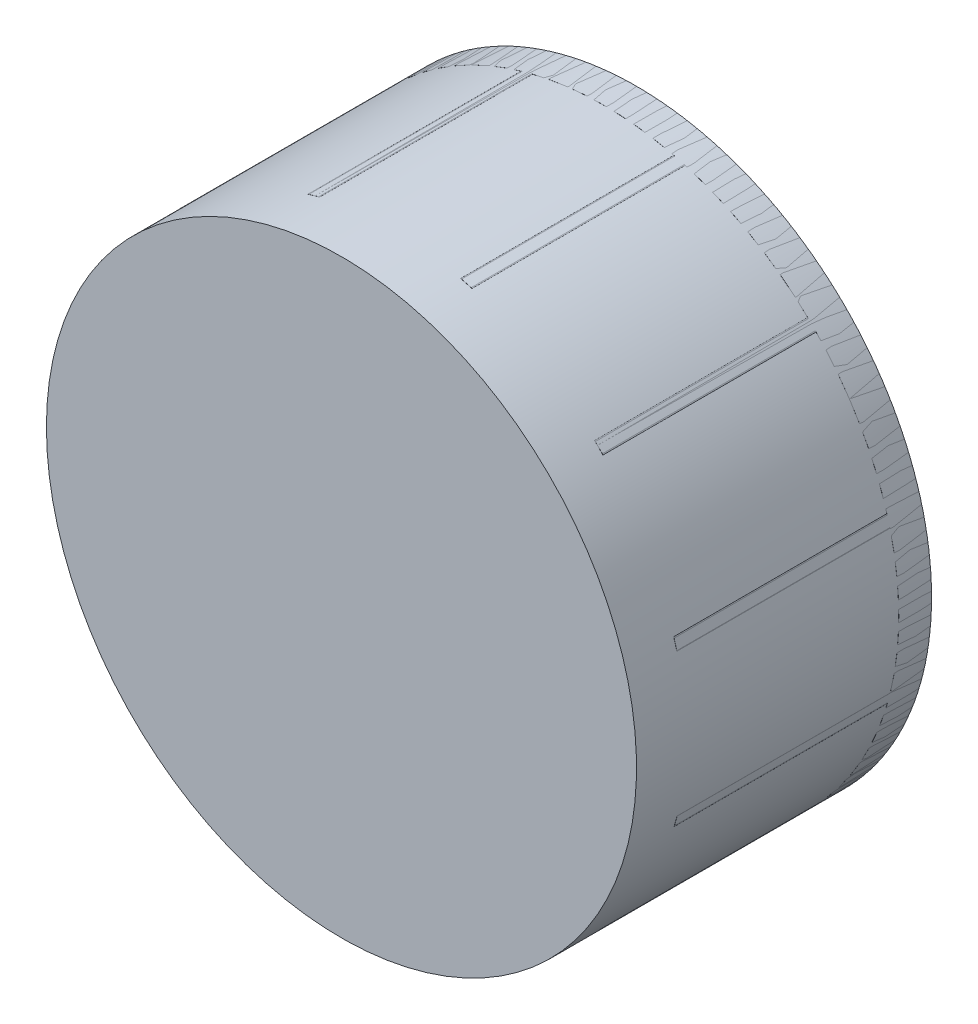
ISO-10303-21;
HEADER;
FILE_DESCRIPTION(('STEP AP214'),'2;1');
FILE_NAME('part.step','',(''),(''),'','','');
FILE_SCHEMA(('AUTOMOTIVE_DESIGN { 1 0 10303 214 1 1 1 1 }'));
ENDSEC;
DATA;
#1=APPLICATION_CONTEXT('core data for automotive mechanical design processes');
#2=APPLICATION_PROTOCOL_DEFINITION('international standard','automotive_design',2000,#1);
#3=PRODUCT_CONTEXT('',#1,'mechanical');
#4=PRODUCT('Part','Part','',(#3));
#5=PRODUCT_RELATED_PRODUCT_CATEGORY('part','',(#4));
#6=PRODUCT_DEFINITION_FORMATION('','',#4);
#7=PRODUCT_DEFINITION_CONTEXT('part definition',#1,'design');
#8=PRODUCT_DEFINITION('design','',#6,#7);
#9=PRODUCT_DEFINITION_SHAPE('','',#8);
#10=(LENGTH_UNIT() NAMED_UNIT(*) SI_UNIT(.MILLI.,.METRE.));
#11=(NAMED_UNIT(*) PLANE_ANGLE_UNIT() SI_UNIT($,.RADIAN.));
#12=(NAMED_UNIT(*) SI_UNIT($,.STERADIAN.) SOLID_ANGLE_UNIT());
#13=UNCERTAINTY_MEASURE_WITH_UNIT(LENGTH_MEASURE(1.E-05),#10,'distance_accuracy_value','');
#14=(GEOMETRIC_REPRESENTATION_CONTEXT(3) GLOBAL_UNCERTAINTY_ASSIGNED_CONTEXT((#13)) GLOBAL_UNIT_ASSIGNED_CONTEXT((#10,
#11,#12)) REPRESENTATION_CONTEXT('',''));
#15=CARTESIAN_POINT('',(0.,0.,0.));
#16=DIRECTION('',(0.,0.,1.));
#17=DIRECTION('',(1.,0.,0.));
#18=AXIS2_PLACEMENT_3D('',#15,#16,#17);
#19=CARTESIAN_POINT('',(0.,0.,16.));
#20=DIRECTION('',(0.,0.,-1.));
#21=DIRECTION('',(-1.,0.,0.));
#22=AXIS2_PLACEMENT_3D('',#19,#20,#21);
#23=CYLINDRICAL_SURFACE('',#22,18.);
#24=CARTESIAN_POINT('',(0.,0.,16.));
#25=DIRECTION('',(0.,0.,-1.));
#26=DIRECTION('',(-1.,0.,0.));
#27=AXIS2_PLACEMENT_3D('',#24,#25,#26);
#28=CIRCLE('',#27,18.);
#29=CARTESIAN_POINT('',(-18.,0.,16.));
#30=VERTEX_POINT('',#29);
#31=EDGE_CURVE('E11',#30,#30,#28,.T.);
#32=ORIENTED_EDGE('',*,*,#31,.T.);
#33=EDGE_LOOP('',(#32));
#34=FACE_BOUND('',#33,.T.);
#35=CARTESIAN_POINT('',(0.,0.,-2.));
#36=DIRECTION('',(0.,0.,-1.));
#37=DIRECTION('',(-1.,0.,0.));
#38=AXIS2_PLACEMENT_3D('',#35,#36,#37);
#39=CIRCLE('',#38,18.);
#40=CARTESIAN_POINT('',(-18.,0.,-2.));
#41=VERTEX_POINT('',#40);
#42=EDGE_CURVE('E62',#41,#41,#39,.T.);
#43=ORIENTED_EDGE('',*,*,#42,.F.);
#44=EDGE_LOOP('',(#43));
#45=FACE_BOUND('',#44,.T.);
#46=ADVANCED_FACE('F59',(#34,#45),#23,.T.);
#47=CARTESIAN_POINT('',(0.,0.,16.));
#48=DIRECTION('',(0.,0.,-1.));
#49=DIRECTION('',(-1.,0.,0.));
#50=AXIS2_PLACEMENT_3D('',#47,#48,#49);
#51=PLANE('',#50);
#52=ORIENTED_EDGE('',*,*,#31,.F.);
#53=EDGE_LOOP('',(#52));
#54=FACE_BOUND('',#53,.T.);
#55=ADVANCED_FACE('F76',(#54),#51,.F.);
#56=CARTESIAN_POINT('',(0.,0.,-2.));
#57=DIRECTION('',(0.,0.,-1.));
#58=DIRECTION('',(-1.,0.,0.));
#59=AXIS2_PLACEMENT_3D('',#56,#57,#58);
#60=PLANE('',#59);
#61=ORIENTED_EDGE('',*,*,#42,.T.);
#62=EDGE_LOOP('',(#61));
#63=FACE_BOUND('',#62,.T.);
#64=ADVANCED_FACE('F73',(#63),#60,.T.);
#65=CLOSED_SHELL('',(#46,#55,#64));
#66=MANIFOLD_SOLID_BREP('B2_NOT_SHOWN',#65);
#67=CARTESIAN_POINT('',(0.,0.,0.));
#68=DIRECTION('',(0.,0.,1.));
#69=DIRECTION('',(1.,0.,0.));
#70=AXIS2_PLACEMENT_3D('',#67,#68,#69);
#71=PLANE('',#70);
#72=CARTESIAN_POINT('',(0.,0.,0.));
#73=DIRECTION('',(0.,0.,1.));
#74=DIRECTION('',(1.,0.,0.));
#75=AXIS2_PLACEMENT_3D('',#72,#73,#74);
#76=CIRCLE('',#75,3.);
#77=CARTESIAN_POINT('',(3.,0.,0.));
#78=VERTEX_POINT('',#77);
#79=EDGE_CURVE('E788',#78,#78,#76,.F.);
#80=ORIENTED_EDGE('',*,*,#79,.T.);
#81=EDGE_LOOP('',(#80));
#82=FACE_BOUND('',#81,.T.);
#83=CARTESIAN_POINT('',(0.,0.,0.));
#84=DIRECTION('',(0.,0.,1.));
#85=DIRECTION('',(1.,0.,0.));
#86=AXIS2_PLACEMENT_3D('',#83,#84,#85);
#87=CIRCLE('',#86,18.);
#88=CARTESIAN_POINT('',(12.4831508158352,12.9680740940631,0.));
#89=VERTEX_POINT('',#88);
#90=CARTESIAN_POINT('',(4.91309947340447,17.3165081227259,0.));
#91=VERTEX_POINT('',#90);
#92=EDGE_CURVE('E144',#89,#91,#87,.T.);
#93=ORIENTED_EDGE('',*,*,#92,.T.);
#94=CARTESIAN_POINT('',(4.85850947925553,17.1241024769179,0.));
#95=DIRECTION('',(0.,0.,1.));
#96=DIRECTION('',(1.,0.,0.));
#97=AXIS2_PLACEMENT_3D('',#94,#95,#96);
#98=CIRCLE('',#97,0.2);
#99=CARTESIAN_POINT('',(5.05180785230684,17.0727630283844,0.));
#100=VERTEX_POINT('',#99);
#101=EDGE_CURVE('E137',#91,#100,#98,.F.);
#102=ORIENTED_EDGE('',*,*,#101,.T.);
#103=DIRECTION('',(0.256697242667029,0.966491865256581,0.));
#104=VECTOR('',#103,1.);
#105=CARTESIAN_POINT('',(2.53901032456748,7.61181851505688,0.));
#106=LINE('',#105,#104);
#107=CARTESIAN_POINT('',(2.59034977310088,7.80511688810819,0.));
#108=VERTEX_POINT('',#107);
#109=EDGE_CURVE('E1409',#108,#100,#106,.T.);
#110=ORIENTED_EDGE('',*,*,#109,.F.);
#111=CARTESIAN_POINT('',(2.39705140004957,7.8564563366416,0.));
#112=DIRECTION('',(0.,0.,1.));
#113=DIRECTION('',(1.,0.,0.));
#114=AXIS2_PLACEMENT_3D('',#111,#112,#113);
#115=CIRCLE('',#114,0.2);
#116=CARTESIAN_POINT('',(2.34571195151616,7.66315796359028,0.));
#117=VERTEX_POINT('',#116);
#118=EDGE_CURVE('E1404',#108,#117,#115,.F.);
#119=ORIENTED_EDGE('',*,*,#118,.T.);
#120=DIRECTION('',(0.966491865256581,-0.256697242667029,0.));
#121=VECTOR('',#120,1.);
#122=CARTESIAN_POINT('',(1.5725184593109,7.86851575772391,0.));
#123=LINE('',#122,#121);
#124=CARTESIAN_POINT('',(1.76581683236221,7.8171763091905,0.));
#125=VERTEX_POINT('',#124);
#126=EDGE_CURVE('E1420',#125,#117,#123,.T.);
#127=ORIENTED_EDGE('',*,*,#126,.F.);
#128=CARTESIAN_POINT('',(1.81715628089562,8.01047468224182,0.));
#129=DIRECTION('',(0.,0.,1.));
#130=DIRECTION('',(1.,0.,0.));
#131=AXIS2_PLACEMENT_3D('',#128,#129,#130);
#132=CIRCLE('',#131,0.2);
#133=CARTESIAN_POINT('',(1.6238579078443,8.06181413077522,0.));
#134=VERTEX_POINT('',#133);
#135=EDGE_CURVE('E1401',#125,#134,#132,.F.);
#136=ORIENTED_EDGE('',*,*,#135,.T.);
#137=DIRECTION('',(-0.25669724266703,-0.96649186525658,0.));
#138=VECTOR('',#137,1.);
#139=CARTESIAN_POINT('',(1.5725184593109,7.86851575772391,0.));
#140=LINE('',#139,#138);
#141=CARTESIAN_POINT('',(4.08531598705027,17.3294602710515,0.));
#142=VERTEX_POINT('',#141);
#143=EDGE_CURVE('E1419',#142,#134,#140,.T.);
#144=ORIENTED_EDGE('',*,*,#143,.F.);
#145=CARTESIAN_POINT('',(4.27861436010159,17.2781208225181,0.));
#146=DIRECTION('',(0.,0.,1.));
#147=DIRECTION('',(1.,0.,0.));
#148=AXIS2_PLACEMENT_3D('',#145,#146,#147);
#149=CIRCLE('',#148,0.2);
#150=CARTESIAN_POINT('',(4.32668867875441,17.4722570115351,0.));
#151=VERTEX_POINT('',#150);
#152=EDGE_CURVE('E57',#142,#151,#149,.F.);
#153=ORIENTED_EDGE('',*,*,#152,.T.);
#154=CARTESIAN_POINT('',(-4.40338510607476,17.4530856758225,0.));
#155=VERTEX_POINT('',#154);
#156=EDGE_CURVE('E152',#151,#155,#87,.T.);
#157=ORIENTED_EDGE('',*,*,#156,.T.);
#158=CARTESIAN_POINT('',(-4.35445860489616,17.2591625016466,0.));
#159=DIRECTION('',(0.,0.,1.));
#160=DIRECTION('',(1.,0.,0.));
#161=AXIS2_PLACEMENT_3D('',#158,#159,#160);
#162=CIRCLE('',#161,0.2);
#163=CARTESIAN_POINT('',(-4.16138757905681,17.3113504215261,0.));
#164=VERTEX_POINT('',#163);
#165=EDGE_CURVE('E1354',#155,#164,#162,.F.);
#166=ORIENTED_EDGE('',*,*,#165,.T.);
#167=DIRECTION('',(-0.260939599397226,0.96535512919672,0.));
#168=VECTOR('',#167,1.);
#169=CARTESIAN_POINT('',(-1.60706181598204,7.86153336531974,0.));
#170=LINE('',#169,#168);
#171=CARTESIAN_POINT('',(-1.65924973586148,8.05460439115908,0.));
#172=VERTEX_POINT('',#171);
#173=EDGE_CURVE('E1472',#172,#164,#170,.T.);
#174=ORIENTED_EDGE('',*,*,#173,.F.);
#175=CARTESIAN_POINT('',(-1.85232076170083,8.00241647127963,0.));
#176=DIRECTION('',(0.,0.,1.));
#177=DIRECTION('',(1.,0.,0.));
#178=AXIS2_PLACEMENT_3D('',#175,#176,#177);
#179=CIRCLE('',#178,0.2);
#180=CARTESIAN_POINT('',(-1.80013284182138,7.80934544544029,0.));
#181=VERTEX_POINT('',#180);
#182=EDGE_CURVE('E1351',#172,#181,#179,.F.);
#183=ORIENTED_EDGE('',*,*,#182,.T.);
#184=DIRECTION('',(0.96535512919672,0.260939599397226,0.));
#185=VECTOR('',#184,1.);
#186=CARTESIAN_POINT('',(-2.57241694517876,7.60059376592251,0.));
#187=LINE('',#186,#185);
#188=CARTESIAN_POINT('',(-2.37934591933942,7.65278168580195,0.));
#189=VERTEX_POINT('',#188);
#190=EDGE_CURVE('E1439',#189,#181,#187,.T.);
#191=ORIENTED_EDGE('',*,*,#190,.F.);
#192=CARTESIAN_POINT('',(-2.43153383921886,7.8458527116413,0.));
#193=DIRECTION('',(0.,0.,1.));
#194=DIRECTION('',(1.,0.,0.));
#195=AXIS2_PLACEMENT_3D('',#192,#193,#194);
#196=CIRCLE('',#195,0.2);
#197=CARTESIAN_POINT('',(-2.6246048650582,7.79366479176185,0.));
#198=VERTEX_POINT('',#197);
#199=EDGE_CURVE('E1348',#189,#198,#196,.F.);
#200=ORIENTED_EDGE('',*,*,#199,.T.);
#201=DIRECTION('',(0.260939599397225,-0.96535512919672,0.));
#202=VECTOR('',#201,1.);
#203=CARTESIAN_POINT('',(-2.57241694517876,7.60059376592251,0.));
#204=LINE('',#203,#202);
#205=CARTESIAN_POINT('',(-5.12674270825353,17.0504108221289,0.));
#206=VERTEX_POINT('',#205);
#207=EDGE_CURVE('E1456',#206,#198,#204,.T.);
#208=ORIENTED_EDGE('',*,*,#207,.F.);
#209=CARTESIAN_POINT('',(-4.93367168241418,17.1025987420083,0.));
#210=DIRECTION('',(0.,0.,1.));
#211=DIRECTION('',(1.,0.,0.));
#212=AXIS2_PLACEMENT_3D('',#209,#210,#211);
#213=CIRCLE('',#212,0.2);
#214=CARTESIAN_POINT('',(-4.98910619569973,17.2947627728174,0.));
#215=VERTEX_POINT('',#214);
#216=EDGE_CURVE('E1357',#206,#215,#213,.F.);
#217=ORIENTED_EDGE('',*,*,#216,.T.);
#218=CARTESIAN_POINT('',(-12.539986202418,12.9131230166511,0.));
#219=VERTEX_POINT('',#218);
#220=EDGE_CURVE('E2177',#215,#219,#87,.T.);
#221=ORIENTED_EDGE('',*,*,#220,.T.);
#222=CARTESIAN_POINT('',(-12.4006530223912,12.7696438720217,0.));
#223=DIRECTION('',(0.,0.,1.));
#224=DIRECTION('',(1.,0.,0.));
#225=AXIS2_PLACEMENT_3D('',#222,#223,#224);
#226=CIRCLE('',#225,0.2);
#227=CARTESIAN_POINT('',(-12.2595425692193,12.9113754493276,0.));
#228=VERTEX_POINT('',#227);
#229=EDGE_CURVE('E1302',#219,#228,#226,.F.);
#230=ORIENTED_EDGE('',*,*,#229,.T.);
#231=DIRECTION('',(-0.708657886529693,0.705552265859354,0.));
#232=VECTOR('',#231,1.);
#233=CARTESIAN_POINT('',(-5.32252304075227,6.00475669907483,0.));
#234=LINE('',#233,#232);
#235=CARTESIAN_POINT('',(-5.46425461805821,6.14586715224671,0.));
#236=VERTEX_POINT('',#235);
#237=EDGE_CURVE('E1500',#236,#228,#234,.T.);
#238=ORIENTED_EDGE('',*,*,#237,.F.);
#239=CARTESIAN_POINT('',(-5.60536507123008,6.00413557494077,0.));
#240=DIRECTION('',(0.,0.,1.));
#241=DIRECTION('',(1.,0.,0.));
#242=AXIS2_PLACEMENT_3D('',#239,#240,#241);
#243=CIRCLE('',#242,0.2);
#244=CARTESIAN_POINT('',(-5.46363349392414,5.8630251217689,0.));
#245=VERTEX_POINT('',#244);
#246=EDGE_CURVE('E1299',#236,#245,#243,.F.);
#247=ORIENTED_EDGE('',*,*,#246,.T.);
#248=DIRECTION('',(0.705552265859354,0.708657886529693,0.));
#249=VECTOR('',#248,1.);
#250=CARTESIAN_POINT('',(-6.02807530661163,5.29609881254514,0.));
#251=LINE('',#250,#249);
#252=CARTESIAN_POINT('',(-5.88696485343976,5.43783038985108,0.));
#253=VERTEX_POINT('',#252);
#254=EDGE_CURVE('E1468',#253,#245,#251,.T.);
#255=ORIENTED_EDGE('',*,*,#254,.F.);
#256=CARTESIAN_POINT('',(-6.02869643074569,5.57894084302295,0.));
#257=DIRECTION('',(0.,0.,1.));
#258=DIRECTION('',(1.,0.,0.));
#259=AXIS2_PLACEMENT_3D('',#256,#257,#258);
#260=CIRCLE('',#259,0.2);
#261=CARTESIAN_POINT('',(-6.16980688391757,5.43720926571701,0.));
#262=VERTEX_POINT('',#261);
#263=EDGE_CURVE('E1296',#253,#262,#260,.F.);
#264=ORIENTED_EDGE('',*,*,#263,.T.);
#265=DIRECTION('',(0.708657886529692,-0.705552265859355,0.));
#266=VECTOR('',#265,1.);
#267=CARTESIAN_POINT('',(-6.02807530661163,5.29609881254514,0.));
#268=LINE('',#267,#266);
#269=CARTESIAN_POINT('',(-12.9650948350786,12.2027175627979,0.));
#270=VERTEX_POINT('',#269);
#271=EDGE_CURVE('E1484',#270,#262,#268,.T.);
#272=ORIENTED_EDGE('',*,*,#271,.F.);
#273=CARTESIAN_POINT('',(-12.8239843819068,12.3444491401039,0.));
#274=DIRECTION('',(0.,0.,1.));
#275=DIRECTION('',(1.,0.,0.));
#276=AXIS2_PLACEMENT_3D('',#273,#274,#275);
#277=CIRCLE('',#276,0.2);
#278=CARTESIAN_POINT('',(-12.968074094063,12.4831508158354,0.));
#279=VERTEX_POINT('',#278);
#280=EDGE_CURVE('E1305',#270,#279,#277,.F.);
#281=ORIENTED_EDGE('',*,*,#280,.T.);
#282=CARTESIAN_POINT('',(-17.3165081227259,4.9130994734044,0.));
#283=VERTEX_POINT('',#282);
#284=EDGE_CURVE('E2199',#279,#283,#87,.T.);
#285=ORIENTED_EDGE('',*,*,#284,.T.);
#286=CARTESIAN_POINT('',(-17.1241024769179,4.85850947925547,0.));
#287=DIRECTION('',(0.,0.,1.));
#288=DIRECTION('',(1.,0.,0.));
#289=AXIS2_PLACEMENT_3D('',#286,#287,#288);
#290=CIRCLE('',#289,0.2);
#291=CARTESIAN_POINT('',(-17.0727630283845,5.05180785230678,0.));
#292=VERTEX_POINT('',#291);
#293=EDGE_CURVE('E1249',#283,#292,#290,.F.);
#294=ORIENTED_EDGE('',*,*,#293,.T.);
#295=DIRECTION('',(-0.966491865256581,0.256697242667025,0.));
#296=VECTOR('',#295,1.);
#297=CARTESIAN_POINT('',(-7.61181851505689,2.53901032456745,0.));
#298=LINE('',#297,#296);
#299=CARTESIAN_POINT('',(-7.8051168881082,2.59034977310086,0.));
#300=VERTEX_POINT('',#299);
#301=EDGE_CURVE('E1528',#300,#292,#298,.T.);
#302=ORIENTED_EDGE('',*,*,#301,.F.);
#303=CARTESIAN_POINT('',(-7.85645633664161,2.39705140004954,0.));
#304=DIRECTION('',(0.,0.,1.));
#305=DIRECTION('',(1.,0.,0.));
#306=AXIS2_PLACEMENT_3D('',#303,#304,#305);
#307=CIRCLE('',#306,0.2);
#308=CARTESIAN_POINT('',(-7.66315796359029,2.34571195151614,0.));
#309=VERTEX_POINT('',#308);
#310=EDGE_CURVE('E1246',#300,#309,#307,.F.);
#311=ORIENTED_EDGE('',*,*,#310,.T.);
#312=DIRECTION('',(0.256697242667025,0.966491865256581,0.));
#313=VECTOR('',#312,1.);
#314=CARTESIAN_POINT('',(-7.86851575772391,1.57251845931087,0.));
#315=LINE('',#314,#313);
#316=CARTESIAN_POINT('',(-7.81717630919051,1.76581683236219,0.));
#317=VERTEX_POINT('',#316);
#318=EDGE_CURVE('E1496',#317,#309,#315,.T.);
#319=ORIENTED_EDGE('',*,*,#318,.F.);
#320=CARTESIAN_POINT('',(-8.01047468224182,1.81715628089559,0.));
#321=DIRECTION('',(0.,0.,1.));
#322=DIRECTION('',(1.,0.,0.));
#323=AXIS2_PLACEMENT_3D('',#320,#321,#322);
#324=CIRCLE('',#323,0.2);
#325=CARTESIAN_POINT('',(-8.06181413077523,1.62385790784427,0.));
#326=VERTEX_POINT('',#325);
#327=EDGE_CURVE('E1243',#317,#326,#324,.F.);
#328=ORIENTED_EDGE('',*,*,#327,.T.);
#329=DIRECTION('',(0.966491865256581,-0.256697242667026,0.));
#330=VECTOR('',#329,1.);
#331=CARTESIAN_POINT('',(-7.86851575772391,1.57251845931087,0.));
#332=LINE('',#331,#330);
#333=CARTESIAN_POINT('',(-17.3294602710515,4.08531598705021,0.));
#334=VERTEX_POINT('',#333);
#335=EDGE_CURVE('E1512',#334,#326,#332,.T.);
#336=ORIENTED_EDGE('',*,*,#335,.F.);
#337=CARTESIAN_POINT('',(-17.2781208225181,4.27861436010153,0.));
#338=DIRECTION('',(0.,0.,1.));
#339=DIRECTION('',(1.,0.,0.));
#340=AXIS2_PLACEMENT_3D('',#337,#338,#339);
#341=CIRCLE('',#340,0.2);
#342=CARTESIAN_POINT('',(-17.4722570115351,4.32668867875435,0.));
#343=VERTEX_POINT('',#342);
#344=EDGE_CURVE('E1252',#334,#343,#341,.F.);
#345=ORIENTED_EDGE('',*,*,#344,.T.);
#346=CARTESIAN_POINT('',(-17.4530856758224,-4.40338510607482,0.));
#347=VERTEX_POINT('',#346);
#348=EDGE_CURVE('E2221',#343,#347,#87,.T.);
#349=ORIENTED_EDGE('',*,*,#348,.T.);
#350=CARTESIAN_POINT('',(-17.2591625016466,-4.35445860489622,0.));
#351=DIRECTION('',(0.,0.,1.));
#352=DIRECTION('',(1.,0.,0.));
#353=AXIS2_PLACEMENT_3D('',#350,#351,#352);
#354=CIRCLE('',#353,0.2);
#355=CARTESIAN_POINT('',(-17.3113504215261,-4.16138757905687,0.));
#356=VERTEX_POINT('',#355);
#357=EDGE_CURVE('E1196',#347,#356,#354,.F.);
#358=ORIENTED_EDGE('',*,*,#357,.T.);
#359=DIRECTION('',(-0.965355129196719,-0.260939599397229,0.));
#360=VECTOR('',#359,1.);
#361=CARTESIAN_POINT('',(-7.86153336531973,-1.60706181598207,0.));
#362=LINE('',#361,#360);
#363=CARTESIAN_POINT('',(-8.05460439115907,-1.65924973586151,0.));
#364=VERTEX_POINT('',#363);
#365=EDGE_CURVE('E1556',#364,#356,#362,.T.);
#366=ORIENTED_EDGE('',*,*,#365,.F.);
#367=CARTESIAN_POINT('',(-8.00241647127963,-1.85232076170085,0.));
#368=DIRECTION('',(0.,0.,1.));
#369=DIRECTION('',(1.,0.,0.));
#370=AXIS2_PLACEMENT_3D('',#367,#368,#369);
#371=CIRCLE('',#370,0.2);
#372=CARTESIAN_POINT('',(-7.80934544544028,-1.80013284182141,0.));
#373=VERTEX_POINT('',#372);
#374=EDGE_CURVE('E1193',#364,#373,#371,.F.);
#375=ORIENTED_EDGE('',*,*,#374,.T.);
#376=DIRECTION('',(-0.260939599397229,0.965355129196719,0.));
#377=VECTOR('',#376,1.);
#378=CARTESIAN_POINT('',(-7.6005937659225,-2.57241694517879,0.));
#379=LINE('',#378,#377);
#380=CARTESIAN_POINT('',(-7.65278168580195,-2.37934591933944,0.));
#381=VERTEX_POINT('',#380);
#382=EDGE_CURVE('E1524',#381,#373,#379,.T.);
#383=ORIENTED_EDGE('',*,*,#382,.F.);
#384=CARTESIAN_POINT('',(-7.84585271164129,-2.43153383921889,0.));
#385=DIRECTION('',(0.,0.,1.));
#386=DIRECTION('',(1.,0.,0.));
#387=AXIS2_PLACEMENT_3D('',#384,#385,#386);
#388=CIRCLE('',#387,0.2);
#389=CARTESIAN_POINT('',(-7.79366479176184,-2.62460486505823,0.));
#390=VERTEX_POINT('',#389);
#391=EDGE_CURVE('E1190',#381,#390,#388,.F.);
#392=ORIENTED_EDGE('',*,*,#391,.T.);
#393=DIRECTION('',(0.965355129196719,0.260939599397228,0.));
#394=VECTOR('',#393,1.);
#395=CARTESIAN_POINT('',(-7.6005937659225,-2.57241694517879,0.));
#396=LINE('',#395,#394);
#397=CARTESIAN_POINT('',(-17.0504108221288,-5.12674270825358,0.));
#398=VERTEX_POINT('',#397);
#399=EDGE_CURVE('E1540',#398,#390,#396,.T.);
#400=ORIENTED_EDGE('',*,*,#399,.F.);
#401=CARTESIAN_POINT('',(-17.1025987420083,-4.93367168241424,0.));
#402=DIRECTION('',(0.,0.,1.));
#403=DIRECTION('',(1.,0.,0.));
#404=AXIS2_PLACEMENT_3D('',#401,#402,#403);
#405=CIRCLE('',#404,0.2);
#406=CARTESIAN_POINT('',(-17.2947627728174,-4.98910619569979,0.));
#407=VERTEX_POINT('',#406);
#408=EDGE_CURVE('E1199',#398,#407,#405,.F.);
#409=ORIENTED_EDGE('',*,*,#408,.T.);
#410=CARTESIAN_POINT('',(-12.913123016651,-12.5399862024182,0.));
#411=VERTEX_POINT('',#410);
#412=EDGE_CURVE('E2243',#407,#411,#87,.T.);
#413=ORIENTED_EDGE('',*,*,#412,.T.);
#414=CARTESIAN_POINT('',(-12.7696438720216,-12.4006530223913,0.));
#415=DIRECTION('',(0.,0.,1.));
#416=DIRECTION('',(1.,0.,0.));
#417=AXIS2_PLACEMENT_3D('',#414,#415,#416);
#418=CIRCLE('',#417,0.2);
#419=CARTESIAN_POINT('',(-12.9113754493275,-12.2595425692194,0.));
#420=VERTEX_POINT('',#419);
#421=EDGE_CURVE('E1143',#411,#420,#418,.F.);
#422=ORIENTED_EDGE('',*,*,#421,.T.);
#423=DIRECTION('',(-0.705552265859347,-0.7086578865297,0.));
#424=VECTOR('',#423,1.);
#425=CARTESIAN_POINT('',(-6.00475669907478,-5.32252304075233,0.));
#426=LINE('',#425,#424);
#427=CARTESIAN_POINT('',(-6.14586715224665,-5.46425461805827,0.));
#428=VERTEX_POINT('',#427);
#429=EDGE_CURVE('E1584',#428,#420,#426,.T.);
#430=ORIENTED_EDGE('',*,*,#429,.F.);
#431=CARTESIAN_POINT('',(-6.00413557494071,-5.60536507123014,0.));
#432=DIRECTION('',(0.,0.,1.));
#433=DIRECTION('',(1.,0.,0.));
#434=AXIS2_PLACEMENT_3D('',#431,#432,#433);
#435=CIRCLE('',#434,0.2);
#436=CARTESIAN_POINT('',(-5.86302512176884,-5.4636334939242,0.));
#437=VERTEX_POINT('',#436);
#438=EDGE_CURVE('E1140',#428,#437,#435,.F.);
#439=ORIENTED_EDGE('',*,*,#438,.T.);
#440=DIRECTION('',(-0.7086578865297,0.705552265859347,0.));
#441=VECTOR('',#440,1.);
#442=CARTESIAN_POINT('',(-5.29609881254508,-6.02807530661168,0.));
#443=LINE('',#442,#441);
#444=CARTESIAN_POINT('',(-5.43783038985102,-5.88696485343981,0.));
#445=VERTEX_POINT('',#444);
#446=EDGE_CURVE('E1552',#445,#437,#443,.T.);
#447=ORIENTED_EDGE('',*,*,#446,.F.);
#448=CARTESIAN_POINT('',(-5.57894084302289,-6.02869643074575,0.));
#449=DIRECTION('',(0.,0.,1.));
#450=DIRECTION('',(1.,0.,0.));
#451=AXIS2_PLACEMENT_3D('',#448,#449,#450);
#452=CIRCLE('',#451,0.2);
#453=CARTESIAN_POINT('',(-5.43720926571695,-6.16980688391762,0.));
#454=VERTEX_POINT('',#453);
#455=EDGE_CURVE('E1137',#445,#454,#452,.F.);
#456=ORIENTED_EDGE('',*,*,#455,.T.);
#457=DIRECTION('',(0.705552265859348,0.7086578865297,0.));
#458=VECTOR('',#457,1.);
#459=CARTESIAN_POINT('',(-5.29609881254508,-6.02807530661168,0.));
#460=LINE('',#459,#458);
#461=CARTESIAN_POINT('',(-12.2027175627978,-12.9650948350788,0.));
#462=VERTEX_POINT('',#461);
#463=EDGE_CURVE('E1568',#462,#454,#460,.T.);
#464=ORIENTED_EDGE('',*,*,#463,.F.);
#465=CARTESIAN_POINT('',(-12.3444491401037,-12.8239843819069,0.));
#466=DIRECTION('',(0.,0.,1.));
#467=DIRECTION('',(1.,0.,0.));
#468=AXIS2_PLACEMENT_3D('',#465,#466,#467);
#469=CIRCLE('',#468,0.2);
#470=CARTESIAN_POINT('',(-12.4831508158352,-12.9680740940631,0.));
#471=VERTEX_POINT('',#470);
#472=EDGE_CURVE('E1146',#462,#471,#469,.F.);
#473=ORIENTED_EDGE('',*,*,#472,.T.);
#474=CARTESIAN_POINT('',(-4.91309947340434,-17.316508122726,0.));
#475=VERTEX_POINT('',#474);
#476=EDGE_CURVE('E2265',#471,#475,#87,.T.);
#477=ORIENTED_EDGE('',*,*,#476,.T.);
#478=CARTESIAN_POINT('',(-4.85850947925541,-17.1241024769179,0.));
#479=DIRECTION('',(0.,0.,1.));
#480=DIRECTION('',(1.,0.,0.));
#481=AXIS2_PLACEMENT_3D('',#478,#479,#480);
#482=CIRCLE('',#481,0.2);
#483=CARTESIAN_POINT('',(-5.05180785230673,-17.0727630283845,0.));
#484=VERTEX_POINT('',#483);
#485=EDGE_CURVE('E1090',#475,#484,#482,.F.);
#486=ORIENTED_EDGE('',*,*,#485,.T.);
#487=DIRECTION('',(-0.256697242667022,-0.966491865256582,0.));
#488=VECTOR('',#487,1.);
#489=CARTESIAN_POINT('',(-2.53901032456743,-7.61181851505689,0.));
#490=LINE('',#489,#488);
#491=CARTESIAN_POINT('',(-2.59034977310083,-7.80511688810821,0.));
#492=VERTEX_POINT('',#491);
#493=EDGE_CURVE('E1612',#492,#484,#490,.T.);
#494=ORIENTED_EDGE('',*,*,#493,.F.);
#495=CARTESIAN_POINT('',(-2.39705140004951,-7.85645633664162,0.));
#496=DIRECTION('',(0.,0.,1.));
#497=DIRECTION('',(1.,0.,0.));
#498=AXIS2_PLACEMENT_3D('',#495,#496,#497);
#499=CIRCLE('',#498,0.2);
#500=CARTESIAN_POINT('',(-2.34571195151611,-7.6631579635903,0.));
#501=VERTEX_POINT('',#500);
#502=EDGE_CURVE('E1087',#492,#501,#499,.F.);
#503=ORIENTED_EDGE('',*,*,#502,.T.);
#504=DIRECTION('',(-0.966491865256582,0.256697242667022,0.));
#505=VECTOR('',#504,1.);
#506=CARTESIAN_POINT('',(-1.57251845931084,-7.86851575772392,0.));
#507=LINE('',#506,#505);
#508=CARTESIAN_POINT('',(-1.76581683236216,-7.81717630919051,0.));
#509=VERTEX_POINT('',#508);
#510=EDGE_CURVE('E1580',#509,#501,#507,.T.);
#511=ORIENTED_EDGE('',*,*,#510,.F.);
#512=CARTESIAN_POINT('',(-1.81715628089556,-8.01047468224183,0.));
#513=DIRECTION('',(0.,0.,1.));
#514=DIRECTION('',(1.,0.,0.));
#515=AXIS2_PLACEMENT_3D('',#512,#513,#514);
#516=CIRCLE('',#515,0.2);
#517=CARTESIAN_POINT('',(-1.62385790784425,-8.06181413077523,0.));
#518=VERTEX_POINT('',#517);
#519=EDGE_CURVE('E1084',#509,#518,#516,.F.);
#520=ORIENTED_EDGE('',*,*,#519,.T.);
#521=DIRECTION('',(0.256697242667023,0.966491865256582,0.));
#522=VECTOR('',#521,1.);
#523=CARTESIAN_POINT('',(-1.57251845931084,-7.86851575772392,0.));
#524=LINE('',#523,#522);
#525=CARTESIAN_POINT('',(-4.08531598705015,-17.3294602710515,0.));
#526=VERTEX_POINT('',#525);
#527=EDGE_CURVE('E1596',#526,#518,#524,.T.);
#528=ORIENTED_EDGE('',*,*,#527,.F.);
#529=CARTESIAN_POINT('',(-4.27861436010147,-17.2781208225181,0.));
#530=DIRECTION('',(0.,0.,1.));
#531=DIRECTION('',(1.,0.,0.));
#532=AXIS2_PLACEMENT_3D('',#529,#530,#531);
#533=CIRCLE('',#532,0.2);
#534=CARTESIAN_POINT('',(-4.32668867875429,-17.4722570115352,0.));
#535=VERTEX_POINT('',#534);
#536=EDGE_CURVE('E1093',#526,#535,#533,.F.);
#537=ORIENTED_EDGE('',*,*,#536,.T.);
#538=CARTESIAN_POINT('',(4.40338510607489,-17.4530856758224,0.));
#539=VERTEX_POINT('',#538);
#540=EDGE_CURVE('E2287',#535,#539,#87,.T.);
#541=ORIENTED_EDGE('',*,*,#540,.T.);
#542=CARTESIAN_POINT('',(4.35445860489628,-17.2591625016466,0.));
#543=DIRECTION('',(0.,0.,1.));
#544=DIRECTION('',(1.,0.,0.));
#545=AXIS2_PLACEMENT_3D('',#542,#543,#544);
#546=CIRCLE('',#545,0.2);
#547=CARTESIAN_POINT('',(4.16138757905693,-17.3113504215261,0.));
#548=VERTEX_POINT('',#547);
#549=EDGE_CURVE('E1037',#539,#548,#546,.F.);
#550=ORIENTED_EDGE('',*,*,#549,.T.);
#551=DIRECTION('',(0.260939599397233,-0.965355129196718,0.));
#552=VECTOR('',#551,1.);
#553=CARTESIAN_POINT('',(1.60706181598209,-7.86153336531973,0.));
#554=LINE('',#553,#552);
#555=CARTESIAN_POINT('',(1.65924973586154,-8.05460439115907,0.));
#556=VERTEX_POINT('',#555);
#557=EDGE_CURVE('E1640',#556,#548,#554,.T.);
#558=ORIENTED_EDGE('',*,*,#557,.F.);
#559=CARTESIAN_POINT('',(1.85232076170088,-8.00241647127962,0.));
#560=DIRECTION('',(0.,0.,1.));
#561=DIRECTION('',(1.,0.,0.));
#562=AXIS2_PLACEMENT_3D('',#559,#560,#561);
#563=CIRCLE('',#562,0.2);
#564=CARTESIAN_POINT('',(1.80013284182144,-7.80934544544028,0.));
#565=VERTEX_POINT('',#564);
#566=EDGE_CURVE('E1034',#556,#565,#563,.F.);
#567=ORIENTED_EDGE('',*,*,#566,.T.);
#568=DIRECTION('',(-0.965355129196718,-0.260939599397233,0.));
#569=VECTOR('',#568,1.);
#570=CARTESIAN_POINT('',(2.57241694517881,-7.60059376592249,0.));
#571=LINE('',#570,#569);
#572=CARTESIAN_POINT('',(2.37934591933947,-7.65278168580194,0.));
#573=VERTEX_POINT('',#572);
#574=EDGE_CURVE('E1608',#573,#565,#571,.T.);
#575=ORIENTED_EDGE('',*,*,#574,.F.);
#576=CARTESIAN_POINT('',(2.43153383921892,-7.84585271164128,0.));
#577=DIRECTION('',(0.,0.,1.));
#578=DIRECTION('',(1.,0.,0.));
#579=AXIS2_PLACEMENT_3D('',#576,#577,#578);
#580=CIRCLE('',#579,0.2);
#581=CARTESIAN_POINT('',(2.62460486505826,-7.79366479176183,0.));
#582=VERTEX_POINT('',#581);
#583=EDGE_CURVE('E1031',#573,#582,#580,.F.);
#584=ORIENTED_EDGE('',*,*,#583,.T.);
#585=DIRECTION('',(-0.260939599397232,0.965355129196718,0.));
#586=VECTOR('',#585,1.);
#587=CARTESIAN_POINT('',(2.57241694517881,-7.60059376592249,0.));
#588=LINE('',#587,#586);
#589=CARTESIAN_POINT('',(5.12674270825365,-17.0504108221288,0.));
#590=VERTEX_POINT('',#589);
#591=EDGE_CURVE('E1624',#590,#582,#588,.T.);
#592=ORIENTED_EDGE('',*,*,#591,.F.);
#593=CARTESIAN_POINT('',(4.9336716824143,-17.1025987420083,0.));
#594=DIRECTION('',(0.,0.,1.));
#595=DIRECTION('',(1.,0.,0.));
#596=AXIS2_PLACEMENT_3D('',#593,#594,#595);
#597=CIRCLE('',#596,0.2);
#598=CARTESIAN_POINT('',(4.98910619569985,-17.2947627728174,0.));
#599=VERTEX_POINT('',#598);
#600=EDGE_CURVE('E1040',#590,#599,#597,.F.);
#601=ORIENTED_EDGE('',*,*,#600,.T.);
#602=CARTESIAN_POINT('',(12.5399862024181,-12.9131230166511,0.));
#603=VERTEX_POINT('',#602);
#604=EDGE_CURVE('E2309',#599,#603,#87,.T.);
#605=ORIENTED_EDGE('',*,*,#604,.T.);
#606=CARTESIAN_POINT('',(12.4006530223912,-12.7696438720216,0.));
#607=DIRECTION('',(0.,0.,1.));
#608=DIRECTION('',(1.,0.,0.));
#609=AXIS2_PLACEMENT_3D('',#606,#607,#608);
#610=CIRCLE('',#609,0.2);
#611=CARTESIAN_POINT('',(12.2595425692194,-12.9113754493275,0.));
#612=VERTEX_POINT('',#611);
#613=EDGE_CURVE('E984',#603,#612,#610,.F.);
#614=ORIENTED_EDGE('',*,*,#613,.T.);
#615=DIRECTION('',(0.708657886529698,-0.705552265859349,0.));
#616=VECTOR('',#615,1.);
#617=CARTESIAN_POINT('',(5.32252304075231,-6.0047566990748,0.));
#618=LINE('',#617,#616);
#619=CARTESIAN_POINT('',(5.46425461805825,-6.14586715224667,0.));
#620=VERTEX_POINT('',#619);
#621=EDGE_CURVE('E1668',#620,#612,#618,.T.);
#622=ORIENTED_EDGE('',*,*,#621,.F.);
#623=CARTESIAN_POINT('',(5.60536507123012,-6.00413557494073,0.));
#624=DIRECTION('',(0.,0.,1.));
#625=DIRECTION('',(1.,0.,0.));
#626=AXIS2_PLACEMENT_3D('',#623,#624,#625);
#627=CIRCLE('',#626,0.2);
#628=CARTESIAN_POINT('',(5.46363349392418,-5.86302512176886,0.));
#629=VERTEX_POINT('',#628);
#630=EDGE_CURVE('E981',#620,#629,#627,.F.);
#631=ORIENTED_EDGE('',*,*,#630,.T.);
#632=DIRECTION('',(-0.705552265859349,-0.708657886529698,0.));
#633=VECTOR('',#632,1.);
#634=CARTESIAN_POINT('',(6.02807530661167,-5.2960988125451,0.));
#635=LINE('',#634,#633);
#636=CARTESIAN_POINT('',(5.8869648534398,-5.43783038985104,0.));
#637=VERTEX_POINT('',#636);
#638=EDGE_CURVE('E1636',#637,#629,#635,.T.);
#639=ORIENTED_EDGE('',*,*,#638,.F.);
#640=CARTESIAN_POINT('',(6.02869643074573,-5.57894084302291,0.));
#641=DIRECTION('',(0.,0.,1.));
#642=DIRECTION('',(1.,0.,0.));
#643=AXIS2_PLACEMENT_3D('',#640,#641,#642);
#644=CIRCLE('',#643,0.2);
#645=CARTESIAN_POINT('',(6.1698068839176,-5.43720926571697,0.));
#646=VERTEX_POINT('',#645);
#647=EDGE_CURVE('E978',#637,#646,#644,.F.);
#648=ORIENTED_EDGE('',*,*,#647,.T.);
#649=DIRECTION('',(-0.708657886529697,0.70555226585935,0.));
#650=VECTOR('',#649,1.);
#651=CARTESIAN_POINT('',(6.02807530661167,-5.2960988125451,0.));
#652=LINE('',#651,#650);
#653=CARTESIAN_POINT('',(12.9650948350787,-12.2027175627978,0.));
#654=VERTEX_POINT('',#653);
#655=EDGE_CURVE('E1652',#654,#646,#652,.T.);
#656=ORIENTED_EDGE('',*,*,#655,.F.);
#657=CARTESIAN_POINT('',(12.8239843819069,-12.3444491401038,0.));
#658=DIRECTION('',(0.,0.,1.));
#659=DIRECTION('',(1.,0.,0.));
#660=AXIS2_PLACEMENT_3D('',#657,#658,#659);
#661=CIRCLE('',#660,0.2);
#662=CARTESIAN_POINT('',(12.9680740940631,-12.4831508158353,0.));
#663=VERTEX_POINT('',#662);
#664=EDGE_CURVE('E987',#654,#663,#661,.F.);
#665=ORIENTED_EDGE('',*,*,#664,.T.);
#666=CARTESIAN_POINT('',(17.316508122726,-4.91309947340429,0.));
#667=VERTEX_POINT('',#666);
#668=EDGE_CURVE('E2331',#663,#667,#87,.T.);
#669=ORIENTED_EDGE('',*,*,#668,.T.);
#670=CARTESIAN_POINT('',(17.1241024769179,-4.85850947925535,0.));
#671=DIRECTION('',(0.,0.,1.));
#672=DIRECTION('',(1.,0.,0.));
#673=AXIS2_PLACEMENT_3D('',#670,#671,#672);
#674=CIRCLE('',#673,0.2);
#675=CARTESIAN_POINT('',(17.0727630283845,-5.05180785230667,0.));
#676=VERTEX_POINT('',#675);
#677=EDGE_CURVE('E931',#667,#676,#674,.F.);
#678=ORIENTED_EDGE('',*,*,#677,.T.);
#679=DIRECTION('',(0.966491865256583,-0.256697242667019,0.));
#680=VECTOR('',#679,1.);
#681=CARTESIAN_POINT('',(7.6118185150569,-2.5390103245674,0.));
#682=LINE('',#681,#680);
#683=CARTESIAN_POINT('',(7.80511688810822,-2.5903497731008,0.));
#684=VERTEX_POINT('',#683);
#685=EDGE_CURVE('E1696',#684,#676,#682,.T.);
#686=ORIENTED_EDGE('',*,*,#685,.F.);
#687=CARTESIAN_POINT('',(7.85645633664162,-2.39705140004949,0.));
#688=DIRECTION('',(0.,0.,1.));
#689=DIRECTION('',(1.,0.,0.));
#690=AXIS2_PLACEMENT_3D('',#687,#688,#689);
#691=CIRCLE('',#690,0.2);
#692=CARTESIAN_POINT('',(7.66315796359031,-2.34571195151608,0.));
#693=VERTEX_POINT('',#692);
#694=EDGE_CURVE('E928',#684,#693,#691,.F.);
#695=ORIENTED_EDGE('',*,*,#694,.T.);
#696=DIRECTION('',(-0.256697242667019,-0.966491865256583,0.));
#697=VECTOR('',#696,1.);
#698=CARTESIAN_POINT('',(7.86851575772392,-1.57251845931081,0.));
#699=LINE('',#698,#697);
#700=CARTESIAN_POINT('',(7.81717630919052,-1.76581683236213,0.));
#701=VERTEX_POINT('',#700);
#702=EDGE_CURVE('E1664',#701,#693,#699,.T.);
#703=ORIENTED_EDGE('',*,*,#702,.F.);
#704=CARTESIAN_POINT('',(8.01047468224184,-1.81715628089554,0.));
#705=DIRECTION('',(0.,0.,1.));
#706=DIRECTION('',(1.,0.,0.));
#707=AXIS2_PLACEMENT_3D('',#704,#705,#706);
#708=CIRCLE('',#707,0.2);
#709=CARTESIAN_POINT('',(8.06181413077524,-1.62385790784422,0.));
#710=VERTEX_POINT('',#709);
#711=EDGE_CURVE('E925',#701,#710,#708,.F.);
#712=ORIENTED_EDGE('',*,*,#711,.T.);
#713=DIRECTION('',(-0.966491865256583,0.25669724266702,0.));
#714=VECTOR('',#713,1.);
#715=CARTESIAN_POINT('',(7.86851575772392,-1.57251845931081,0.));
#716=LINE('',#715,#714);
#717=CARTESIAN_POINT('',(17.3294602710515,-4.08531598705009,0.));
#718=VERTEX_POINT('',#717);
#719=EDGE_CURVE('E1680',#718,#710,#716,.T.);
#720=ORIENTED_EDGE('',*,*,#719,.F.);
#721=CARTESIAN_POINT('',(17.2781208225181,-4.27861436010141,0.));
#722=DIRECTION('',(0.,0.,1.));
#723=DIRECTION('',(1.,0.,0.));
#724=AXIS2_PLACEMENT_3D('',#721,#722,#723);
#725=CIRCLE('',#724,0.2);
#726=CARTESIAN_POINT('',(17.4722570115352,-4.32668867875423,0.));
#727=VERTEX_POINT('',#726);
#728=EDGE_CURVE('E934',#718,#727,#725,.F.);
#729=ORIENTED_EDGE('',*,*,#728,.T.);
#730=CARTESIAN_POINT('',(17.4530856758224,4.40338510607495,0.));
#731=VERTEX_POINT('',#730);
#732=EDGE_CURVE('E2353',#727,#731,#87,.T.);
#733=ORIENTED_EDGE('',*,*,#732,.T.);
#734=CARTESIAN_POINT('',(17.2591625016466,4.35445860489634,0.));
#735=DIRECTION('',(0.,0.,1.));
#736=DIRECTION('',(1.,0.,0.));
#737=AXIS2_PLACEMENT_3D('',#734,#735,#736);
#738=CIRCLE('',#737,0.2);
#739=CARTESIAN_POINT('',(17.311350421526,4.16138757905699,0.));
#740=VERTEX_POINT('',#739);
#741=EDGE_CURVE('E878',#731,#740,#738,.F.);
#742=ORIENTED_EDGE('',*,*,#741,.T.);
#743=DIRECTION('',(0.965355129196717,0.260939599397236,0.));
#744=VECTOR('',#743,1.);
#745=CARTESIAN_POINT('',(7.86153336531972,1.60706181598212,0.));
#746=LINE('',#745,#744);
#747=CARTESIAN_POINT('',(8.05460439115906,1.65924973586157,0.));
#748=VERTEX_POINT('',#747);
#749=EDGE_CURVE('E1718',#748,#740,#746,.T.);
#750=ORIENTED_EDGE('',*,*,#749,.F.);
#751=CARTESIAN_POINT('',(8.00241647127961,1.85232076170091,0.));
#752=DIRECTION('',(0.,0.,1.));
#753=DIRECTION('',(1.,0.,0.));
#754=AXIS2_PLACEMENT_3D('',#751,#752,#753);
#755=CIRCLE('',#754,0.2);
#756=CARTESIAN_POINT('',(7.80934544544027,1.80013284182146,0.));
#757=VERTEX_POINT('',#756);
#758=EDGE_CURVE('E875',#748,#757,#755,.F.);
#759=ORIENTED_EDGE('',*,*,#758,.T.);
#760=DIRECTION('',(0.260939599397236,-0.965355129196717,0.));
#761=VECTOR('',#760,1.);
#762=CARTESIAN_POINT('',(7.60059376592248,2.57241694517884,0.));
#763=LINE('',#762,#761);
#764=CARTESIAN_POINT('',(7.65278168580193,2.37934591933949,0.));
#765=VERTEX_POINT('',#764);
#766=EDGE_CURVE('E1692',#765,#757,#763,.T.);
#767=ORIENTED_EDGE('',*,*,#766,.F.);
#768=CARTESIAN_POINT('',(7.84585271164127,2.43153383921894,0.));
#769=DIRECTION('',(0.,0.,1.));
#770=DIRECTION('',(1.,0.,0.));
#771=AXIS2_PLACEMENT_3D('',#768,#769,#770);
#772=CIRCLE('',#771,0.2);
#773=CARTESIAN_POINT('',(7.79366479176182,2.62460486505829,0.));
#774=VERTEX_POINT('',#773);
#775=EDGE_CURVE('E872',#765,#774,#772,.F.);
#776=ORIENTED_EDGE('',*,*,#775,.T.);
#777=DIRECTION('',(-0.965355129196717,-0.260939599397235,0.));
#778=VECTOR('',#777,1.);
#779=CARTESIAN_POINT('',(7.60059376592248,2.57241694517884,0.));
#780=LINE('',#779,#778);
#781=CARTESIAN_POINT('',(17.0504108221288,5.1267427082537,0.));
#782=VERTEX_POINT('',#781);
#783=EDGE_CURVE('E1708',#782,#774,#780,.T.);
#784=ORIENTED_EDGE('',*,*,#783,.F.);
#785=CARTESIAN_POINT('',(17.1025987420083,4.93367168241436,0.));
#786=DIRECTION('',(0.,0.,1.));
#787=DIRECTION('',(1.,0.,0.));
#788=AXIS2_PLACEMENT_3D('',#785,#786,#787);
#789=CIRCLE('',#788,0.2);
#790=CARTESIAN_POINT('',(17.2947627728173,4.98910619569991,0.));
#791=VERTEX_POINT('',#790);
#792=EDGE_CURVE('E881',#782,#791,#789,.F.);
#793=ORIENTED_EDGE('',*,*,#792,.T.);
#794=CARTESIAN_POINT('',(12.913123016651,12.5399862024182,0.));
#795=VERTEX_POINT('',#794);
#796=EDGE_CURVE('E773',#791,#795,#87,.T.);
#797=ORIENTED_EDGE('',*,*,#796,.T.);
#798=CARTESIAN_POINT('',(12.7696438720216,12.4006530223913,0.));
#799=DIRECTION('',(0.,0.,1.));
#800=DIRECTION('',(1.,0.,0.));
#801=AXIS2_PLACEMENT_3D('',#798,#799,#800);
#802=CIRCLE('',#801,0.2);
#803=CARTESIAN_POINT('',(12.9113754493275,12.2595425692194,0.));
#804=VERTEX_POINT('',#803);
#805=EDGE_CURVE('E826',#795,#804,#802,.F.);
#806=ORIENTED_EDGE('',*,*,#805,.T.);
#807=DIRECTION('',(0.705552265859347,0.7086578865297,0.));
#808=VECTOR('',#807,1.);
#809=CARTESIAN_POINT('',(6.00475669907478,5.32252304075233,0.));
#810=LINE('',#809,#808);
#811=CARTESIAN_POINT('',(6.14586715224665,5.46425461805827,0.));
#812=VERTEX_POINT('',#811);
#813=EDGE_CURVE('E748',#812,#804,#810,.T.);
#814=ORIENTED_EDGE('',*,*,#813,.F.);
#815=CARTESIAN_POINT('',(6.00413557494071,5.60536507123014,0.));
#816=DIRECTION('',(0.,0.,1.));
#817=DIRECTION('',(1.,0.,0.));
#818=AXIS2_PLACEMENT_3D('',#815,#816,#817);
#819=CIRCLE('',#818,0.2);
#820=CARTESIAN_POINT('',(5.86302512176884,5.4636334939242,0.));
#821=VERTEX_POINT('',#820);
#822=EDGE_CURVE('E731',#812,#821,#819,.F.);
#823=ORIENTED_EDGE('',*,*,#822,.T.);
#824=DIRECTION('',(0.7086578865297,-0.705552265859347,0.));
#825=VECTOR('',#824,1.);
#826=CARTESIAN_POINT('',(5.29609881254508,6.02807530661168,0.));
#827=LINE('',#826,#825);
#828=CARTESIAN_POINT('',(5.43783038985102,5.88696485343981,0.));
#829=VERTEX_POINT('',#828);
#830=EDGE_CURVE('E738',#829,#821,#827,.T.);
#831=ORIENTED_EDGE('',*,*,#830,.F.);
#832=CARTESIAN_POINT('',(5.57894084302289,6.02869643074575,0.));
#833=DIRECTION('',(0.,0.,1.));
#834=DIRECTION('',(1.,0.,0.));
#835=AXIS2_PLACEMENT_3D('',#832,#833,#834);
#836=CIRCLE('',#835,0.2);
#837=CARTESIAN_POINT('',(5.43720926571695,6.16980688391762,0.));
#838=VERTEX_POINT('',#837);
#839=EDGE_CURVE('E721',#829,#838,#836,.F.);
#840=ORIENTED_EDGE('',*,*,#839,.T.);
#841=DIRECTION('',(-0.705552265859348,-0.7086578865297,0.));
#842=VECTOR('',#841,1.);
#843=CARTESIAN_POINT('',(5.29609881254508,6.02807530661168,0.));
#844=LINE('',#843,#842);
#845=CARTESIAN_POINT('',(12.2027175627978,12.9650948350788,0.));
#846=VERTEX_POINT('',#845);
#847=EDGE_CURVE('E754',#846,#838,#844,.T.);
#848=ORIENTED_EDGE('',*,*,#847,.F.);
#849=CARTESIAN_POINT('',(12.3444491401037,12.8239843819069,0.));
#850=DIRECTION('',(0.,0.,1.));
#851=DIRECTION('',(1.,0.,0.));
#852=AXIS2_PLACEMENT_3D('',#849,#850,#851);
#853=CIRCLE('',#852,0.2);
#854=EDGE_CURVE('E829',#846,#89,#853,.F.);
#855=ORIENTED_EDGE('',*,*,#854,.T.);
#856=EDGE_LOOP('',(#93,#102,#110,#119,#127,#136,#144,#153,#157,#166,#174,#183,#191,#200,#208,
#217,#221,#230,#238,#247,#255,#264,#272,#281,#285,#294,#302,#311,#319,#328,#336,#345,#349,#358,
#366,#375,#383,#392,#400,#409,#413,#422,#430,#439,#447,#456,#464,#473,#477,#486,#494,#503,#511,
#520,#528,#537,#541,#550,#558,#567,#575,#584,#592,#601,#605,#614,#622,#631,#639,#648,#656,#665,
#669,#678,#686,#695,#703,#712,#720,#729,#733,#742,#750,#759,#767,#776,#784,#793,#797,#806,#814,
#823,#831,#840,#848,#855));
#857=FACE_BOUND('',#856,.T.);
#858=ADVANCED_FACE('F128',(#82,#857),#71,.T.);
#859=CARTESIAN_POINT('',(0.,0.,-2.));
#860=DIRECTION('',(0.,0.,1.));
#861=DIRECTION('',(1.,0.,0.));
#862=AXIS2_PLACEMENT_3D('',#859,#860,#861);
#863=CYLINDRICAL_SURFACE('',#862,18.);
#864=CARTESIAN_POINT('',(0.,0.,-2.));
#865=DIRECTION('',(0.,0.,1.));
#866=DIRECTION('',(1.,0.,0.));
#867=AXIS2_PLACEMENT_3D('',#864,#865,#866);
#868=CIRCLE('',#867,18.);
#869=CARTESIAN_POINT('',(18.,0.,-2.));
#870=VERTEX_POINT('',#869);
#871=EDGE_CURVE('E774',#870,#870,#868,.T.);
#872=ORIENTED_EDGE('',*,*,#871,.T.);
#873=EDGE_LOOP('',(#872));
#874=FACE_BOUND('',#873,.T.);
#875=CARTESIAN_POINT('',(0.,0.,13.));
#876=DIRECTION('',(0.,0.,1.));
#877=DIRECTION('',(0.866025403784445,0.499999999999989,0.));
#878=AXIS2_PLACEMENT_3D('',#875,#876,#877);
#879=CIRCLE('',#878,18.);
#880=CARTESIAN_POINT('',(4.91309947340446,17.3165081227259,13.));
#881=VERTEX_POINT('',#880);
#882=CARTESIAN_POINT('',(4.32668867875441,17.4722570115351,13.));
#883=VERTEX_POINT('',#882);
#884=EDGE_CURVE('E1429',#881,#883,#879,.T.);
#885=ORIENTED_EDGE('',*,*,#884,.F.);
#886=DIRECTION('',(0.,0.,1.));
#887=VECTOR('',#886,1.);
#888=CARTESIAN_POINT('',(4.91309947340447,17.3165081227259,-2.));
#889=LINE('',#888,#887);
#890=EDGE_CURVE('E1397',#881,#91,#889,.F.);
#891=ORIENTED_EDGE('',*,*,#890,.T.);
#892=ORIENTED_EDGE('',*,*,#92,.F.);
#893=DIRECTION('',(0.,0.,1.));
#894=VECTOR('',#893,1.);
#895=CARTESIAN_POINT('',(12.4831508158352,12.9680740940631,-2.));
#896=LINE('',#895,#894);
#897=CARTESIAN_POINT('',(12.4831508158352,12.9680740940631,13.));
#898=VERTEX_POINT('',#897);
#899=EDGE_CURVE('E818',#89,#898,#896,.T.);
#900=ORIENTED_EDGE('',*,*,#899,.T.);
#901=CARTESIAN_POINT('',(0.,0.,13.));
#902=DIRECTION('',(0.,0.,1.));
#903=DIRECTION('',(1.,0.,0.));
#904=AXIS2_PLACEMENT_3D('',#901,#902,#903);
#905=CIRCLE('',#904,18.);
#906=CARTESIAN_POINT('',(12.913123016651,12.5399862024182,13.));
#907=VERTEX_POINT('',#906);
#908=EDGE_CURVE('E1730',#907,#898,#905,.T.);
#909=ORIENTED_EDGE('',*,*,#908,.F.);
#910=DIRECTION('',(0.,0.,1.));
#911=VECTOR('',#910,1.);
#912=CARTESIAN_POINT('',(12.913123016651,12.5399862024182,-2.));
#913=LINE('',#912,#911);
#914=EDGE_CURVE('E732',#907,#795,#913,.F.);
#915=ORIENTED_EDGE('',*,*,#914,.T.);
#916=ORIENTED_EDGE('',*,*,#796,.F.);
#917=DIRECTION('',(0.,0.,1.));
#918=VECTOR('',#917,1.);
#919=CARTESIAN_POINT('',(17.2947627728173,4.98910619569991,-2.));
#920=LINE('',#919,#918);
#921=CARTESIAN_POINT('',(17.2947627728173,4.98910619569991,13.));
#922=VERTEX_POINT('',#921);
#923=EDGE_CURVE('E865',#791,#922,#920,.T.);
#924=ORIENTED_EDGE('',*,*,#923,.T.);
#925=CARTESIAN_POINT('',(0.,0.,13.));
#926=DIRECTION('',(0.,0.,1.));
#927=DIRECTION('',(0.866025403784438,-0.500000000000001,0.));
#928=AXIS2_PLACEMENT_3D('',#925,#926,#927);
#929=CIRCLE('',#928,18.);
#930=CARTESIAN_POINT('',(17.4530856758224,4.40338510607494,13.));
#931=VERTEX_POINT('',#930);
#932=EDGE_CURVE('E757',#931,#922,#929,.T.);
#933=ORIENTED_EDGE('',*,*,#932,.F.);
#934=DIRECTION('',(0.,0.,1.));
#935=VECTOR('',#934,1.);
#936=CARTESIAN_POINT('',(17.4530856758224,4.40338510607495,-2.));
#937=LINE('',#936,#935);
#938=EDGE_CURVE('E868',#931,#731,#937,.F.);
#939=ORIENTED_EDGE('',*,*,#938,.T.);
#940=ORIENTED_EDGE('',*,*,#732,.F.);
#941=DIRECTION('',(0.,0.,1.));
#942=VECTOR('',#941,1.);
#943=CARTESIAN_POINT('',(17.4722570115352,-4.32668867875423,-2.));
#944=LINE('',#943,#942);
#945=CARTESIAN_POINT('',(17.4722570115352,-4.32668867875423,13.));
#946=VERTEX_POINT('',#945);
#947=EDGE_CURVE('E918',#727,#946,#944,.T.);
#948=ORIENTED_EDGE('',*,*,#947,.T.);
#949=CARTESIAN_POINT('',(0.,0.,13.));
#950=DIRECTION('',(0.,0.,1.));
#951=DIRECTION('',(0.499999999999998,-0.86602540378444,0.));
#952=AXIS2_PLACEMENT_3D('',#949,#950,#951);
#953=CIRCLE('',#952,18.);
#954=CARTESIAN_POINT('',(17.316508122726,-4.91309947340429,13.));
#955=VERTEX_POINT('',#954);
#956=EDGE_CURVE('E1684',#955,#946,#953,.T.);
#957=ORIENTED_EDGE('',*,*,#956,.F.);
#958=DIRECTION('',(0.,0.,1.));
#959=VECTOR('',#958,1.);
#960=CARTESIAN_POINT('',(17.316508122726,-4.91309947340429,-2.));
#961=LINE('',#960,#959);
#962=EDGE_CURVE('E921',#955,#667,#961,.F.);
#963=ORIENTED_EDGE('',*,*,#962,.T.);
#964=ORIENTED_EDGE('',*,*,#668,.F.);
#965=DIRECTION('',(0.,0.,1.));
#966=VECTOR('',#965,1.);
#967=CARTESIAN_POINT('',(12.9680740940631,-12.4831508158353,-2.));
#968=LINE('',#967,#966);
#969=CARTESIAN_POINT('',(12.9680740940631,-12.4831508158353,13.));
#970=VERTEX_POINT('',#969);
#971=EDGE_CURVE('E971',#663,#970,#968,.T.);
#972=ORIENTED_EDGE('',*,*,#971,.T.);
#973=CARTESIAN_POINT('',(0.,0.,13.));
#974=DIRECTION('',(0.,0.,1.));
#975=DIRECTION('',(0.,-1.,0.));
#976=AXIS2_PLACEMENT_3D('',#973,#974,#975);
#977=CIRCLE('',#976,18.);
#978=CARTESIAN_POINT('',(12.5399862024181,-12.9131230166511,13.));
#979=VERTEX_POINT('',#978);
#980=EDGE_CURVE('E1656',#979,#970,#977,.T.);
#981=ORIENTED_EDGE('',*,*,#980,.F.);
#982=DIRECTION('',(0.,0.,1.));
#983=VECTOR('',#982,1.);
#984=CARTESIAN_POINT('',(12.5399862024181,-12.9131230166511,-2.));
#985=LINE('',#984,#983);
#986=EDGE_CURVE('E974',#979,#603,#985,.F.);
#987=ORIENTED_EDGE('',*,*,#986,.T.);
#988=ORIENTED_EDGE('',*,*,#604,.F.);
#989=DIRECTION('',(0.,0.,1.));
#990=VECTOR('',#989,1.);
#991=CARTESIAN_POINT('',(4.98910619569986,-17.2947627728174,-2.));
#992=LINE('',#991,#990);
#993=CARTESIAN_POINT('',(4.98910619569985,-17.2947627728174,13.));
#994=VERTEX_POINT('',#993);
#995=EDGE_CURVE('E1024',#599,#994,#992,.T.);
#996=ORIENTED_EDGE('',*,*,#995,.T.);
#997=CARTESIAN_POINT('',(0.,0.,13.));
#998=DIRECTION('',(0.,0.,1.));
#999=DIRECTION('',(-0.500000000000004,-0.866025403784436,0.));
#1000=AXIS2_PLACEMENT_3D('',#997,#998,#999);
#1001=CIRCLE('',#1000,18.);
#1002=CARTESIAN_POINT('',(4.40338510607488,-17.4530856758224,13.));
#1003=VERTEX_POINT('',#1002);
#1004=EDGE_CURVE('E1628',#1003,#994,#1001,.T.);
#1005=ORIENTED_EDGE('',*,*,#1004,.F.);
#1006=DIRECTION('',(0.,0.,1.));
#1007=VECTOR('',#1006,1.);
#1008=CARTESIAN_POINT('',(4.40338510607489,-17.4530856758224,-2.));
#1009=LINE('',#1008,#1007);
#1010=EDGE_CURVE('E1027',#1003,#539,#1009,.F.);
#1011=ORIENTED_EDGE('',*,*,#1010,.T.);
#1012=ORIENTED_EDGE('',*,*,#540,.F.);
#1013=DIRECTION('',(0.,0.,1.));
#1014=VECTOR('',#1013,1.);
#1015=CARTESIAN_POINT('',(-4.32668867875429,-17.4722570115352,-2.));
#1016=LINE('',#1015,#1014);
#1017=CARTESIAN_POINT('',(-4.32668867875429,-17.4722570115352,13.));
#1018=VERTEX_POINT('',#1017);
#1019=EDGE_CURVE('E1077',#535,#1018,#1016,.T.);
#1020=ORIENTED_EDGE('',*,*,#1019,.T.);
#1021=CARTESIAN_POINT('',(0.,0.,13.));
#1022=DIRECTION('',(0.,0.,1.));
#1023=DIRECTION('',(-0.866025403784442,-0.499999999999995,0.));
#1024=AXIS2_PLACEMENT_3D('',#1021,#1022,#1023);
#1025=CIRCLE('',#1024,18.);
#1026=CARTESIAN_POINT('',(-4.91309947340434,-17.3165081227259,13.));
#1027=VERTEX_POINT('',#1026);
#1028=EDGE_CURVE('E1600',#1027,#1018,#1025,.T.);
#1029=ORIENTED_EDGE('',*,*,#1028,.F.);
#1030=DIRECTION('',(0.,0.,1.));
#1031=VECTOR('',#1030,1.);
#1032=CARTESIAN_POINT('',(-4.91309947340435,-17.316508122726,-2.));
#1033=LINE('',#1032,#1031);
#1034=EDGE_CURVE('E1080',#1027,#475,#1033,.F.);
#1035=ORIENTED_EDGE('',*,*,#1034,.T.);
#1036=ORIENTED_EDGE('',*,*,#476,.F.);
#1037=DIRECTION('',(0.,0.,1.));
#1038=VECTOR('',#1037,1.);
#1039=CARTESIAN_POINT('',(-12.4831508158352,-12.9680740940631,-2.));
#1040=LINE('',#1039,#1038);
#1041=CARTESIAN_POINT('',(-12.4831508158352,-12.9680740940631,13.));
#1042=VERTEX_POINT('',#1041);
#1043=EDGE_CURVE('E1130',#471,#1042,#1040,.T.);
#1044=ORIENTED_EDGE('',*,*,#1043,.T.);
#1045=CARTESIAN_POINT('',(0.,0.,13.));
#1046=DIRECTION('',(0.,0.,1.));
#1047=DIRECTION('',(-1.,0.,0.));
#1048=AXIS2_PLACEMENT_3D('',#1045,#1046,#1047);
#1049=CIRCLE('',#1048,18.);
#1050=CARTESIAN_POINT('',(-12.913123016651,-12.5399862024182,13.));
#1051=VERTEX_POINT('',#1050);
#1052=EDGE_CURVE('E1572',#1051,#1042,#1049,.T.);
#1053=ORIENTED_EDGE('',*,*,#1052,.F.);
#1054=DIRECTION('',(0.,0.,1.));
#1055=VECTOR('',#1054,1.);
#1056=CARTESIAN_POINT('',(-12.913123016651,-12.5399862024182,-2.));
#1057=LINE('',#1056,#1055);
#1058=EDGE_CURVE('E1133',#1051,#411,#1057,.F.);
#1059=ORIENTED_EDGE('',*,*,#1058,.T.);
#1060=ORIENTED_EDGE('',*,*,#412,.F.);
#1061=DIRECTION('',(0.,0.,1.));
#1062=VECTOR('',#1061,1.);
#1063=CARTESIAN_POINT('',(-17.2947627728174,-4.98910619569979,-2.));
#1064=LINE('',#1063,#1062);
#1065=CARTESIAN_POINT('',(-17.2947627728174,-4.98910619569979,13.));
#1066=VERTEX_POINT('',#1065);
#1067=EDGE_CURVE('E1183',#407,#1066,#1064,.T.);
#1068=ORIENTED_EDGE('',*,*,#1067,.T.);
#1069=CARTESIAN_POINT('',(0.,0.,13.));
#1070=DIRECTION('',(0.,0.,1.));
#1071=DIRECTION('',(-0.866025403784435,0.500000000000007,0.));
#1072=AXIS2_PLACEMENT_3D('',#1069,#1070,#1071);
#1073=CIRCLE('',#1072,18.);
#1074=CARTESIAN_POINT('',(-17.4530856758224,-4.40338510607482,13.));
#1075=VERTEX_POINT('',#1074);
#1076=EDGE_CURVE('E1544',#1075,#1066,#1073,.T.);
#1077=ORIENTED_EDGE('',*,*,#1076,.F.);
#1078=DIRECTION('',(0.,0.,1.));
#1079=VECTOR('',#1078,1.);
#1080=CARTESIAN_POINT('',(-17.4530856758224,-4.40338510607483,-2.));
#1081=LINE('',#1080,#1079);
#1082=EDGE_CURVE('E1186',#1075,#347,#1081,.F.);
#1083=ORIENTED_EDGE('',*,*,#1082,.T.);
#1084=ORIENTED_EDGE('',*,*,#348,.F.);
#1085=DIRECTION('',(0.,0.,1.));
#1086=VECTOR('',#1085,1.);
#1087=CARTESIAN_POINT('',(-17.4722570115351,4.32668867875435,-2.));
#1088=LINE('',#1087,#1086);
#1089=CARTESIAN_POINT('',(-17.4722570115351,4.32668867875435,13.));
#1090=VERTEX_POINT('',#1089);
#1091=EDGE_CURVE('E1236',#343,#1090,#1088,.T.);
#1092=ORIENTED_EDGE('',*,*,#1091,.T.);
#1093=CARTESIAN_POINT('',(0.,0.,13.));
#1094=DIRECTION('',(0.,0.,1.));
#1095=DIRECTION('',(-0.499999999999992,0.866025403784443,0.));
#1096=AXIS2_PLACEMENT_3D('',#1093,#1094,#1095);
#1097=CIRCLE('',#1096,18.);
#1098=CARTESIAN_POINT('',(-17.3165081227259,4.9130994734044,13.));
#1099=VERTEX_POINT('',#1098);
#1100=EDGE_CURVE('E1516',#1099,#1090,#1097,.T.);
#1101=ORIENTED_EDGE('',*,*,#1100,.F.);
#1102=DIRECTION('',(0.,0.,1.));
#1103=VECTOR('',#1102,1.);
#1104=CARTESIAN_POINT('',(-17.3165081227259,4.9130994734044,-2.));
#1105=LINE('',#1104,#1103);
#1106=EDGE_CURVE('E1239',#1099,#283,#1105,.F.);
#1107=ORIENTED_EDGE('',*,*,#1106,.T.);
#1108=ORIENTED_EDGE('',*,*,#284,.F.);
#1109=DIRECTION('',(0.,0.,1.));
#1110=VECTOR('',#1109,1.);
#1111=CARTESIAN_POINT('',(-12.968074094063,12.4831508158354,-2.));
#1112=LINE('',#1111,#1110);
#1113=CARTESIAN_POINT('',(-12.968074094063,12.4831508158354,13.));
#1114=VERTEX_POINT('',#1113);
#1115=EDGE_CURVE('E1289',#279,#1114,#1112,.T.);
#1116=ORIENTED_EDGE('',*,*,#1115,.T.);
#1117=CARTESIAN_POINT('',(0.,0.,13.));
#1118=DIRECTION('',(0.,0.,1.));
#1119=DIRECTION('',(0.,1.,0.));
#1120=AXIS2_PLACEMENT_3D('',#1117,#1118,#1119);
#1121=CIRCLE('',#1120,18.);
#1122=CARTESIAN_POINT('',(-12.539986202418,12.9131230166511,13.));
#1123=VERTEX_POINT('',#1122);
#1124=EDGE_CURVE('E1488',#1123,#1114,#1121,.T.);
#1125=ORIENTED_EDGE('',*,*,#1124,.F.);
#1126=DIRECTION('',(0.,0.,1.));
#1127=VECTOR('',#1126,1.);
#1128=CARTESIAN_POINT('',(-12.539986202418,12.9131230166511,-2.));
#1129=LINE('',#1128,#1127);
#1130=EDGE_CURVE('E1292',#1123,#219,#1129,.F.);
#1131=ORIENTED_EDGE('',*,*,#1130,.T.);
#1132=ORIENTED_EDGE('',*,*,#220,.F.);
#1133=DIRECTION('',(0.,0.,1.));
#1134=VECTOR('',#1133,1.);
#1135=CARTESIAN_POINT('',(-4.98910619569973,17.2947627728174,-2.));
#1136=LINE('',#1135,#1134);
#1137=CARTESIAN_POINT('',(-4.98910619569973,17.2947627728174,13.));
#1138=VERTEX_POINT('',#1137);
#1139=EDGE_CURVE('E1342',#215,#1138,#1136,.T.);
#1140=ORIENTED_EDGE('',*,*,#1139,.T.);
#1141=CARTESIAN_POINT('',(0.,0.,13.));
#1142=DIRECTION('',(0.,0.,1.));
#1143=DIRECTION('',(0.50000000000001,0.866025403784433,0.));
#1144=AXIS2_PLACEMENT_3D('',#1141,#1142,#1143);
#1145=CIRCLE('',#1144,18.);
#1146=CARTESIAN_POINT('',(-4.40338510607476,17.4530856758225,13.));
#1147=VERTEX_POINT('',#1146);
#1148=EDGE_CURVE('E1460',#1147,#1138,#1145,.T.);
#1149=ORIENTED_EDGE('',*,*,#1148,.F.);
#1150=DIRECTION('',(0.,0.,1.));
#1151=VECTOR('',#1150,1.);
#1152=CARTESIAN_POINT('',(-4.40338510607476,17.4530856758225,-2.));
#1153=LINE('',#1152,#1151);
#1154=EDGE_CURVE('E1345',#1147,#155,#1153,.F.);
#1155=ORIENTED_EDGE('',*,*,#1154,.T.);
#1156=ORIENTED_EDGE('',*,*,#156,.F.);
#1157=DIRECTION('',(0.,0.,1.));
#1158=VECTOR('',#1157,1.);
#1159=CARTESIAN_POINT('',(4.32668867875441,17.4722570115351,-2.));
#1160=LINE('',#1159,#1158);
#1161=EDGE_CURVE('E1394',#151,#883,#1160,.T.);
#1162=ORIENTED_EDGE('',*,*,#1161,.T.);
#1163=EDGE_LOOP('',(#885,#891,#892,#900,#909,#915,#916,#924,#933,#939,#940,#948,#957,#963,#964,
#972,#981,#987,#988,#996,#1005,#1011,#1012,#1020,#1029,#1035,#1036,#1044,#1053,#1059,#1060,
#1068,#1077,#1083,#1084,#1092,#1101,#1107,#1108,#1116,#1125,#1131,#1132,#1140,#1149,#1155,#1156,#1162));
#1164=FACE_BOUND('',#1163,.T.);
#1165=ADVANCED_FACE('F1432',(#874,#1164),#863,.T.);
#1166=CARTESIAN_POINT('',(0.,0.,-2.));
#1167=DIRECTION('',(0.,0.,1.));
#1168=DIRECTION('',(1.,0.,0.));
#1169=AXIS2_PLACEMENT_3D('',#1166,#1167,#1168);
#1170=PLANE('',#1169);
#1171=CARTESIAN_POINT('',(0.,0.,-2.));
#1172=DIRECTION('',(0.,0.,1.));
#1173=DIRECTION('',(1.,0.,0.));
#1174=AXIS2_PLACEMENT_3D('',#1171,#1172,#1173);
#1175=CIRCLE('',#1174,1.);
#1176=CARTESIAN_POINT('',(1.,0.,-2.));
#1177=VERTEX_POINT('',#1176);
#1178=EDGE_CURVE('E769',#1177,#1177,#1175,.T.);
#1179=ORIENTED_EDGE('',*,*,#1178,.T.);
#1180=EDGE_LOOP('',(#1179));
#1181=FACE_BOUND('',#1180,.T.);
#1182=ORIENTED_EDGE('',*,*,#871,.F.);
#1183=EDGE_LOOP('',(#1182));
#1184=FACE_BOUND('',#1183,.T.);
#1185=ADVANCED_FACE('F1773',(#1181,#1184),#1170,.F.);
#1186=CARTESIAN_POINT('',(0.,0.,-2.));
#1187=DIRECTION('',(0.,0.,1.));
#1188=DIRECTION('',(1.,0.,0.));
#1189=AXIS2_PLACEMENT_3D('',#1186,#1187,#1188);
#1190=CYLINDRICAL_SURFACE('',#1189,1.);
#1191=ORIENTED_EDGE('',*,*,#1178,.F.);
#1192=EDGE_LOOP('',(#1191));
#1193=FACE_BOUND('',#1192,.T.);
#1194=CARTESIAN_POINT('',(0.,0.,6.));
#1195=DIRECTION('',(0.,0.,1.));
#1196=DIRECTION('',(1.,0.,0.));
#1197=AXIS2_PLACEMENT_3D('',#1194,#1195,#1196);
#1198=CIRCLE('',#1197,1.);
#1199=CARTESIAN_POINT('',(1.,0.,6.));
#1200=VERTEX_POINT('',#1199);
#1201=EDGE_CURVE('E765',#1200,#1200,#1198,.T.);
#1202=ORIENTED_EDGE('',*,*,#1201,.T.);
#1203=EDGE_LOOP('',(#1202));
#1204=FACE_BOUND('',#1203,.T.);
#1205=ADVANCED_FACE('F1796',(#1193,#1204),#1190,.F.);
#1206=CARTESIAN_POINT('',(0.,0.,6.));
#1207=DIRECTION('',(0.,0.,-1.));
#1208=DIRECTION('',(-1.,0.,0.));
#1209=AXIS2_PLACEMENT_3D('',#1206,#1207,#1208);
#1210=CYLINDRICAL_SURFACE('',#1209,2.);
#1211=CARTESIAN_POINT('',(0.,0.,5.));
#1212=DIRECTION('',(0.,0.,1.));
#1213=DIRECTION('',(1.,0.,0.));
#1214=AXIS2_PLACEMENT_3D('',#1211,#1212,#1213);
#1215=CIRCLE('',#1214,2.);
#1216=CARTESIAN_POINT('',(2.,0.,5.));
#1217=VERTEX_POINT('',#1216);
#1218=EDGE_CURVE('E784',#1217,#1217,#1215,.F.);
#1219=ORIENTED_EDGE('',*,*,#1218,.T.);
#1220=EDGE_LOOP('',(#1219));
#1221=FACE_BOUND('',#1220,.T.);
#1222=CARTESIAN_POINT('',(0.,0.,1.));
#1223=DIRECTION('',(0.,0.,1.));
#1224=DIRECTION('',(1.,0.,0.));
#1225=AXIS2_PLACEMENT_3D('',#1222,#1223,#1224);
#1226=CIRCLE('',#1225,2.);
#1227=CARTESIAN_POINT('',(2.,0.,1.));
#1228=VERTEX_POINT('',#1227);
#1229=EDGE_CURVE('E778',#1228,#1228,#1226,.T.);
#1230=ORIENTED_EDGE('',*,*,#1229,.T.);
#1231=EDGE_LOOP('',(#1230));
#1232=FACE_BOUND('',#1231,.T.);
#1233=ADVANCED_FACE('F1783',(#1221,#1232),#1210,.T.);
#1234=CARTESIAN_POINT('',(0.,0.,5.));
#1235=DIRECTION('',(0.,0.,1.));
#1236=DIRECTION('',(1.,0.,0.));
#1237=AXIS2_PLACEMENT_3D('',#1234,#1235,#1236);
#1238=DEGENERATE_TOROIDAL_SURFACE('',#1237,1.,1.,.T.);
#1239=ORIENTED_EDGE('',*,*,#1218,.F.);
#1240=EDGE_LOOP('',(#1239));
#1241=FACE_BOUND('',#1240,.T.);
#1242=ORIENTED_EDGE('',*,*,#1201,.F.);
#1243=EDGE_LOOP('',(#1242));
#1244=FACE_BOUND('',#1243,.T.);
#1245=ADVANCED_FACE('F1779',(#1241,#1244),#1238,.T.);
#1246=CARTESIAN_POINT('',(0.,0.,1.));
#1247=DIRECTION('',(0.,0.,1.));
#1248=DIRECTION('',(1.,0.,0.));
#1249=AXIS2_PLACEMENT_3D('',#1246,#1247,#1248);
#1250=TOROIDAL_SURFACE('',#1249,3.,1.);
#1251=ORIENTED_EDGE('',*,*,#79,.F.);
#1252=EDGE_LOOP('',(#1251));
#1253=FACE_BOUND('',#1252,.T.);
#1254=ORIENTED_EDGE('',*,*,#1229,.F.);
#1255=EDGE_LOOP('',(#1254));
#1256=FACE_BOUND('',#1255,.T.);
#1257=ADVANCED_FACE('F1782',(#1253,#1256),#1250,.F.);
#1258=CARTESIAN_POINT('',(5.29609881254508,6.02807530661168,13.));
#1259=DIRECTION('',(0.705552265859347,0.7086578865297,0.));
#1260=DIRECTION('',(-0.7086578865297,0.705552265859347,0.));
#1261=AXIS2_PLACEMENT_3D('',#1258,#1259,#1260);
#1262=PLANE('',#1261);
#1263=DIRECTION('',(0.7086578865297,-0.705552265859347,0.));
#1264=VECTOR('',#1263,1.);
#1265=CARTESIAN_POINT('',(5.29609881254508,6.02807530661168,13.));
#1266=LINE('',#1265,#1264);
#1267=CARTESIAN_POINT('',(5.43783038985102,5.88696485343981,13.));
#1268=VERTEX_POINT('',#1267);
#1269=CARTESIAN_POINT('',(5.86302512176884,5.4636334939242,13.));
#1270=VERTEX_POINT('',#1269);
#1271=EDGE_CURVE('E741',#1268,#1270,#1266,.T.);
#1272=ORIENTED_EDGE('',*,*,#1271,.F.);
#1273=DIRECTION('',(0.,0.,-1.));
#1274=VECTOR('',#1273,1.);
#1275=CARTESIAN_POINT('',(5.43783038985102,5.88696485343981,13.));
#1276=LINE('',#1275,#1274);
#1277=EDGE_CURVE('E725',#1268,#829,#1276,.T.);
#1278=ORIENTED_EDGE('',*,*,#1277,.T.);
#1279=ORIENTED_EDGE('',*,*,#830,.T.);
#1280=DIRECTION('',(0.,0.,-1.));
#1281=VECTOR('',#1280,1.);
#1282=CARTESIAN_POINT('',(5.86302512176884,5.4636334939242,13.));
#1283=LINE('',#1282,#1281);
#1284=EDGE_CURVE('E744',#821,#1270,#1283,.F.);
#1285=ORIENTED_EDGE('',*,*,#1284,.T.);
#1286=EDGE_LOOP('',(#1272,#1278,#1279,#1285));
#1287=FACE_BOUND('',#1286,.T.);
#1288=ADVANCED_FACE('F737',(#1287),#1262,.F.);
#1289=CARTESIAN_POINT('',(6.00475669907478,5.32252304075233,13.));
#1290=DIRECTION('',(-0.7086578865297,0.705552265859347,0.));
#1291=DIRECTION('',(-0.705552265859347,-0.7086578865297,0.));
#1292=AXIS2_PLACEMENT_3D('',#1289,#1290,#1291);
#1293=PLANE('',#1292);
#1294=DIRECTION('',(0.705552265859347,0.7086578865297,0.));
#1295=VECTOR('',#1294,1.);
#1296=CARTESIAN_POINT('',(6.00475669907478,5.32252304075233,13.));
#1297=LINE('',#1296,#1295);
#1298=CARTESIAN_POINT('',(6.14586715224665,5.46425461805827,13.));
#1299=VERTEX_POINT('',#1298);
#1300=CARTESIAN_POINT('',(12.9113754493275,12.2595425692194,13.));
#1301=VERTEX_POINT('',#1300);
#1302=EDGE_CURVE('E1727',#1299,#1301,#1297,.T.);
#1303=ORIENTED_EDGE('',*,*,#1302,.F.);
#1304=DIRECTION('',(0.,0.,-1.));
#1305=VECTOR('',#1304,1.);
#1306=CARTESIAN_POINT('',(6.14586715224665,5.46425461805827,13.));
#1307=LINE('',#1306,#1305);
#1308=EDGE_CURVE('E814',#1299,#812,#1307,.T.);
#1309=ORIENTED_EDGE('',*,*,#1308,.T.);
#1310=ORIENTED_EDGE('',*,*,#813,.T.);
#1311=DIRECTION('',(0.,0.,-1.));
#1312=VECTOR('',#1311,1.);
#1313=CARTESIAN_POINT('',(12.9113754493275,12.2595425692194,13.));
#1314=LINE('',#1313,#1312);
#1315=EDGE_CURVE('E811',#804,#1301,#1314,.F.);
#1316=ORIENTED_EDGE('',*,*,#1315,.T.);
#1317=EDGE_LOOP('',(#1303,#1309,#1310,#1316));
#1318=FACE_BOUND('',#1317,.T.);
#1319=ADVANCED_FACE('F1754',(#1318),#1293,.F.);
#1320=CARTESIAN_POINT('',(5.29609881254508,6.02807530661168,13.));
#1321=DIRECTION('',(0.7086578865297,-0.705552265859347,0.));
#1322=DIRECTION('',(0.705552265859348,0.7086578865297,0.));
#1323=AXIS2_PLACEMENT_3D('',#1320,#1321,#1322);
#1324=PLANE('',#1323);
#1325=ORIENTED_EDGE('',*,*,#847,.T.);
#1326=DIRECTION('',(0.,0.,-1.));
#1327=VECTOR('',#1326,1.);
#1328=CARTESIAN_POINT('',(5.43720926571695,6.16980688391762,13.));
#1329=LINE('',#1328,#1327);
#1330=CARTESIAN_POINT('',(5.43720926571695,6.16980688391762,13.));
#1331=VERTEX_POINT('',#1330);
#1332=EDGE_CURVE('E726',#838,#1331,#1329,.F.);
#1333=ORIENTED_EDGE('',*,*,#1332,.T.);
#1334=DIRECTION('',(-0.705552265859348,-0.7086578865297,0.));
#1335=VECTOR('',#1334,1.);
#1336=CARTESIAN_POINT('',(5.29609881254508,6.02807530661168,13.));
#1337=LINE('',#1336,#1335);
#1338=CARTESIAN_POINT('',(12.2027175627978,12.9650948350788,13.));
#1339=VERTEX_POINT('',#1338);
#1340=EDGE_CURVE('E760',#1339,#1331,#1337,.T.);
#1341=ORIENTED_EDGE('',*,*,#1340,.F.);
#1342=DIRECTION('',(0.,0.,-1.));
#1343=VECTOR('',#1342,1.);
#1344=CARTESIAN_POINT('',(12.2027175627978,12.9650948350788,0.));
#1345=LINE('',#1344,#1343);
#1346=EDGE_CURVE('E743',#1339,#846,#1345,.T.);
#1347=ORIENTED_EDGE('',*,*,#1346,.T.);
#1348=EDGE_LOOP('',(#1325,#1333,#1341,#1347));
#1349=FACE_BOUND('',#1348,.T.);
#1350=ADVANCED_FACE('F1742',(#1349),#1324,.F.);
#1351=CARTESIAN_POINT('',(0.,0.,13.));
#1352=DIRECTION('',(0.,0.,1.));
#1353=DIRECTION('',(1.,0.,0.));
#1354=AXIS2_PLACEMENT_3D('',#1351,#1352,#1353);
#1355=PLANE('',#1354);
#1356=ORIENTED_EDGE('',*,*,#1340,.T.);
#1357=CARTESIAN_POINT('',(5.57894084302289,6.02869643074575,13.));
#1358=DIRECTION('',(0.,0.,1.));
#1359=DIRECTION('',(1.,0.,0.));
#1360=AXIS2_PLACEMENT_3D('',#1357,#1358,#1359);
#1361=CIRCLE('',#1360,0.2);
#1362=EDGE_CURVE('E808',#1331,#1268,#1361,.T.);
#1363=ORIENTED_EDGE('',*,*,#1362,.T.);
#1364=ORIENTED_EDGE('',*,*,#1271,.T.);
#1365=CARTESIAN_POINT('',(6.00413557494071,5.60536507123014,13.));
#1366=DIRECTION('',(0.,0.,1.));
#1367=DIRECTION('',(1.,0.,0.));
#1368=AXIS2_PLACEMENT_3D('',#1365,#1366,#1367);
#1369=CIRCLE('',#1368,0.2);
#1370=EDGE_CURVE('E805',#1270,#1299,#1369,.T.);
#1371=ORIENTED_EDGE('',*,*,#1370,.T.);
#1372=ORIENTED_EDGE('',*,*,#1302,.T.);
#1373=CARTESIAN_POINT('',(12.7696438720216,12.4006530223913,13.));
#1374=DIRECTION('',(0.,0.,1.));
#1375=DIRECTION('',(1.,0.,0.));
#1376=AXIS2_PLACEMENT_3D('',#1373,#1374,#1375);
#1377=CIRCLE('',#1376,0.2);
#1378=EDGE_CURVE('E802',#1301,#907,#1377,.T.);
#1379=ORIENTED_EDGE('',*,*,#1378,.T.);
#1380=ORIENTED_EDGE('',*,*,#908,.T.);
#1381=CARTESIAN_POINT('',(12.3444491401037,12.8239843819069,13.));
#1382=DIRECTION('',(0.,0.,1.));
#1383=DIRECTION('',(1.,0.,0.));
#1384=AXIS2_PLACEMENT_3D('',#1381,#1382,#1383);
#1385=CIRCLE('',#1384,0.2);
#1386=EDGE_CURVE('E799',#898,#1339,#1385,.T.);
#1387=ORIENTED_EDGE('',*,*,#1386,.T.);
#1388=EDGE_LOOP('',(#1356,#1363,#1364,#1371,#1372,#1379,#1380,#1387));
#1389=FACE_BOUND('',#1388,.T.);
#1390=ADVANCED_FACE('F1739',(#1389),#1355,.T.);
#1391=CARTESIAN_POINT('',(5.57894084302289,6.02869643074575,13.));
#1392=DIRECTION('',(0.,0.,-1.));
#1393=DIRECTION('',(-1.,0.,0.));
#1394=AXIS2_PLACEMENT_3D('',#1391,#1392,#1393);
#1395=CYLINDRICAL_SURFACE('',#1394,0.2);
#1396=ORIENTED_EDGE('',*,*,#1362,.F.);
#1397=ORIENTED_EDGE('',*,*,#1332,.F.);
#1398=ORIENTED_EDGE('',*,*,#839,.F.);
#1399=ORIENTED_EDGE('',*,*,#1277,.F.);
#1400=EDGE_LOOP('',(#1396,#1397,#1398,#1399));
#1401=FACE_BOUND('',#1400,.T.);
#1402=ADVANCED_FACE('F724',(#1401),#1395,.T.);
#1403=CARTESIAN_POINT('',(6.00413557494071,5.60536507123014,13.));
#1404=DIRECTION('',(0.,0.,-1.));
#1405=DIRECTION('',(-1.,0.,0.));
#1406=AXIS2_PLACEMENT_3D('',#1403,#1404,#1405);
#1407=CYLINDRICAL_SURFACE('',#1406,0.2);
#1408=ORIENTED_EDGE('',*,*,#1370,.F.);
#1409=ORIENTED_EDGE('',*,*,#1284,.F.);
#1410=ORIENTED_EDGE('',*,*,#822,.F.);
#1411=ORIENTED_EDGE('',*,*,#1308,.F.);
#1412=EDGE_LOOP('',(#1408,#1409,#1410,#1411));
#1413=FACE_BOUND('',#1412,.T.);
#1414=ADVANCED_FACE('F1758',(#1413),#1407,.T.);
#1415=CARTESIAN_POINT('',(12.7696438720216,12.4006530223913,-2.));
#1416=DIRECTION('',(0.,0.,1.));
#1417=DIRECTION('',(1.,0.,0.));
#1418=AXIS2_PLACEMENT_3D('',#1415,#1416,#1417);
#1419=CYLINDRICAL_SURFACE('',#1418,0.2);
#1420=ORIENTED_EDGE('',*,*,#1378,.F.);
#1421=ORIENTED_EDGE('',*,*,#1315,.F.);
#1422=ORIENTED_EDGE('',*,*,#805,.F.);
#1423=ORIENTED_EDGE('',*,*,#914,.F.);
#1424=EDGE_LOOP('',(#1420,#1421,#1422,#1423));
#1425=FACE_BOUND('',#1424,.T.);
#1426=ADVANCED_FACE('F1750',(#1425),#1419,.T.);
#1427=CARTESIAN_POINT('',(12.3444491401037,12.8239843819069,-2.));
#1428=DIRECTION('',(0.,0.,1.));
#1429=DIRECTION('',(1.,0.,0.));
#1430=AXIS2_PLACEMENT_3D('',#1427,#1428,#1429);
#1431=CYLINDRICAL_SURFACE('',#1430,0.2);
#1432=ORIENTED_EDGE('',*,*,#1386,.F.);
#1433=ORIENTED_EDGE('',*,*,#899,.F.);
#1434=ORIENTED_EDGE('',*,*,#854,.F.);
#1435=ORIENTED_EDGE('',*,*,#1346,.F.);
#1436=EDGE_LOOP('',(#1432,#1433,#1434,#1435));
#1437=FACE_BOUND('',#1436,.T.);
#1438=ADVANCED_FACE('F1744',(#1437),#1431,.T.);
#1439=CARTESIAN_POINT('',(7.60059376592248,2.57241694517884,13.));
#1440=DIRECTION('',(0.965355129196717,0.260939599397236,0.));
#1441=DIRECTION('',(-0.260939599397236,0.965355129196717,0.));
#1442=AXIS2_PLACEMENT_3D('',#1439,#1440,#1441);
#1443=PLANE('',#1442);
#1444=DIRECTION('',(0.260939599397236,-0.965355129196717,0.));
#1445=VECTOR('',#1444,1.);
#1446=CARTESIAN_POINT('',(7.60059376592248,2.57241694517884,13.));
#1447=LINE('',#1446,#1445);
#1448=CARTESIAN_POINT('',(7.65278168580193,2.37934591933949,13.));
#1449=VERTEX_POINT('',#1448);
#1450=CARTESIAN_POINT('',(7.80934544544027,1.80013284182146,13.));
#1451=VERTEX_POINT('',#1450);
#1452=EDGE_CURVE('E1703',#1449,#1451,#1447,.T.);
#1453=ORIENTED_EDGE('',*,*,#1452,.F.);
#1454=DIRECTION('',(0.,0.,-1.));
#1455=VECTOR('',#1454,1.);
#1456=CARTESIAN_POINT('',(7.65278168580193,2.37934591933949,13.));
#1457=LINE('',#1456,#1455);
#1458=EDGE_CURVE('E835',#1449,#765,#1457,.T.);
#1459=ORIENTED_EDGE('',*,*,#1458,.T.);
#1460=ORIENTED_EDGE('',*,*,#766,.T.);
#1461=DIRECTION('',(0.,0.,-1.));
#1462=VECTOR('',#1461,1.);
#1463=CARTESIAN_POINT('',(7.80934544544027,1.80013284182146,13.));
#1464=LINE('',#1463,#1462);
#1465=EDGE_CURVE('E832',#757,#1451,#1464,.F.);
#1466=ORIENTED_EDGE('',*,*,#1465,.T.);
#1467=EDGE_LOOP('',(#1453,#1459,#1460,#1466));
#1468=FACE_BOUND('',#1467,.T.);
#1469=ADVANCED_FACE('F1810',(#1468),#1443,.F.);
#1470=CARTESIAN_POINT('',(7.86153336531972,1.60706181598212,13.));
#1471=DIRECTION('',(-0.260939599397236,0.965355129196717,0.));
#1472=DIRECTION('',(-0.965355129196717,-0.260939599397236,0.));
#1473=AXIS2_PLACEMENT_3D('',#1470,#1471,#1472);
#1474=PLANE('',#1473);
#1475=DIRECTION('',(0.965355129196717,0.260939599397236,0.));
#1476=VECTOR('',#1475,1.);
#1477=CARTESIAN_POINT('',(7.86153336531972,1.60706181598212,13.));
#1478=LINE('',#1477,#1476);
#1479=CARTESIAN_POINT('',(8.05460439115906,1.65924973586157,13.));
#1480=VERTEX_POINT('',#1479);
#1481=CARTESIAN_POINT('',(17.311350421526,4.16138757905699,13.));
#1482=VERTEX_POINT('',#1481);
#1483=EDGE_CURVE('E1707',#1480,#1482,#1478,.T.);
#1484=ORIENTED_EDGE('',*,*,#1483,.F.);
#1485=DIRECTION('',(0.,0.,-1.));
#1486=VECTOR('',#1485,1.);
#1487=CARTESIAN_POINT('',(8.05460439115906,1.65924973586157,13.));
#1488=LINE('',#1487,#1486);
#1489=EDGE_CURVE('E861',#1480,#748,#1488,.T.);
#1490=ORIENTED_EDGE('',*,*,#1489,.T.);
#1491=ORIENTED_EDGE('',*,*,#749,.T.);
#1492=DIRECTION('',(0.,0.,-1.));
#1493=VECTOR('',#1492,1.);
#1494=CARTESIAN_POINT('',(17.3113504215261,4.16138757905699,13.));
#1495=LINE('',#1494,#1493);
#1496=EDGE_CURVE('E858',#740,#1482,#1495,.F.);
#1497=ORIENTED_EDGE('',*,*,#1496,.T.);
#1498=EDGE_LOOP('',(#1484,#1490,#1491,#1497));
#1499=FACE_BOUND('',#1498,.T.);
#1500=ADVANCED_FACE('F1813',(#1499),#1474,.F.);
#1501=CARTESIAN_POINT('',(7.60059376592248,2.57241694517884,13.));
#1502=DIRECTION('',(0.260939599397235,-0.965355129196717,0.));
#1503=DIRECTION('',(0.965355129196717,0.260939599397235,0.));
#1504=AXIS2_PLACEMENT_3D('',#1501,#1502,#1503);
#1505=PLANE('',#1504);
#1506=ORIENTED_EDGE('',*,*,#783,.T.);
#1507=DIRECTION('',(0.,0.,-1.));
#1508=VECTOR('',#1507,1.);
#1509=CARTESIAN_POINT('',(7.79366479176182,2.62460486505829,13.));
#1510=LINE('',#1509,#1508);
#1511=CARTESIAN_POINT('',(7.79366479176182,2.62460486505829,13.));
#1512=VERTEX_POINT('',#1511);
#1513=EDGE_CURVE('E843',#774,#1512,#1510,.F.);
#1514=ORIENTED_EDGE('',*,*,#1513,.T.);
#1515=DIRECTION('',(-0.965355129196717,-0.260939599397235,0.));
#1516=VECTOR('',#1515,1.);
#1517=CARTESIAN_POINT('',(7.60059376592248,2.57241694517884,13.));
#1518=LINE('',#1517,#1516);
#1519=CARTESIAN_POINT('',(17.0504108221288,5.1267427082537,13.));
#1520=VERTEX_POINT('',#1519);
#1521=EDGE_CURVE('E749',#1520,#1512,#1518,.T.);
#1522=ORIENTED_EDGE('',*,*,#1521,.F.);
#1523=DIRECTION('',(0.,0.,-1.));
#1524=VECTOR('',#1523,1.);
#1525=CARTESIAN_POINT('',(17.0504108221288,5.1267427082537,0.));
#1526=LINE('',#1525,#1524);
#1527=EDGE_CURVE('E839',#1520,#782,#1526,.T.);
#1528=ORIENTED_EDGE('',*,*,#1527,.T.);
#1529=EDGE_LOOP('',(#1506,#1514,#1522,#1528));
#1530=FACE_BOUND('',#1529,.T.);
#1531=ADVANCED_FACE('F1817',(#1530),#1505,.F.);
#1532=CARTESIAN_POINT('',(0.,0.,13.));
#1533=DIRECTION('',(0.,0.,1.));
#1534=DIRECTION('',(0.866025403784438,-0.500000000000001,0.));
#1535=AXIS2_PLACEMENT_3D('',#1532,#1533,#1534);
#1536=PLANE('',#1535);
#1537=ORIENTED_EDGE('',*,*,#1521,.T.);
#1538=CARTESIAN_POINT('',(7.84585271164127,2.43153383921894,13.));
#1539=DIRECTION('',(0.,0.,1.));
#1540=DIRECTION('',(1.,0.,0.));
#1541=AXIS2_PLACEMENT_3D('',#1538,#1539,#1540);
#1542=CIRCLE('',#1541,0.2);
#1543=EDGE_CURVE('E855',#1512,#1449,#1542,.T.);
#1544=ORIENTED_EDGE('',*,*,#1543,.T.);
#1545=ORIENTED_EDGE('',*,*,#1452,.T.);
#1546=CARTESIAN_POINT('',(8.00241647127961,1.85232076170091,13.));
#1547=DIRECTION('',(0.,0.,1.));
#1548=DIRECTION('',(1.,0.,0.));
#1549=AXIS2_PLACEMENT_3D('',#1546,#1547,#1548);
#1550=CIRCLE('',#1549,0.2);
#1551=EDGE_CURVE('E852',#1451,#1480,#1550,.T.);
#1552=ORIENTED_EDGE('',*,*,#1551,.T.);
#1553=ORIENTED_EDGE('',*,*,#1483,.T.);
#1554=CARTESIAN_POINT('',(17.2591625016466,4.35445860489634,13.));
#1555=DIRECTION('',(0.,0.,1.));
#1556=DIRECTION('',(1.,0.,0.));
#1557=AXIS2_PLACEMENT_3D('',#1554,#1555,#1556);
#1558=CIRCLE('',#1557,0.2);
#1559=EDGE_CURVE('E849',#1482,#931,#1558,.T.);
#1560=ORIENTED_EDGE('',*,*,#1559,.T.);
#1561=ORIENTED_EDGE('',*,*,#932,.T.);
#1562=CARTESIAN_POINT('',(17.1025987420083,4.93367168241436,13.));
#1563=DIRECTION('',(0.,0.,1.));
#1564=DIRECTION('',(1.,0.,0.));
#1565=AXIS2_PLACEMENT_3D('',#1562,#1563,#1564);
#1566=CIRCLE('',#1565,0.2);
#1567=EDGE_CURVE('E846',#922,#1520,#1566,.T.);
#1568=ORIENTED_EDGE('',*,*,#1567,.T.);
#1569=EDGE_LOOP('',(#1537,#1544,#1545,#1552,#1553,#1560,#1561,#1568));
#1570=FACE_BOUND('',#1569,.T.);
#1571=ADVANCED_FACE('F1821',(#1570),#1536,.T.);
#1572=CARTESIAN_POINT('',(7.86851575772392,-1.57251845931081,13.));
#1573=DIRECTION('',(0.966491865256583,-0.256697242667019,0.));
#1574=DIRECTION('',(0.256697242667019,0.966491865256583,0.));
#1575=AXIS2_PLACEMENT_3D('',#1572,#1573,#1574);
#1576=PLANE('',#1575);
#1577=DIRECTION('',(-0.256697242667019,-0.966491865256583,0.));
#1578=VECTOR('',#1577,1.);
#1579=CARTESIAN_POINT('',(7.86851575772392,-1.57251845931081,13.));
#1580=LINE('',#1579,#1578);
#1581=CARTESIAN_POINT('',(7.81717630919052,-1.76581683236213,13.));
#1582=VERTEX_POINT('',#1581);
#1583=CARTESIAN_POINT('',(7.66315796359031,-2.34571195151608,13.));
#1584=VERTEX_POINT('',#1583);
#1585=EDGE_CURVE('E1675',#1582,#1584,#1580,.T.);
#1586=ORIENTED_EDGE('',*,*,#1585,.F.);
#1587=DIRECTION('',(0.,0.,-1.));
#1588=VECTOR('',#1587,1.);
#1589=CARTESIAN_POINT('',(7.81717630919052,-1.76581683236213,13.));
#1590=LINE('',#1589,#1588);
#1591=EDGE_CURVE('E888',#1582,#701,#1590,.T.);
#1592=ORIENTED_EDGE('',*,*,#1591,.T.);
#1593=ORIENTED_EDGE('',*,*,#702,.T.);
#1594=DIRECTION('',(0.,0.,-1.));
#1595=VECTOR('',#1594,1.);
#1596=CARTESIAN_POINT('',(7.66315796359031,-2.34571195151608,13.));
#1597=LINE('',#1596,#1595);
#1598=EDGE_CURVE('E885',#693,#1584,#1597,.F.);
#1599=ORIENTED_EDGE('',*,*,#1598,.T.);
#1600=EDGE_LOOP('',(#1586,#1592,#1593,#1599));
#1601=FACE_BOUND('',#1600,.T.);
#1602=ADVANCED_FACE('F1825',(#1601),#1576,.F.);
#1603=CARTESIAN_POINT('',(7.6118185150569,-2.5390103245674,13.));
#1604=DIRECTION('',(0.256697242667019,0.966491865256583,0.));
#1605=DIRECTION('',(-0.966491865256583,0.256697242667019,0.));
#1606=AXIS2_PLACEMENT_3D('',#1603,#1604,#1605);
#1607=PLANE('',#1606);
#1608=DIRECTION('',(0.966491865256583,-0.256697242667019,0.));
#1609=VECTOR('',#1608,1.);
#1610=CARTESIAN_POINT('',(7.6118185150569,-2.5390103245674,13.));
#1611=LINE('',#1610,#1609);
#1612=CARTESIAN_POINT('',(7.80511688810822,-2.5903497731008,13.));
#1613=VERTEX_POINT('',#1612);
#1614=CARTESIAN_POINT('',(17.0727630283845,-5.05180785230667,13.));
#1615=VERTEX_POINT('',#1614);
#1616=EDGE_CURVE('E1679',#1613,#1615,#1611,.T.);
#1617=ORIENTED_EDGE('',*,*,#1616,.F.);
#1618=DIRECTION('',(0.,0.,-1.));
#1619=VECTOR('',#1618,1.);
#1620=CARTESIAN_POINT('',(7.80511688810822,-2.5903497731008,13.));
#1621=LINE('',#1620,#1619);
#1622=EDGE_CURVE('E914',#1613,#684,#1621,.T.);
#1623=ORIENTED_EDGE('',*,*,#1622,.T.);
#1624=ORIENTED_EDGE('',*,*,#685,.T.);
#1625=DIRECTION('',(0.,0.,-1.));
#1626=VECTOR('',#1625,1.);
#1627=CARTESIAN_POINT('',(17.0727630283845,-5.05180785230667,13.));
#1628=LINE('',#1627,#1626);
#1629=EDGE_CURVE('E911',#676,#1615,#1628,.F.);
#1630=ORIENTED_EDGE('',*,*,#1629,.T.);
#1631=EDGE_LOOP('',(#1617,#1623,#1624,#1630));
#1632=FACE_BOUND('',#1631,.T.);
#1633=ADVANCED_FACE('F1829',(#1632),#1607,.F.);
#1634=CARTESIAN_POINT('',(7.86851575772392,-1.57251845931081,13.));
#1635=DIRECTION('',(-0.25669724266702,-0.966491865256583,0.));
#1636=DIRECTION('',(0.966491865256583,-0.25669724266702,0.));
#1637=AXIS2_PLACEMENT_3D('',#1634,#1635,#1636);
#1638=PLANE('',#1637);
#1639=ORIENTED_EDGE('',*,*,#719,.T.);
#1640=DIRECTION('',(0.,0.,-1.));
#1641=VECTOR('',#1640,1.);
#1642=CARTESIAN_POINT('',(8.06181413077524,-1.62385790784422,13.));
#1643=LINE('',#1642,#1641);
#1644=CARTESIAN_POINT('',(8.06181413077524,-1.62385790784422,13.));
#1645=VERTEX_POINT('',#1644);
#1646=EDGE_CURVE('E896',#710,#1645,#1643,.F.);
#1647=ORIENTED_EDGE('',*,*,#1646,.T.);
#1648=DIRECTION('',(-0.966491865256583,0.25669724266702,0.));
#1649=VECTOR('',#1648,1.);
#1650=CARTESIAN_POINT('',(7.86851575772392,-1.57251845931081,13.));
#1651=LINE('',#1650,#1649);
#1652=CARTESIAN_POINT('',(17.3294602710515,-4.08531598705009,13.));
#1653=VERTEX_POINT('',#1652);
#1654=EDGE_CURVE('E1688',#1653,#1645,#1651,.T.);
#1655=ORIENTED_EDGE('',*,*,#1654,.F.);
#1656=DIRECTION('',(0.,0.,-1.));
#1657=VECTOR('',#1656,1.);
#1658=CARTESIAN_POINT('',(17.3294602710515,-4.08531598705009,0.));
#1659=LINE('',#1658,#1657);
#1660=EDGE_CURVE('E892',#1653,#718,#1659,.T.);
#1661=ORIENTED_EDGE('',*,*,#1660,.T.);
#1662=EDGE_LOOP('',(#1639,#1647,#1655,#1661));
#1663=FACE_BOUND('',#1662,.T.);
#1664=ADVANCED_FACE('F1833',(#1663),#1638,.F.);
#1665=CARTESIAN_POINT('',(0.,0.,13.));
#1666=DIRECTION('',(0.,0.,1.));
#1667=DIRECTION('',(0.499999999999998,-0.86602540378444,0.));
#1668=AXIS2_PLACEMENT_3D('',#1665,#1666,#1667);
#1669=PLANE('',#1668);
#1670=ORIENTED_EDGE('',*,*,#1654,.T.);
#1671=CARTESIAN_POINT('',(8.01047468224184,-1.81715628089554,13.));
#1672=DIRECTION('',(0.,0.,1.));
#1673=DIRECTION('',(1.,0.,0.));
#1674=AXIS2_PLACEMENT_3D('',#1671,#1672,#1673);
#1675=CIRCLE('',#1674,0.2);
#1676=EDGE_CURVE('E908',#1645,#1582,#1675,.T.);
#1677=ORIENTED_EDGE('',*,*,#1676,.T.);
#1678=ORIENTED_EDGE('',*,*,#1585,.T.);
#1679=CARTESIAN_POINT('',(7.85645633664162,-2.39705140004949,13.));
#1680=DIRECTION('',(0.,0.,1.));
#1681=DIRECTION('',(1.,0.,0.));
#1682=AXIS2_PLACEMENT_3D('',#1679,#1680,#1681);
#1683=CIRCLE('',#1682,0.2);
#1684=EDGE_CURVE('E905',#1584,#1613,#1683,.T.);
#1685=ORIENTED_EDGE('',*,*,#1684,.T.);
#1686=ORIENTED_EDGE('',*,*,#1616,.T.);
#1687=CARTESIAN_POINT('',(17.1241024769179,-4.85850947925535,13.));
#1688=DIRECTION('',(0.,0.,1.));
#1689=DIRECTION('',(1.,0.,0.));
#1690=AXIS2_PLACEMENT_3D('',#1687,#1688,#1689);
#1691=CIRCLE('',#1690,0.2);
#1692=EDGE_CURVE('E902',#1615,#955,#1691,.T.);
#1693=ORIENTED_EDGE('',*,*,#1692,.T.);
#1694=ORIENTED_EDGE('',*,*,#956,.T.);
#1695=CARTESIAN_POINT('',(17.2781208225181,-4.27861436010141,13.));
#1696=DIRECTION('',(0.,0.,1.));
#1697=DIRECTION('',(1.,0.,0.));
#1698=AXIS2_PLACEMENT_3D('',#1695,#1696,#1697);
#1699=CIRCLE('',#1698,0.2);
#1700=EDGE_CURVE('E899',#946,#1653,#1699,.T.);
#1701=ORIENTED_EDGE('',*,*,#1700,.T.);
#1702=EDGE_LOOP('',(#1670,#1677,#1678,#1685,#1686,#1693,#1694,#1701));
#1703=FACE_BOUND('',#1702,.T.);
#1704=ADVANCED_FACE('F1837',(#1703),#1669,.T.);
#1705=CARTESIAN_POINT('',(6.02807530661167,-5.2960988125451,13.));
#1706=DIRECTION('',(0.708657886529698,-0.705552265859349,0.));
#1707=DIRECTION('',(0.705552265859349,0.708657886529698,0.));
#1708=AXIS2_PLACEMENT_3D('',#1705,#1706,#1707);
#1709=PLANE('',#1708);
#1710=DIRECTION('',(-0.705552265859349,-0.708657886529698,0.));
#1711=VECTOR('',#1710,1.);
#1712=CARTESIAN_POINT('',(6.02807530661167,-5.2960988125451,13.));
#1713=LINE('',#1712,#1711);
#1714=CARTESIAN_POINT('',(5.8869648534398,-5.43783038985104,13.));
#1715=VERTEX_POINT('',#1714);
#1716=CARTESIAN_POINT('',(5.46363349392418,-5.86302512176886,13.));
#1717=VERTEX_POINT('',#1716);
#1718=EDGE_CURVE('E1647',#1715,#1717,#1713,.T.);
#1719=ORIENTED_EDGE('',*,*,#1718,.F.);
#1720=DIRECTION('',(0.,0.,-1.));
#1721=VECTOR('',#1720,1.);
#1722=CARTESIAN_POINT('',(5.8869648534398,-5.43783038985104,13.));
#1723=LINE('',#1722,#1721);
#1724=EDGE_CURVE('E941',#1715,#637,#1723,.T.);
#1725=ORIENTED_EDGE('',*,*,#1724,.T.);
#1726=ORIENTED_EDGE('',*,*,#638,.T.);
#1727=DIRECTION('',(0.,0.,-1.));
#1728=VECTOR('',#1727,1.);
#1729=CARTESIAN_POINT('',(5.46363349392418,-5.86302512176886,13.));
#1730=LINE('',#1729,#1728);
#1731=EDGE_CURVE('E938',#629,#1717,#1730,.F.);
#1732=ORIENTED_EDGE('',*,*,#1731,.T.);
#1733=EDGE_LOOP('',(#1719,#1725,#1726,#1732));
#1734=FACE_BOUND('',#1733,.T.);
#1735=ADVANCED_FACE('F1841',(#1734),#1709,.F.);
#1736=CARTESIAN_POINT('',(5.32252304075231,-6.0047566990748,13.));
#1737=DIRECTION('',(0.705552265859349,0.708657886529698,0.));
#1738=DIRECTION('',(-0.708657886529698,0.705552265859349,0.));
#1739=AXIS2_PLACEMENT_3D('',#1736,#1737,#1738);
#1740=PLANE('',#1739);
#1741=DIRECTION('',(0.708657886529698,-0.705552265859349,0.));
#1742=VECTOR('',#1741,1.);
#1743=CARTESIAN_POINT('',(5.32252304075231,-6.0047566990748,13.));
#1744=LINE('',#1743,#1742);
#1745=CARTESIAN_POINT('',(5.46425461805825,-6.14586715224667,13.));
#1746=VERTEX_POINT('',#1745);
#1747=CARTESIAN_POINT('',(12.2595425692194,-12.9113754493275,13.));
#1748=VERTEX_POINT('',#1747);
#1749=EDGE_CURVE('E1651',#1746,#1748,#1744,.T.);
#1750=ORIENTED_EDGE('',*,*,#1749,.F.);
#1751=DIRECTION('',(0.,0.,-1.));
#1752=VECTOR('',#1751,1.);
#1753=CARTESIAN_POINT('',(5.46425461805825,-6.14586715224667,13.));
#1754=LINE('',#1753,#1752);
#1755=EDGE_CURVE('E967',#1746,#620,#1754,.T.);
#1756=ORIENTED_EDGE('',*,*,#1755,.T.);
#1757=ORIENTED_EDGE('',*,*,#621,.T.);
#1758=DIRECTION('',(0.,0.,-1.));
#1759=VECTOR('',#1758,1.);
#1760=CARTESIAN_POINT('',(12.2595425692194,-12.9113754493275,13.));
#1761=LINE('',#1760,#1759);
#1762=EDGE_CURVE('E964',#612,#1748,#1761,.F.);
#1763=ORIENTED_EDGE('',*,*,#1762,.T.);
#1764=EDGE_LOOP('',(#1750,#1756,#1757,#1763));
#1765=FACE_BOUND('',#1764,.T.);
#1766=ADVANCED_FACE('F1845',(#1765),#1740,.F.);
#1767=CARTESIAN_POINT('',(6.02807530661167,-5.2960988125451,13.));
#1768=DIRECTION('',(-0.70555226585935,-0.708657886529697,0.));
#1769=DIRECTION('',(0.708657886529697,-0.70555226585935,0.));
#1770=AXIS2_PLACEMENT_3D('',#1767,#1768,#1769);
#1771=PLANE('',#1770);
#1772=ORIENTED_EDGE('',*,*,#655,.T.);
#1773=DIRECTION('',(0.,0.,-1.));
#1774=VECTOR('',#1773,1.);
#1775=CARTESIAN_POINT('',(6.1698068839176,-5.43720926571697,13.));
#1776=LINE('',#1775,#1774);
#1777=CARTESIAN_POINT('',(6.1698068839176,-5.43720926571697,13.));
#1778=VERTEX_POINT('',#1777);
#1779=EDGE_CURVE('E949',#646,#1778,#1776,.F.);
#1780=ORIENTED_EDGE('',*,*,#1779,.T.);
#1781=DIRECTION('',(-0.708657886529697,0.70555226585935,0.));
#1782=VECTOR('',#1781,1.);
#1783=CARTESIAN_POINT('',(6.02807530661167,-5.2960988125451,13.));
#1784=LINE('',#1783,#1782);
#1785=CARTESIAN_POINT('',(12.9650948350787,-12.2027175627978,13.));
#1786=VERTEX_POINT('',#1785);
#1787=EDGE_CURVE('E1660',#1786,#1778,#1784,.T.);
#1788=ORIENTED_EDGE('',*,*,#1787,.F.);
#1789=DIRECTION('',(0.,0.,-1.));
#1790=VECTOR('',#1789,1.);
#1791=CARTESIAN_POINT('',(12.9650948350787,-12.2027175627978,0.));
#1792=LINE('',#1791,#1790);
#1793=EDGE_CURVE('E945',#1786,#654,#1792,.T.);
#1794=ORIENTED_EDGE('',*,*,#1793,.T.);
#1795=EDGE_LOOP('',(#1772,#1780,#1788,#1794));
#1796=FACE_BOUND('',#1795,.T.);
#1797=ADVANCED_FACE('F1849',(#1796),#1771,.F.);
#1798=CARTESIAN_POINT('',(0.,0.,13.));
#1799=DIRECTION('',(0.,0.,1.));
#1800=DIRECTION('',(0.,-1.,0.));
#1801=AXIS2_PLACEMENT_3D('',#1798,#1799,#1800);
#1802=PLANE('',#1801);
#1803=ORIENTED_EDGE('',*,*,#1787,.T.);
#1804=CARTESIAN_POINT('',(6.02869643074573,-5.57894084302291,13.));
#1805=DIRECTION('',(0.,0.,1.));
#1806=DIRECTION('',(1.,0.,0.));
#1807=AXIS2_PLACEMENT_3D('',#1804,#1805,#1806);
#1808=CIRCLE('',#1807,0.2);
#1809=EDGE_CURVE('E961',#1778,#1715,#1808,.T.);
#1810=ORIENTED_EDGE('',*,*,#1809,.T.);
#1811=ORIENTED_EDGE('',*,*,#1718,.T.);
#1812=CARTESIAN_POINT('',(5.60536507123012,-6.00413557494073,13.));
#1813=DIRECTION('',(0.,0.,1.));
#1814=DIRECTION('',(1.,0.,0.));
#1815=AXIS2_PLACEMENT_3D('',#1812,#1813,#1814);
#1816=CIRCLE('',#1815,0.2);
#1817=EDGE_CURVE('E958',#1717,#1746,#1816,.T.);
#1818=ORIENTED_EDGE('',*,*,#1817,.T.);
#1819=ORIENTED_EDGE('',*,*,#1749,.T.);
#1820=CARTESIAN_POINT('',(12.4006530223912,-12.7696438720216,13.));
#1821=DIRECTION('',(0.,0.,1.));
#1822=DIRECTION('',(1.,0.,0.));
#1823=AXIS2_PLACEMENT_3D('',#1820,#1821,#1822);
#1824=CIRCLE('',#1823,0.2);
#1825=EDGE_CURVE('E955',#1748,#979,#1824,.T.);
#1826=ORIENTED_EDGE('',*,*,#1825,.T.);
#1827=ORIENTED_EDGE('',*,*,#980,.T.);
#1828=CARTESIAN_POINT('',(12.8239843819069,-12.3444491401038,13.));
#1829=DIRECTION('',(0.,0.,1.));
#1830=DIRECTION('',(1.,0.,0.));
#1831=AXIS2_PLACEMENT_3D('',#1828,#1829,#1830);
#1832=CIRCLE('',#1831,0.2);
#1833=EDGE_CURVE('E952',#970,#1786,#1832,.T.);
#1834=ORIENTED_EDGE('',*,*,#1833,.T.);
#1835=EDGE_LOOP('',(#1803,#1810,#1811,#1818,#1819,#1826,#1827,#1834));
#1836=FACE_BOUND('',#1835,.T.);
#1837=ADVANCED_FACE('F1853',(#1836),#1802,.T.);
#1838=CARTESIAN_POINT('',(2.57241694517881,-7.60059376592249,13.));
#1839=DIRECTION('',(0.260939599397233,-0.965355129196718,0.));
#1840=DIRECTION('',(0.965355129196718,0.260939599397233,0.));
#1841=AXIS2_PLACEMENT_3D('',#1838,#1839,#1840);
#1842=PLANE('',#1841);
#1843=DIRECTION('',(-0.965355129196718,-0.260939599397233,0.));
#1844=VECTOR('',#1843,1.);
#1845=CARTESIAN_POINT('',(2.57241694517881,-7.60059376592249,13.));
#1846=LINE('',#1845,#1844);
#1847=CARTESIAN_POINT('',(2.37934591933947,-7.65278168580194,13.));
#1848=VERTEX_POINT('',#1847);
#1849=CARTESIAN_POINT('',(1.80013284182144,-7.80934544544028,13.));
#1850=VERTEX_POINT('',#1849);
#1851=EDGE_CURVE('E1619',#1848,#1850,#1846,.T.);
#1852=ORIENTED_EDGE('',*,*,#1851,.F.);
#1853=DIRECTION('',(0.,0.,-1.));
#1854=VECTOR('',#1853,1.);
#1855=CARTESIAN_POINT('',(2.37934591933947,-7.65278168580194,13.));
#1856=LINE('',#1855,#1854);
#1857=EDGE_CURVE('E994',#1848,#573,#1856,.T.);
#1858=ORIENTED_EDGE('',*,*,#1857,.T.);
#1859=ORIENTED_EDGE('',*,*,#574,.T.);
#1860=DIRECTION('',(0.,0.,-1.));
#1861=VECTOR('',#1860,1.);
#1862=CARTESIAN_POINT('',(1.80013284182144,-7.80934544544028,13.));
#1863=LINE('',#1862,#1861);
#1864=EDGE_CURVE('E991',#565,#1850,#1863,.F.);
#1865=ORIENTED_EDGE('',*,*,#1864,.T.);
#1866=EDGE_LOOP('',(#1852,#1858,#1859,#1865));
#1867=FACE_BOUND('',#1866,.T.);
#1868=ADVANCED_FACE('F1857',(#1867),#1842,.F.);
#1869=CARTESIAN_POINT('',(1.60706181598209,-7.86153336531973,13.));
#1870=DIRECTION('',(0.965355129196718,0.260939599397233,0.));
#1871=DIRECTION('',(-0.260939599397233,0.965355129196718,0.));
#1872=AXIS2_PLACEMENT_3D('',#1869,#1870,#1871);
#1873=PLANE('',#1872);
#1874=DIRECTION('',(0.260939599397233,-0.965355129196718,0.));
#1875=VECTOR('',#1874,1.);
#1876=CARTESIAN_POINT('',(1.60706181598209,-7.86153336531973,13.));
#1877=LINE('',#1876,#1875);
#1878=CARTESIAN_POINT('',(1.65924973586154,-8.05460439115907,13.));
#1879=VERTEX_POINT('',#1878);
#1880=CARTESIAN_POINT('',(4.16138757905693,-17.3113504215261,13.));
#1881=VERTEX_POINT('',#1880);
#1882=EDGE_CURVE('E1623',#1879,#1881,#1877,.T.);
#1883=ORIENTED_EDGE('',*,*,#1882,.F.);
#1884=DIRECTION('',(0.,0.,-1.));
#1885=VECTOR('',#1884,1.);
#1886=CARTESIAN_POINT('',(1.65924973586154,-8.05460439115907,13.));
#1887=LINE('',#1886,#1885);
#1888=EDGE_CURVE('E1020',#1879,#556,#1887,.T.);
#1889=ORIENTED_EDGE('',*,*,#1888,.T.);
#1890=ORIENTED_EDGE('',*,*,#557,.T.);
#1891=DIRECTION('',(0.,0.,-1.));
#1892=VECTOR('',#1891,1.);
#1893=CARTESIAN_POINT('',(4.16138757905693,-17.3113504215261,13.));
#1894=LINE('',#1893,#1892);
#1895=EDGE_CURVE('E1017',#548,#1881,#1894,.F.);
#1896=ORIENTED_EDGE('',*,*,#1895,.T.);
#1897=EDGE_LOOP('',(#1883,#1889,#1890,#1896));
#1898=FACE_BOUND('',#1897,.T.);
#1899=ADVANCED_FACE('F1861',(#1898),#1873,.F.);
#1900=CARTESIAN_POINT('',(2.57241694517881,-7.60059376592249,13.));
#1901=DIRECTION('',(-0.965355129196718,-0.260939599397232,0.));
#1902=DIRECTION('',(0.260939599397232,-0.965355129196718,0.));
#1903=AXIS2_PLACEMENT_3D('',#1900,#1901,#1902);
#1904=PLANE('',#1903);
#1905=ORIENTED_EDGE('',*,*,#591,.T.);
#1906=DIRECTION('',(0.,0.,-1.));
#1907=VECTOR('',#1906,1.);
#1908=CARTESIAN_POINT('',(2.62460486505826,-7.79366479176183,13.));
#1909=LINE('',#1908,#1907);
#1910=CARTESIAN_POINT('',(2.62460486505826,-7.79366479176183,13.));
#1911=VERTEX_POINT('',#1910);
#1912=EDGE_CURVE('E1002',#582,#1911,#1909,.F.);
#1913=ORIENTED_EDGE('',*,*,#1912,.T.);
#1914=DIRECTION('',(-0.260939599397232,0.965355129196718,0.));
#1915=VECTOR('',#1914,1.);
#1916=CARTESIAN_POINT('',(2.57241694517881,-7.60059376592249,13.));
#1917=LINE('',#1916,#1915);
#1918=CARTESIAN_POINT('',(5.12674270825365,-17.0504108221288,13.));
#1919=VERTEX_POINT('',#1918);
#1920=EDGE_CURVE('E1632',#1919,#1911,#1917,.T.);
#1921=ORIENTED_EDGE('',*,*,#1920,.F.);
#1922=DIRECTION('',(0.,0.,-1.));
#1923=VECTOR('',#1922,1.);
#1924=CARTESIAN_POINT('',(5.12674270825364,-17.0504108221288,0.));
#1925=LINE('',#1924,#1923);
#1926=EDGE_CURVE('E998',#1919,#590,#1925,.T.);
#1927=ORIENTED_EDGE('',*,*,#1926,.T.);
#1928=EDGE_LOOP('',(#1905,#1913,#1921,#1927));
#1929=FACE_BOUND('',#1928,.T.);
#1930=ADVANCED_FACE('F1865',(#1929),#1904,.F.);
#1931=CARTESIAN_POINT('',(0.,0.,13.));
#1932=DIRECTION('',(0.,0.,1.));
#1933=DIRECTION('',(-0.500000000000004,-0.866025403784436,0.));
#1934=AXIS2_PLACEMENT_3D('',#1931,#1932,#1933);
#1935=PLANE('',#1934);
#1936=ORIENTED_EDGE('',*,*,#1920,.T.);
#1937=CARTESIAN_POINT('',(2.43153383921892,-7.84585271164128,13.));
#1938=DIRECTION('',(0.,0.,1.));
#1939=DIRECTION('',(1.,0.,0.));
#1940=AXIS2_PLACEMENT_3D('',#1937,#1938,#1939);
#1941=CIRCLE('',#1940,0.2);
#1942=EDGE_CURVE('E1014',#1911,#1848,#1941,.T.);
#1943=ORIENTED_EDGE('',*,*,#1942,.T.);
#1944=ORIENTED_EDGE('',*,*,#1851,.T.);
#1945=CARTESIAN_POINT('',(1.85232076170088,-8.00241647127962,13.));
#1946=DIRECTION('',(0.,0.,1.));
#1947=DIRECTION('',(1.,0.,0.));
#1948=AXIS2_PLACEMENT_3D('',#1945,#1946,#1947);
#1949=CIRCLE('',#1948,0.2);
#1950=EDGE_CURVE('E1011',#1850,#1879,#1949,.T.);
#1951=ORIENTED_EDGE('',*,*,#1950,.T.);
#1952=ORIENTED_EDGE('',*,*,#1882,.T.);
#1953=CARTESIAN_POINT('',(4.35445860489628,-17.2591625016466,13.));
#1954=DIRECTION('',(0.,0.,1.));
#1955=DIRECTION('',(1.,0.,0.));
#1956=AXIS2_PLACEMENT_3D('',#1953,#1954,#1955);
#1957=CIRCLE('',#1956,0.2);
#1958=EDGE_CURVE('E1008',#1881,#1003,#1957,.T.);
#1959=ORIENTED_EDGE('',*,*,#1958,.T.);
#1960=ORIENTED_EDGE('',*,*,#1004,.T.);
#1961=CARTESIAN_POINT('',(4.9336716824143,-17.1025987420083,13.));
#1962=DIRECTION('',(0.,0.,1.));
#1963=DIRECTION('',(1.,0.,0.));
#1964=AXIS2_PLACEMENT_3D('',#1961,#1962,#1963);
#1965=CIRCLE('',#1964,0.2);
#1966=EDGE_CURVE('E1005',#994,#1919,#1965,.T.);
#1967=ORIENTED_EDGE('',*,*,#1966,.T.);
#1968=EDGE_LOOP('',(#1936,#1943,#1944,#1951,#1952,#1959,#1960,#1967));
#1969=FACE_BOUND('',#1968,.T.);
#1970=ADVANCED_FACE('F1869',(#1969),#1935,.T.);
#1971=CARTESIAN_POINT('',(-1.57251845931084,-7.86851575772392,13.));
#1972=DIRECTION('',(-0.256697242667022,-0.966491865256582,0.));
#1973=DIRECTION('',(0.966491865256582,-0.256697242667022,0.));
#1974=AXIS2_PLACEMENT_3D('',#1971,#1972,#1973);
#1975=PLANE('',#1974);
#1976=DIRECTION('',(-0.966491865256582,0.256697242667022,0.));
#1977=VECTOR('',#1976,1.);
#1978=CARTESIAN_POINT('',(-1.57251845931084,-7.86851575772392,13.));
#1979=LINE('',#1978,#1977);
#1980=CARTESIAN_POINT('',(-1.76581683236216,-7.81717630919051,13.));
#1981=VERTEX_POINT('',#1980);
#1982=CARTESIAN_POINT('',(-2.34571195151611,-7.6631579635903,13.));
#1983=VERTEX_POINT('',#1982);
#1984=EDGE_CURVE('E1591',#1981,#1983,#1979,.T.);
#1985=ORIENTED_EDGE('',*,*,#1984,.F.);
#1986=DIRECTION('',(0.,0.,-1.));
#1987=VECTOR('',#1986,1.);
#1988=CARTESIAN_POINT('',(-1.76581683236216,-7.81717630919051,13.));
#1989=LINE('',#1988,#1987);
#1990=EDGE_CURVE('E1047',#1981,#509,#1989,.T.);
#1991=ORIENTED_EDGE('',*,*,#1990,.T.);
#1992=ORIENTED_EDGE('',*,*,#510,.T.);
#1993=DIRECTION('',(0.,0.,-1.));
#1994=VECTOR('',#1993,1.);
#1995=CARTESIAN_POINT('',(-2.34571195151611,-7.6631579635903,13.));
#1996=LINE('',#1995,#1994);
#1997=EDGE_CURVE('E1044',#501,#1983,#1996,.F.);
#1998=ORIENTED_EDGE('',*,*,#1997,.T.);
#1999=EDGE_LOOP('',(#1985,#1991,#1992,#1998));
#2000=FACE_BOUND('',#1999,.T.);
#2001=ADVANCED_FACE('F1873',(#2000),#1975,.F.);
#2002=CARTESIAN_POINT('',(-2.53901032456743,-7.61181851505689,13.));
#2003=DIRECTION('',(0.966491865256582,-0.256697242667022,0.));
#2004=DIRECTION('',(0.256697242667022,0.966491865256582,0.));
#2005=AXIS2_PLACEMENT_3D('',#2002,#2003,#2004);
#2006=PLANE('',#2005);
#2007=DIRECTION('',(-0.256697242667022,-0.966491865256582,0.));
#2008=VECTOR('',#2007,1.);
#2009=CARTESIAN_POINT('',(-2.53901032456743,-7.61181851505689,13.));
#2010=LINE('',#2009,#2008);
#2011=CARTESIAN_POINT('',(-2.59034977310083,-7.80511688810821,13.));
#2012=VERTEX_POINT('',#2011);
#2013=CARTESIAN_POINT('',(-5.05180785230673,-17.0727630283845,13.));
#2014=VERTEX_POINT('',#2013);
#2015=EDGE_CURVE('E1595',#2012,#2014,#2010,.T.);
#2016=ORIENTED_EDGE('',*,*,#2015,.F.);
#2017=DIRECTION('',(0.,0.,-1.));
#2018=VECTOR('',#2017,1.);
#2019=CARTESIAN_POINT('',(-2.59034977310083,-7.80511688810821,13.));
#2020=LINE('',#2019,#2018);
#2021=EDGE_CURVE('E1073',#2012,#492,#2020,.T.);
#2022=ORIENTED_EDGE('',*,*,#2021,.T.);
#2023=ORIENTED_EDGE('',*,*,#493,.T.);
#2024=DIRECTION('',(0.,0.,-1.));
#2025=VECTOR('',#2024,1.);
#2026=CARTESIAN_POINT('',(-5.05180785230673,-17.0727630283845,13.));
#2027=LINE('',#2026,#2025);
#2028=EDGE_CURVE('E1070',#484,#2014,#2027,.F.);
#2029=ORIENTED_EDGE('',*,*,#2028,.T.);
#2030=EDGE_LOOP('',(#2016,#2022,#2023,#2029));
#2031=FACE_BOUND('',#2030,.T.);
#2032=ADVANCED_FACE('F1877',(#2031),#2006,.F.);
#2033=CARTESIAN_POINT('',(-1.57251845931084,-7.86851575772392,13.));
#2034=DIRECTION('',(-0.966491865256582,0.256697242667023,0.));
#2035=DIRECTION('',(-0.256697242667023,-0.966491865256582,0.));
#2036=AXIS2_PLACEMENT_3D('',#2033,#2034,#2035);
#2037=PLANE('',#2036);
#2038=ORIENTED_EDGE('',*,*,#527,.T.);
#2039=DIRECTION('',(0.,0.,-1.));
#2040=VECTOR('',#2039,1.);
#2041=CARTESIAN_POINT('',(-1.62385790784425,-8.06181413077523,13.));
#2042=LINE('',#2041,#2040);
#2043=CARTESIAN_POINT('',(-1.62385790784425,-8.06181413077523,13.));
#2044=VERTEX_POINT('',#2043);
#2045=EDGE_CURVE('E1055',#518,#2044,#2042,.F.);
#2046=ORIENTED_EDGE('',*,*,#2045,.T.);
#2047=DIRECTION('',(0.256697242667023,0.966491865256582,0.));
#2048=VECTOR('',#2047,1.);
#2049=CARTESIAN_POINT('',(-1.57251845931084,-7.86851575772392,13.));
#2050=LINE('',#2049,#2048);
#2051=CARTESIAN_POINT('',(-4.08531598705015,-17.3294602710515,13.));
#2052=VERTEX_POINT('',#2051);
#2053=EDGE_CURVE('E1604',#2052,#2044,#2050,.T.);
#2054=ORIENTED_EDGE('',*,*,#2053,.F.);
#2055=DIRECTION('',(0.,0.,-1.));
#2056=VECTOR('',#2055,1.);
#2057=CARTESIAN_POINT('',(-4.08531598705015,-17.3294602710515,0.));
#2058=LINE('',#2057,#2056);
#2059=EDGE_CURVE('E1051',#2052,#526,#2058,.T.);
#2060=ORIENTED_EDGE('',*,*,#2059,.T.);
#2061=EDGE_LOOP('',(#2038,#2046,#2054,#2060));
#2062=FACE_BOUND('',#2061,.T.);
#2063=ADVANCED_FACE('F1881',(#2062),#2037,.F.);
#2064=CARTESIAN_POINT('',(0.,0.,13.));
#2065=DIRECTION('',(0.,0.,1.));
#2066=DIRECTION('',(-0.866025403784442,-0.499999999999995,0.));
#2067=AXIS2_PLACEMENT_3D('',#2064,#2065,#2066);
#2068=PLANE('',#2067);
#2069=ORIENTED_EDGE('',*,*,#2053,.T.);
#2070=CARTESIAN_POINT('',(-1.81715628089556,-8.01047468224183,13.));
#2071=DIRECTION('',(0.,0.,1.));
#2072=DIRECTION('',(1.,0.,0.));
#2073=AXIS2_PLACEMENT_3D('',#2070,#2071,#2072);
#2074=CIRCLE('',#2073,0.2);
#2075=EDGE_CURVE('E1067',#2044,#1981,#2074,.T.);
#2076=ORIENTED_EDGE('',*,*,#2075,.T.);
#2077=ORIENTED_EDGE('',*,*,#1984,.T.);
#2078=CARTESIAN_POINT('',(-2.39705140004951,-7.85645633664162,13.));
#2079=DIRECTION('',(0.,0.,1.));
#2080=DIRECTION('',(1.,0.,0.));
#2081=AXIS2_PLACEMENT_3D('',#2078,#2079,#2080);
#2082=CIRCLE('',#2081,0.2);
#2083=EDGE_CURVE('E1064',#1983,#2012,#2082,.T.);
#2084=ORIENTED_EDGE('',*,*,#2083,.T.);
#2085=ORIENTED_EDGE('',*,*,#2015,.T.);
#2086=CARTESIAN_POINT('',(-4.85850947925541,-17.1241024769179,13.));
#2087=DIRECTION('',(0.,0.,1.));
#2088=DIRECTION('',(1.,0.,0.));
#2089=AXIS2_PLACEMENT_3D('',#2086,#2087,#2088);
#2090=CIRCLE('',#2089,0.2);
#2091=EDGE_CURVE('E1061',#2014,#1027,#2090,.T.);
#2092=ORIENTED_EDGE('',*,*,#2091,.T.);
#2093=ORIENTED_EDGE('',*,*,#1028,.T.);
#2094=CARTESIAN_POINT('',(-4.27861436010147,-17.2781208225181,13.));
#2095=DIRECTION('',(0.,0.,1.));
#2096=DIRECTION('',(1.,0.,0.));
#2097=AXIS2_PLACEMENT_3D('',#2094,#2095,#2096);
#2098=CIRCLE('',#2097,0.2);
#2099=EDGE_CURVE('E1058',#1018,#2052,#2098,.T.);
#2100=ORIENTED_EDGE('',*,*,#2099,.T.);
#2101=EDGE_LOOP('',(#2069,#2076,#2077,#2084,#2085,#2092,#2093,#2100));
#2102=FACE_BOUND('',#2101,.T.);
#2103=ADVANCED_FACE('F1885',(#2102),#2068,.T.);
#2104=CARTESIAN_POINT('',(-5.29609881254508,-6.02807530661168,13.));
#2105=DIRECTION('',(-0.705552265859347,-0.7086578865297,0.));
#2106=DIRECTION('',(0.7086578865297,-0.705552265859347,0.));
#2107=AXIS2_PLACEMENT_3D('',#2104,#2105,#2106);
#2108=PLANE('',#2107);
#2109=DIRECTION('',(-0.7086578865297,0.705552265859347,0.));
#2110=VECTOR('',#2109,1.);
#2111=CARTESIAN_POINT('',(-5.29609881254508,-6.02807530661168,13.));
#2112=LINE('',#2111,#2110);
#2113=CARTESIAN_POINT('',(-5.43783038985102,-5.88696485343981,13.));
#2114=VERTEX_POINT('',#2113);
#2115=CARTESIAN_POINT('',(-5.86302512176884,-5.4636334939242,13.));
#2116=VERTEX_POINT('',#2115);
#2117=EDGE_CURVE('E1563',#2114,#2116,#2112,.T.);
#2118=ORIENTED_EDGE('',*,*,#2117,.F.);
#2119=DIRECTION('',(0.,0.,-1.));
#2120=VECTOR('',#2119,1.);
#2121=CARTESIAN_POINT('',(-5.43783038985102,-5.88696485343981,13.));
#2122=LINE('',#2121,#2120);
#2123=EDGE_CURVE('E1100',#2114,#445,#2122,.T.);
#2124=ORIENTED_EDGE('',*,*,#2123,.T.);
#2125=ORIENTED_EDGE('',*,*,#446,.T.);
#2126=DIRECTION('',(0.,0.,-1.));
#2127=VECTOR('',#2126,1.);
#2128=CARTESIAN_POINT('',(-5.86302512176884,-5.4636334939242,13.));
#2129=LINE('',#2128,#2127);
#2130=EDGE_CURVE('E1097',#437,#2116,#2129,.F.);
#2131=ORIENTED_EDGE('',*,*,#2130,.T.);
#2132=EDGE_LOOP('',(#2118,#2124,#2125,#2131));
#2133=FACE_BOUND('',#2132,.T.);
#2134=ADVANCED_FACE('F1889',(#2133),#2108,.F.);
#2135=CARTESIAN_POINT('',(-6.00475669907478,-5.32252304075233,13.));
#2136=DIRECTION('',(0.7086578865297,-0.705552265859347,0.));
#2137=DIRECTION('',(0.705552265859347,0.7086578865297,0.));
#2138=AXIS2_PLACEMENT_3D('',#2135,#2136,#2137);
#2139=PLANE('',#2138);
#2140=DIRECTION('',(-0.705552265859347,-0.7086578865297,0.));
#2141=VECTOR('',#2140,1.);
#2142=CARTESIAN_POINT('',(-6.00475669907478,-5.32252304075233,13.));
#2143=LINE('',#2142,#2141);
#2144=CARTESIAN_POINT('',(-6.14586715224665,-5.46425461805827,13.));
#2145=VERTEX_POINT('',#2144);
#2146=CARTESIAN_POINT('',(-12.9113754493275,-12.2595425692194,13.));
#2147=VERTEX_POINT('',#2146);
#2148=EDGE_CURVE('E1567',#2145,#2147,#2143,.T.);
#2149=ORIENTED_EDGE('',*,*,#2148,.F.);
#2150=DIRECTION('',(0.,0.,-1.));
#2151=VECTOR('',#2150,1.);
#2152=CARTESIAN_POINT('',(-6.14586715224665,-5.46425461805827,13.));
#2153=LINE('',#2152,#2151);
#2154=EDGE_CURVE('E1126',#2145,#428,#2153,.T.);
#2155=ORIENTED_EDGE('',*,*,#2154,.T.);
#2156=ORIENTED_EDGE('',*,*,#429,.T.);
#2157=DIRECTION('',(0.,0.,-1.));
#2158=VECTOR('',#2157,1.);
#2159=CARTESIAN_POINT('',(-12.9113754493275,-12.2595425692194,13.));
#2160=LINE('',#2159,#2158);
#2161=EDGE_CURVE('E1123',#420,#2147,#2160,.F.);
#2162=ORIENTED_EDGE('',*,*,#2161,.T.);
#2163=EDGE_LOOP('',(#2149,#2155,#2156,#2162));
#2164=FACE_BOUND('',#2163,.T.);
#2165=ADVANCED_FACE('F1893',(#2164),#2139,.F.);
#2166=CARTESIAN_POINT('',(-5.29609881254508,-6.02807530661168,13.));
#2167=DIRECTION('',(-0.7086578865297,0.705552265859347,0.));
#2168=DIRECTION('',(-0.705552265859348,-0.7086578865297,0.));
#2169=AXIS2_PLACEMENT_3D('',#2166,#2167,#2168);
#2170=PLANE('',#2169);
#2171=ORIENTED_EDGE('',*,*,#463,.T.);
#2172=DIRECTION('',(0.,0.,-1.));
#2173=VECTOR('',#2172,1.);
#2174=CARTESIAN_POINT('',(-5.43720926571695,-6.16980688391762,13.));
#2175=LINE('',#2174,#2173);
#2176=CARTESIAN_POINT('',(-5.43720926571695,-6.16980688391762,13.));
#2177=VERTEX_POINT('',#2176);
#2178=EDGE_CURVE('E1108',#454,#2177,#2175,.F.);
#2179=ORIENTED_EDGE('',*,*,#2178,.T.);
#2180=DIRECTION('',(0.705552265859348,0.7086578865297,0.));
#2181=VECTOR('',#2180,1.);
#2182=CARTESIAN_POINT('',(-5.29609881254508,-6.02807530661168,13.));
#2183=LINE('',#2182,#2181);
#2184=CARTESIAN_POINT('',(-12.2027175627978,-12.9650948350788,13.));
#2185=VERTEX_POINT('',#2184);
#2186=EDGE_CURVE('E1576',#2185,#2177,#2183,.T.);
#2187=ORIENTED_EDGE('',*,*,#2186,.F.);
#2188=DIRECTION('',(0.,0.,-1.));
#2189=VECTOR('',#2188,1.);
#2190=CARTESIAN_POINT('',(-12.2027175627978,-12.9650948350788,0.));
#2191=LINE('',#2190,#2189);
#2192=EDGE_CURVE('E1104',#2185,#462,#2191,.T.);
#2193=ORIENTED_EDGE('',*,*,#2192,.T.);
#2194=EDGE_LOOP('',(#2171,#2179,#2187,#2193));
#2195=FACE_BOUND('',#2194,.T.);
#2196=ADVANCED_FACE('F1897',(#2195),#2170,.F.);
#2197=CARTESIAN_POINT('',(0.,0.,13.));
#2198=DIRECTION('',(0.,0.,1.));
#2199=DIRECTION('',(-1.,0.,0.));
#2200=AXIS2_PLACEMENT_3D('',#2197,#2198,#2199);
#2201=PLANE('',#2200);
#2202=ORIENTED_EDGE('',*,*,#2186,.T.);
#2203=CARTESIAN_POINT('',(-5.57894084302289,-6.02869643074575,13.));
#2204=DIRECTION('',(0.,0.,1.));
#2205=DIRECTION('',(1.,0.,0.));
#2206=AXIS2_PLACEMENT_3D('',#2203,#2204,#2205);
#2207=CIRCLE('',#2206,0.2);
#2208=EDGE_CURVE('E1120',#2177,#2114,#2207,.T.);
#2209=ORIENTED_EDGE('',*,*,#2208,.T.);
#2210=ORIENTED_EDGE('',*,*,#2117,.T.);
#2211=CARTESIAN_POINT('',(-6.00413557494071,-5.60536507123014,13.));
#2212=DIRECTION('',(0.,0.,1.));
#2213=DIRECTION('',(1.,0.,0.));
#2214=AXIS2_PLACEMENT_3D('',#2211,#2212,#2213);
#2215=CIRCLE('',#2214,0.2);
#2216=EDGE_CURVE('E1117',#2116,#2145,#2215,.T.);
#2217=ORIENTED_EDGE('',*,*,#2216,.T.);
#2218=ORIENTED_EDGE('',*,*,#2148,.T.);
#2219=CARTESIAN_POINT('',(-12.7696438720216,-12.4006530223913,13.));
#2220=DIRECTION('',(0.,0.,1.));
#2221=DIRECTION('',(1.,0.,0.));
#2222=AXIS2_PLACEMENT_3D('',#2219,#2220,#2221);
#2223=CIRCLE('',#2222,0.2);
#2224=EDGE_CURVE('E1114',#2147,#1051,#2223,.T.);
#2225=ORIENTED_EDGE('',*,*,#2224,.T.);
#2226=ORIENTED_EDGE('',*,*,#1052,.T.);
#2227=CARTESIAN_POINT('',(-12.3444491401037,-12.8239843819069,13.));
#2228=DIRECTION('',(0.,0.,1.));
#2229=DIRECTION('',(1.,0.,0.));
#2230=AXIS2_PLACEMENT_3D('',#2227,#2228,#2229);
#2231=CIRCLE('',#2230,0.2);
#2232=EDGE_CURVE('E1111',#1042,#2185,#2231,.T.);
#2233=ORIENTED_EDGE('',*,*,#2232,.T.);
#2234=EDGE_LOOP('',(#2202,#2209,#2210,#2217,#2218,#2225,#2226,#2233));
#2235=FACE_BOUND('',#2234,.T.);
#2236=ADVANCED_FACE('F1901',(#2235),#2201,.T.);
#2237=CARTESIAN_POINT('',(-7.6005937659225,-2.57241694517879,13.));
#2238=DIRECTION('',(-0.965355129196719,-0.260939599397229,0.));
#2239=DIRECTION('',(0.260939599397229,-0.965355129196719,0.));
#2240=AXIS2_PLACEMENT_3D('',#2237,#2238,#2239);
#2241=PLANE('',#2240);
#2242=DIRECTION('',(-0.260939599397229,0.965355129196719,0.));
#2243=VECTOR('',#2242,1.);
#2244=CARTESIAN_POINT('',(-7.6005937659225,-2.57241694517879,13.));
#2245=LINE('',#2244,#2243);
#2246=CARTESIAN_POINT('',(-7.65278168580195,-2.37934591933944,13.));
#2247=VERTEX_POINT('',#2246);
#2248=CARTESIAN_POINT('',(-7.80934544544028,-1.80013284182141,13.));
#2249=VERTEX_POINT('',#2248);
#2250=EDGE_CURVE('E1535',#2247,#2249,#2245,.T.);
#2251=ORIENTED_EDGE('',*,*,#2250,.F.);
#2252=DIRECTION('',(0.,0.,-1.));
#2253=VECTOR('',#2252,1.);
#2254=CARTESIAN_POINT('',(-7.65278168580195,-2.37934591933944,13.));
#2255=LINE('',#2254,#2253);
#2256=EDGE_CURVE('E1153',#2247,#381,#2255,.T.);
#2257=ORIENTED_EDGE('',*,*,#2256,.T.);
#2258=ORIENTED_EDGE('',*,*,#382,.T.);
#2259=DIRECTION('',(0.,0.,-1.));
#2260=VECTOR('',#2259,1.);
#2261=CARTESIAN_POINT('',(-7.80934544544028,-1.80013284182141,13.));
#2262=LINE('',#2261,#2260);
#2263=EDGE_CURVE('E1150',#373,#2249,#2262,.F.);
#2264=ORIENTED_EDGE('',*,*,#2263,.T.);
#2265=EDGE_LOOP('',(#2251,#2257,#2258,#2264));
#2266=FACE_BOUND('',#2265,.T.);
#2267=ADVANCED_FACE('F1905',(#2266),#2241,.F.);
#2268=CARTESIAN_POINT('',(-7.86153336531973,-1.60706181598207,13.));
#2269=DIRECTION('',(0.260939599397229,-0.965355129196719,0.));
#2270=DIRECTION('',(0.965355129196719,0.260939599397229,0.));
#2271=AXIS2_PLACEMENT_3D('',#2268,#2269,#2270);
#2272=PLANE('',#2271);
#2273=DIRECTION('',(-0.965355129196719,-0.260939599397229,0.));
#2274=VECTOR('',#2273,1.);
#2275=CARTESIAN_POINT('',(-7.86153336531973,-1.60706181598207,13.));
#2276=LINE('',#2275,#2274);
#2277=CARTESIAN_POINT('',(-8.05460439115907,-1.65924973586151,13.));
#2278=VERTEX_POINT('',#2277);
#2279=CARTESIAN_POINT('',(-17.3113504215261,-4.16138757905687,13.));
#2280=VERTEX_POINT('',#2279);
#2281=EDGE_CURVE('E1539',#2278,#2280,#2276,.T.);
#2282=ORIENTED_EDGE('',*,*,#2281,.F.);
#2283=DIRECTION('',(0.,0.,-1.));
#2284=VECTOR('',#2283,1.);
#2285=CARTESIAN_POINT('',(-8.05460439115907,-1.65924973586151,13.));
#2286=LINE('',#2285,#2284);
#2287=EDGE_CURVE('E1179',#2278,#364,#2286,.T.);
#2288=ORIENTED_EDGE('',*,*,#2287,.T.);
#2289=ORIENTED_EDGE('',*,*,#365,.T.);
#2290=DIRECTION('',(0.,0.,-1.));
#2291=VECTOR('',#2290,1.);
#2292=CARTESIAN_POINT('',(-17.3113504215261,-4.16138757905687,13.));
#2293=LINE('',#2292,#2291);
#2294=EDGE_CURVE('E1176',#356,#2280,#2293,.F.);
#2295=ORIENTED_EDGE('',*,*,#2294,.T.);
#2296=EDGE_LOOP('',(#2282,#2288,#2289,#2295));
#2297=FACE_BOUND('',#2296,.T.);
#2298=ADVANCED_FACE('F1909',(#2297),#2272,.F.);
#2299=CARTESIAN_POINT('',(-7.6005937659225,-2.57241694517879,13.));
#2300=DIRECTION('',(-0.260939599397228,0.965355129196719,0.));
#2301=DIRECTION('',(-0.965355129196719,-0.260939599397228,0.));
#2302=AXIS2_PLACEMENT_3D('',#2299,#2300,#2301);
#2303=PLANE('',#2302);
#2304=ORIENTED_EDGE('',*,*,#399,.T.);
#2305=DIRECTION('',(0.,0.,-1.));
#2306=VECTOR('',#2305,1.);
#2307=CARTESIAN_POINT('',(-7.79366479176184,-2.62460486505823,13.));
#2308=LINE('',#2307,#2306);
#2309=CARTESIAN_POINT('',(-7.79366479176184,-2.62460486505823,13.));
#2310=VERTEX_POINT('',#2309);
#2311=EDGE_CURVE('E1161',#390,#2310,#2308,.F.);
#2312=ORIENTED_EDGE('',*,*,#2311,.T.);
#2313=DIRECTION('',(0.965355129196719,0.260939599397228,0.));
#2314=VECTOR('',#2313,1.);
#2315=CARTESIAN_POINT('',(-7.6005937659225,-2.57241694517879,13.));
#2316=LINE('',#2315,#2314);
#2317=CARTESIAN_POINT('',(-17.0504108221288,-5.12674270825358,13.));
#2318=VERTEX_POINT('',#2317);
#2319=EDGE_CURVE('E1548',#2318,#2310,#2316,.T.);
#2320=ORIENTED_EDGE('',*,*,#2319,.F.);
#2321=DIRECTION('',(0.,0.,-1.));
#2322=VECTOR('',#2321,1.);
#2323=CARTESIAN_POINT('',(-17.0504108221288,-5.12674270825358,0.));
#2324=LINE('',#2323,#2322);
#2325=EDGE_CURVE('E1157',#2318,#398,#2324,.T.);
#2326=ORIENTED_EDGE('',*,*,#2325,.T.);
#2327=EDGE_LOOP('',(#2304,#2312,#2320,#2326));
#2328=FACE_BOUND('',#2327,.T.);
#2329=ADVANCED_FACE('F1913',(#2328),#2303,.F.);
#2330=CARTESIAN_POINT('',(0.,0.,13.));
#2331=DIRECTION('',(0.,0.,1.));
#2332=DIRECTION('',(-0.866025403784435,0.500000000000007,0.));
#2333=AXIS2_PLACEMENT_3D('',#2330,#2331,#2332);
#2334=PLANE('',#2333);
#2335=ORIENTED_EDGE('',*,*,#2319,.T.);
#2336=CARTESIAN_POINT('',(-7.84585271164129,-2.43153383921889,13.));
#2337=DIRECTION('',(0.,0.,1.));
#2338=DIRECTION('',(1.,0.,0.));
#2339=AXIS2_PLACEMENT_3D('',#2336,#2337,#2338);
#2340=CIRCLE('',#2339,0.2);
#2341=EDGE_CURVE('E1173',#2310,#2247,#2340,.T.);
#2342=ORIENTED_EDGE('',*,*,#2341,.T.);
#2343=ORIENTED_EDGE('',*,*,#2250,.T.);
#2344=CARTESIAN_POINT('',(-8.00241647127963,-1.85232076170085,13.));
#2345=DIRECTION('',(0.,0.,1.));
#2346=DIRECTION('',(1.,0.,0.));
#2347=AXIS2_PLACEMENT_3D('',#2344,#2345,#2346);
#2348=CIRCLE('',#2347,0.2);
#2349=EDGE_CURVE('E1170',#2249,#2278,#2348,.T.);
#2350=ORIENTED_EDGE('',*,*,#2349,.T.);
#2351=ORIENTED_EDGE('',*,*,#2281,.T.);
#2352=CARTESIAN_POINT('',(-17.2591625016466,-4.35445860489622,13.));
#2353=DIRECTION('',(0.,0.,1.));
#2354=DIRECTION('',(1.,0.,0.));
#2355=AXIS2_PLACEMENT_3D('',#2352,#2353,#2354);
#2356=CIRCLE('',#2355,0.2);
#2357=EDGE_CURVE('E1167',#2280,#1075,#2356,.T.);
#2358=ORIENTED_EDGE('',*,*,#2357,.T.);
#2359=ORIENTED_EDGE('',*,*,#1076,.T.);
#2360=CARTESIAN_POINT('',(-17.1025987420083,-4.93367168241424,13.));
#2361=DIRECTION('',(0.,0.,1.));
#2362=DIRECTION('',(1.,0.,0.));
#2363=AXIS2_PLACEMENT_3D('',#2360,#2361,#2362);
#2364=CIRCLE('',#2363,0.2);
#2365=EDGE_CURVE('E1164',#1066,#2318,#2364,.T.);
#2366=ORIENTED_EDGE('',*,*,#2365,.T.);
#2367=EDGE_LOOP('',(#2335,#2342,#2343,#2350,#2351,#2358,#2359,#2366));
#2368=FACE_BOUND('',#2367,.T.);
#2369=ADVANCED_FACE('F1917',(#2368),#2334,.T.);
#2370=CARTESIAN_POINT('',(-7.86851575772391,1.57251845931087,13.));
#2371=DIRECTION('',(-0.966491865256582,0.256697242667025,0.));
#2372=DIRECTION('',(-0.256697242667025,-0.966491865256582,0.));
#2373=AXIS2_PLACEMENT_3D('',#2370,#2371,#2372);
#2374=PLANE('',#2373);
#2375=DIRECTION('',(0.256697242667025,0.966491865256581,0.));
#2376=VECTOR('',#2375,1.);
#2377=CARTESIAN_POINT('',(-7.86851575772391,1.57251845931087,13.));
#2378=LINE('',#2377,#2376);
#2379=CARTESIAN_POINT('',(-7.81717630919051,1.76581683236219,13.));
#2380=VERTEX_POINT('',#2379);
#2381=CARTESIAN_POINT('',(-7.66315796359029,2.34571195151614,13.));
#2382=VERTEX_POINT('',#2381);
#2383=EDGE_CURVE('E1507',#2380,#2382,#2378,.T.);
#2384=ORIENTED_EDGE('',*,*,#2383,.F.);
#2385=DIRECTION('',(0.,0.,-1.));
#2386=VECTOR('',#2385,1.);
#2387=CARTESIAN_POINT('',(-7.81717630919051,1.76581683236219,13.));
#2388=LINE('',#2387,#2386);
#2389=EDGE_CURVE('E1206',#2380,#317,#2388,.T.);
#2390=ORIENTED_EDGE('',*,*,#2389,.T.);
#2391=ORIENTED_EDGE('',*,*,#318,.T.);
#2392=DIRECTION('',(0.,0.,-1.));
#2393=VECTOR('',#2392,1.);
#2394=CARTESIAN_POINT('',(-7.66315796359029,2.34571195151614,13.));
#2395=LINE('',#2394,#2393);
#2396=EDGE_CURVE('E1203',#309,#2382,#2395,.F.);
#2397=ORIENTED_EDGE('',*,*,#2396,.T.);
#2398=EDGE_LOOP('',(#2384,#2390,#2391,#2397));
#2399=FACE_BOUND('',#2398,.T.);
#2400=ADVANCED_FACE('F1921',(#2399),#2374,.F.);
#2401=CARTESIAN_POINT('',(-7.61181851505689,2.53901032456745,13.));
#2402=DIRECTION('',(-0.256697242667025,-0.966491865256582,0.));
#2403=DIRECTION('',(0.966491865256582,-0.256697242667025,0.));
#2404=AXIS2_PLACEMENT_3D('',#2401,#2402,#2403);
#2405=PLANE('',#2404);
#2406=DIRECTION('',(-0.966491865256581,0.256697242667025,0.));
#2407=VECTOR('',#2406,1.);
#2408=CARTESIAN_POINT('',(-7.61181851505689,2.53901032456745,13.));
#2409=LINE('',#2408,#2407);
#2410=CARTESIAN_POINT('',(-7.8051168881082,2.59034977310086,13.));
#2411=VERTEX_POINT('',#2410);
#2412=CARTESIAN_POINT('',(-17.0727630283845,5.05180785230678,13.));
#2413=VERTEX_POINT('',#2412);
#2414=EDGE_CURVE('E1511',#2411,#2413,#2409,.T.);
#2415=ORIENTED_EDGE('',*,*,#2414,.F.);
#2416=DIRECTION('',(0.,0.,-1.));
#2417=VECTOR('',#2416,1.);
#2418=CARTESIAN_POINT('',(-7.8051168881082,2.59034977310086,13.));
#2419=LINE('',#2418,#2417);
#2420=EDGE_CURVE('E1232',#2411,#300,#2419,.T.);
#2421=ORIENTED_EDGE('',*,*,#2420,.T.);
#2422=ORIENTED_EDGE('',*,*,#301,.T.);
#2423=DIRECTION('',(0.,0.,-1.));
#2424=VECTOR('',#2423,1.);
#2425=CARTESIAN_POINT('',(-17.0727630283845,5.05180785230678,13.));
#2426=LINE('',#2425,#2424);
#2427=EDGE_CURVE('E1229',#292,#2413,#2426,.F.);
#2428=ORIENTED_EDGE('',*,*,#2427,.T.);
#2429=EDGE_LOOP('',(#2415,#2421,#2422,#2428));
#2430=FACE_BOUND('',#2429,.T.);
#2431=ADVANCED_FACE('F1925',(#2430),#2405,.F.);
#2432=CARTESIAN_POINT('',(-7.86851575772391,1.57251845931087,13.));
#2433=DIRECTION('',(0.256697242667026,0.966491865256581,0.));
#2434=DIRECTION('',(-0.966491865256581,0.256697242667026,0.));
#2435=AXIS2_PLACEMENT_3D('',#2432,#2433,#2434);
#2436=PLANE('',#2435);
#2437=ORIENTED_EDGE('',*,*,#335,.T.);
#2438=DIRECTION('',(0.,0.,-1.));
#2439=VECTOR('',#2438,1.);
#2440=CARTESIAN_POINT('',(-8.06181413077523,1.62385790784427,13.));
#2441=LINE('',#2440,#2439);
#2442=CARTESIAN_POINT('',(-8.06181413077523,1.62385790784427,13.));
#2443=VERTEX_POINT('',#2442);
#2444=EDGE_CURVE('E1214',#326,#2443,#2441,.F.);
#2445=ORIENTED_EDGE('',*,*,#2444,.T.);
#2446=DIRECTION('',(0.966491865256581,-0.256697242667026,0.));
#2447=VECTOR('',#2446,1.);
#2448=CARTESIAN_POINT('',(-7.86851575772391,1.57251845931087,13.));
#2449=LINE('',#2448,#2447);
#2450=CARTESIAN_POINT('',(-17.3294602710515,4.08531598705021,13.));
#2451=VERTEX_POINT('',#2450);
#2452=EDGE_CURVE('E1520',#2451,#2443,#2449,.T.);
#2453=ORIENTED_EDGE('',*,*,#2452,.F.);
#2454=DIRECTION('',(0.,0.,-1.));
#2455=VECTOR('',#2454,1.);
#2456=CARTESIAN_POINT('',(-17.3294602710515,4.08531598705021,0.));
#2457=LINE('',#2456,#2455);
#2458=EDGE_CURVE('E1210',#2451,#334,#2457,.T.);
#2459=ORIENTED_EDGE('',*,*,#2458,.T.);
#2460=EDGE_LOOP('',(#2437,#2445,#2453,#2459));
#2461=FACE_BOUND('',#2460,.T.);
#2462=ADVANCED_FACE('F1929',(#2461),#2436,.F.);
#2463=CARTESIAN_POINT('',(0.,0.,13.));
#2464=DIRECTION('',(0.,0.,1.));
#2465=DIRECTION('',(-0.499999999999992,0.866025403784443,0.));
#2466=AXIS2_PLACEMENT_3D('',#2463,#2464,#2465);
#2467=PLANE('',#2466);
#2468=ORIENTED_EDGE('',*,*,#2452,.T.);
#2469=CARTESIAN_POINT('',(-8.01047468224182,1.81715628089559,13.));
#2470=DIRECTION('',(0.,0.,1.));
#2471=DIRECTION('',(1.,0.,0.));
#2472=AXIS2_PLACEMENT_3D('',#2469,#2470,#2471);
#2473=CIRCLE('',#2472,0.2);
#2474=EDGE_CURVE('E1226',#2443,#2380,#2473,.T.);
#2475=ORIENTED_EDGE('',*,*,#2474,.T.);
#2476=ORIENTED_EDGE('',*,*,#2383,.T.);
#2477=CARTESIAN_POINT('',(-7.85645633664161,2.39705140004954,13.));
#2478=DIRECTION('',(0.,0.,1.));
#2479=DIRECTION('',(1.,0.,0.));
#2480=AXIS2_PLACEMENT_3D('',#2477,#2478,#2479);
#2481=CIRCLE('',#2480,0.2);
#2482=EDGE_CURVE('E1223',#2382,#2411,#2481,.T.);
#2483=ORIENTED_EDGE('',*,*,#2482,.T.);
#2484=ORIENTED_EDGE('',*,*,#2414,.T.);
#2485=CARTESIAN_POINT('',(-17.1241024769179,4.85850947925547,13.));
#2486=DIRECTION('',(0.,0.,1.));
#2487=DIRECTION('',(1.,0.,0.));
#2488=AXIS2_PLACEMENT_3D('',#2485,#2486,#2487);
#2489=CIRCLE('',#2488,0.2);
#2490=EDGE_CURVE('E1220',#2413,#1099,#2489,.T.);
#2491=ORIENTED_EDGE('',*,*,#2490,.T.);
#2492=ORIENTED_EDGE('',*,*,#1100,.T.);
#2493=CARTESIAN_POINT('',(-17.2781208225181,4.27861436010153,13.));
#2494=DIRECTION('',(0.,0.,1.));
#2495=DIRECTION('',(1.,0.,0.));
#2496=AXIS2_PLACEMENT_3D('',#2493,#2494,#2495);
#2497=CIRCLE('',#2496,0.2);
#2498=EDGE_CURVE('E1217',#1090,#2451,#2497,.T.);
#2499=ORIENTED_EDGE('',*,*,#2498,.T.);
#2500=EDGE_LOOP('',(#2468,#2475,#2476,#2483,#2484,#2491,#2492,#2499));
#2501=FACE_BOUND('',#2500,.T.);
#2502=ADVANCED_FACE('F1933',(#2501),#2467,.T.);
#2503=CARTESIAN_POINT('',(-6.02807530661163,5.29609881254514,13.));
#2504=DIRECTION('',(-0.708657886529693,0.705552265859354,0.));
#2505=DIRECTION('',(-0.705552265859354,-0.708657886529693,0.));
#2506=AXIS2_PLACEMENT_3D('',#2503,#2504,#2505);
#2507=PLANE('',#2506);
#2508=DIRECTION('',(0.705552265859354,0.708657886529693,0.));
#2509=VECTOR('',#2508,1.);
#2510=CARTESIAN_POINT('',(-6.02807530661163,5.29609881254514,13.));
#2511=LINE('',#2510,#2509);
#2512=CARTESIAN_POINT('',(-5.88696485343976,5.43783038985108,13.));
#2513=VERTEX_POINT('',#2512);
#2514=CARTESIAN_POINT('',(-5.46363349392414,5.8630251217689,13.));
#2515=VERTEX_POINT('',#2514);
#2516=EDGE_CURVE('E1479',#2513,#2515,#2511,.T.);
#2517=ORIENTED_EDGE('',*,*,#2516,.F.);
#2518=DIRECTION('',(0.,0.,-1.));
#2519=VECTOR('',#2518,1.);
#2520=CARTESIAN_POINT('',(-5.88696485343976,5.43783038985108,13.));
#2521=LINE('',#2520,#2519);
#2522=EDGE_CURVE('E1259',#2513,#253,#2521,.T.);
#2523=ORIENTED_EDGE('',*,*,#2522,.T.);
#2524=ORIENTED_EDGE('',*,*,#254,.T.);
#2525=DIRECTION('',(0.,0.,-1.));
#2526=VECTOR('',#2525,1.);
#2527=CARTESIAN_POINT('',(-5.46363349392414,5.8630251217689,13.));
#2528=LINE('',#2527,#2526);
#2529=EDGE_CURVE('E1256',#245,#2515,#2528,.F.);
#2530=ORIENTED_EDGE('',*,*,#2529,.T.);
#2531=EDGE_LOOP('',(#2517,#2523,#2524,#2530));
#2532=FACE_BOUND('',#2531,.T.);
#2533=ADVANCED_FACE('F1937',(#2532),#2507,.F.);
#2534=CARTESIAN_POINT('',(-5.32252304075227,6.00475669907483,13.));
#2535=DIRECTION('',(-0.705552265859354,-0.708657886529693,0.));
#2536=DIRECTION('',(0.708657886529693,-0.705552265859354,0.));
#2537=AXIS2_PLACEMENT_3D('',#2534,#2535,#2536);
#2538=PLANE('',#2537);
#2539=DIRECTION('',(-0.708657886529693,0.705552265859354,0.));
#2540=VECTOR('',#2539,1.);
#2541=CARTESIAN_POINT('',(-5.32252304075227,6.00475669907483,13.));
#2542=LINE('',#2541,#2540);
#2543=CARTESIAN_POINT('',(-5.46425461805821,6.14586715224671,13.));
#2544=VERTEX_POINT('',#2543);
#2545=CARTESIAN_POINT('',(-12.2595425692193,12.9113754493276,13.));
#2546=VERTEX_POINT('',#2545);
#2547=EDGE_CURVE('E1483',#2544,#2546,#2542,.T.);
#2548=ORIENTED_EDGE('',*,*,#2547,.F.);
#2549=DIRECTION('',(0.,0.,-1.));
#2550=VECTOR('',#2549,1.);
#2551=CARTESIAN_POINT('',(-5.46425461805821,6.14586715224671,13.));
#2552=LINE('',#2551,#2550);
#2553=EDGE_CURVE('E1285',#2544,#236,#2552,.T.);
#2554=ORIENTED_EDGE('',*,*,#2553,.T.);
#2555=ORIENTED_EDGE('',*,*,#237,.T.);
#2556=DIRECTION('',(0.,0.,-1.));
#2557=VECTOR('',#2556,1.);
#2558=CARTESIAN_POINT('',(-12.2595425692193,12.9113754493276,13.));
#2559=LINE('',#2558,#2557);
#2560=EDGE_CURVE('E1282',#228,#2546,#2559,.F.);
#2561=ORIENTED_EDGE('',*,*,#2560,.T.);
#2562=EDGE_LOOP('',(#2548,#2554,#2555,#2561));
#2563=FACE_BOUND('',#2562,.T.);
#2564=ADVANCED_FACE('F1941',(#2563),#2538,.F.);
#2565=CARTESIAN_POINT('',(-6.02807530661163,5.29609881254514,13.));
#2566=DIRECTION('',(0.705552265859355,0.708657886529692,0.));
#2567=DIRECTION('',(-0.708657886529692,0.705552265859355,0.));
#2568=AXIS2_PLACEMENT_3D('',#2565,#2566,#2567);
#2569=PLANE('',#2568);
#2570=ORIENTED_EDGE('',*,*,#271,.T.);
#2571=DIRECTION('',(0.,0.,-1.));
#2572=VECTOR('',#2571,1.);
#2573=CARTESIAN_POINT('',(-6.16980688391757,5.43720926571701,13.));
#2574=LINE('',#2573,#2572);
#2575=CARTESIAN_POINT('',(-6.16980688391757,5.43720926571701,13.));
#2576=VERTEX_POINT('',#2575);
#2577=EDGE_CURVE('E1267',#262,#2576,#2574,.F.);
#2578=ORIENTED_EDGE('',*,*,#2577,.T.);
#2579=DIRECTION('',(0.708657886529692,-0.705552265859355,0.));
#2580=VECTOR('',#2579,1.);
#2581=CARTESIAN_POINT('',(-6.02807530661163,5.29609881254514,13.));
#2582=LINE('',#2581,#2580);
#2583=CARTESIAN_POINT('',(-12.9650948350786,12.2027175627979,13.));
#2584=VERTEX_POINT('',#2583);
#2585=EDGE_CURVE('E1492',#2584,#2576,#2582,.T.);
#2586=ORIENTED_EDGE('',*,*,#2585,.F.);
#2587=DIRECTION('',(0.,0.,-1.));
#2588=VECTOR('',#2587,1.);
#2589=CARTESIAN_POINT('',(-12.9650948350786,12.2027175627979,0.));
#2590=LINE('',#2589,#2588);
#2591=EDGE_CURVE('E1263',#2584,#270,#2590,.T.);
#2592=ORIENTED_EDGE('',*,*,#2591,.T.);
#2593=EDGE_LOOP('',(#2570,#2578,#2586,#2592));
#2594=FACE_BOUND('',#2593,.T.);
#2595=ADVANCED_FACE('F1945',(#2594),#2569,.F.);
#2596=CARTESIAN_POINT('',(0.,0.,13.));
#2597=DIRECTION('',(0.,0.,1.));
#2598=DIRECTION('',(0.,1.,0.));
#2599=AXIS2_PLACEMENT_3D('',#2596,#2597,#2598);
#2600=PLANE('',#2599);
#2601=ORIENTED_EDGE('',*,*,#2585,.T.);
#2602=CARTESIAN_POINT('',(-6.02869643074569,5.57894084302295,13.));
#2603=DIRECTION('',(0.,0.,1.));
#2604=DIRECTION('',(1.,0.,0.));
#2605=AXIS2_PLACEMENT_3D('',#2602,#2603,#2604);
#2606=CIRCLE('',#2605,0.2);
#2607=EDGE_CURVE('E1279',#2576,#2513,#2606,.T.);
#2608=ORIENTED_EDGE('',*,*,#2607,.T.);
#2609=ORIENTED_EDGE('',*,*,#2516,.T.);
#2610=CARTESIAN_POINT('',(-5.60536507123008,6.00413557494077,13.));
#2611=DIRECTION('',(0.,0.,1.));
#2612=DIRECTION('',(1.,0.,0.));
#2613=AXIS2_PLACEMENT_3D('',#2610,#2611,#2612);
#2614=CIRCLE('',#2613,0.2);
#2615=EDGE_CURVE('E1276',#2515,#2544,#2614,.T.);
#2616=ORIENTED_EDGE('',*,*,#2615,.T.);
#2617=ORIENTED_EDGE('',*,*,#2547,.T.);
#2618=CARTESIAN_POINT('',(-12.4006530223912,12.7696438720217,13.));
#2619=DIRECTION('',(0.,0.,1.));
#2620=DIRECTION('',(1.,0.,0.));
#2621=AXIS2_PLACEMENT_3D('',#2618,#2619,#2620);
#2622=CIRCLE('',#2621,0.2);
#2623=EDGE_CURVE('E1273',#2546,#1123,#2622,.T.);
#2624=ORIENTED_EDGE('',*,*,#2623,.T.);
#2625=ORIENTED_EDGE('',*,*,#1124,.T.);
#2626=CARTESIAN_POINT('',(-12.8239843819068,12.3444491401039,13.));
#2627=DIRECTION('',(0.,0.,1.));
#2628=DIRECTION('',(1.,0.,0.));
#2629=AXIS2_PLACEMENT_3D('',#2626,#2627,#2628);
#2630=CIRCLE('',#2629,0.2);
#2631=EDGE_CURVE('E1270',#1114,#2584,#2630,.T.);
#2632=ORIENTED_EDGE('',*,*,#2631,.T.);
#2633=EDGE_LOOP('',(#2601,#2608,#2609,#2616,#2617,#2624,#2625,#2632));
#2634=FACE_BOUND('',#2633,.T.);
#2635=ADVANCED_FACE('F1949',(#2634),#2600,.T.);
#2636=CARTESIAN_POINT('',(-2.57241694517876,7.60059376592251,13.));
#2637=DIRECTION('',(-0.260939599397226,0.96535512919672,0.));
#2638=DIRECTION('',(-0.96535512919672,-0.260939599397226,0.));
#2639=AXIS2_PLACEMENT_3D('',#2636,#2637,#2638);
#2640=PLANE('',#2639);
#2641=DIRECTION('',(0.96535512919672,0.260939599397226,0.));
#2642=VECTOR('',#2641,1.);
#2643=CARTESIAN_POINT('',(-2.57241694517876,7.60059376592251,13.));
#2644=LINE('',#2643,#2642);
#2645=CARTESIAN_POINT('',(-2.37934591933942,7.65278168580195,13.));
#2646=VERTEX_POINT('',#2645);
#2647=CARTESIAN_POINT('',(-1.80013284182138,7.80934544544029,13.));
#2648=VERTEX_POINT('',#2647);
#2649=EDGE_CURVE('E1451',#2646,#2648,#2644,.T.);
#2650=ORIENTED_EDGE('',*,*,#2649,.F.);
#2651=DIRECTION('',(0.,0.,-1.));
#2652=VECTOR('',#2651,1.);
#2653=CARTESIAN_POINT('',(-2.37934591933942,7.65278168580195,13.));
#2654=LINE('',#2653,#2652);
#2655=EDGE_CURVE('E1312',#2646,#189,#2654,.T.);
#2656=ORIENTED_EDGE('',*,*,#2655,.T.);
#2657=ORIENTED_EDGE('',*,*,#190,.T.);
#2658=DIRECTION('',(0.,0.,-1.));
#2659=VECTOR('',#2658,1.);
#2660=CARTESIAN_POINT('',(-1.80013284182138,7.80934544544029,13.));
#2661=LINE('',#2660,#2659);
#2662=EDGE_CURVE('E1309',#181,#2648,#2661,.F.);
#2663=ORIENTED_EDGE('',*,*,#2662,.T.);
#2664=EDGE_LOOP('',(#2650,#2656,#2657,#2663));
#2665=FACE_BOUND('',#2664,.T.);
#2666=ADVANCED_FACE('F1953',(#2665),#2640,.F.);
#2667=CARTESIAN_POINT('',(-1.60706181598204,7.86153336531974,13.));
#2668=DIRECTION('',(-0.96535512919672,-0.260939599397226,0.));
#2669=DIRECTION('',(0.260939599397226,-0.96535512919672,0.));
#2670=AXIS2_PLACEMENT_3D('',#2667,#2668,#2669);
#2671=PLANE('',#2670);
#2672=DIRECTION('',(-0.260939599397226,0.96535512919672,0.));
#2673=VECTOR('',#2672,1.);
#2674=CARTESIAN_POINT('',(-1.60706181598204,7.86153336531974,13.));
#2675=LINE('',#2674,#2673);
#2676=CARTESIAN_POINT('',(-1.65924973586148,8.05460439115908,13.));
#2677=VERTEX_POINT('',#2676);
#2678=CARTESIAN_POINT('',(-4.16138757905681,17.3113504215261,13.));
#2679=VERTEX_POINT('',#2678);
#2680=EDGE_CURVE('E1455',#2677,#2679,#2675,.T.);
#2681=ORIENTED_EDGE('',*,*,#2680,.F.);
#2682=DIRECTION('',(0.,0.,-1.));
#2683=VECTOR('',#2682,1.);
#2684=CARTESIAN_POINT('',(-1.65924973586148,8.05460439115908,13.));
#2685=LINE('',#2684,#2683);
#2686=EDGE_CURVE('E1338',#2677,#172,#2685,.T.);
#2687=ORIENTED_EDGE('',*,*,#2686,.T.);
#2688=ORIENTED_EDGE('',*,*,#173,.T.);
#2689=DIRECTION('',(0.,0.,-1.));
#2690=VECTOR('',#2689,1.);
#2691=CARTESIAN_POINT('',(-4.16138757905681,17.3113504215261,13.));
#2692=LINE('',#2691,#2690);
#2693=EDGE_CURVE('E1335',#164,#2679,#2692,.F.);
#2694=ORIENTED_EDGE('',*,*,#2693,.T.);
#2695=EDGE_LOOP('',(#2681,#2687,#2688,#2694));
#2696=FACE_BOUND('',#2695,.T.);
#2697=ADVANCED_FACE('F1957',(#2696),#2671,.F.);
#2698=CARTESIAN_POINT('',(-2.57241694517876,7.60059376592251,13.));
#2699=DIRECTION('',(0.96535512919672,0.260939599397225,0.));
#2700=DIRECTION('',(-0.260939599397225,0.96535512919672,0.));
#2701=AXIS2_PLACEMENT_3D('',#2698,#2699,#2700);
#2702=PLANE('',#2701);
#2703=ORIENTED_EDGE('',*,*,#207,.T.);
#2704=DIRECTION('',(0.,0.,-1.));
#2705=VECTOR('',#2704,1.);
#2706=CARTESIAN_POINT('',(-2.6246048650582,7.79366479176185,13.));
#2707=LINE('',#2706,#2705);
#2708=CARTESIAN_POINT('',(-2.6246048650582,7.79366479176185,13.));
#2709=VERTEX_POINT('',#2708);
#2710=EDGE_CURVE('E1320',#198,#2709,#2707,.F.);
#2711=ORIENTED_EDGE('',*,*,#2710,.T.);
#2712=DIRECTION('',(0.260939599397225,-0.96535512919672,0.));
#2713=VECTOR('',#2712,1.);
#2714=CARTESIAN_POINT('',(-2.57241694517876,7.60059376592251,13.));
#2715=LINE('',#2714,#2713);
#2716=CARTESIAN_POINT('',(-5.12674270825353,17.0504108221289,13.));
#2717=VERTEX_POINT('',#2716);
#2718=EDGE_CURVE('E1464',#2717,#2709,#2715,.T.);
#2719=ORIENTED_EDGE('',*,*,#2718,.F.);
#2720=DIRECTION('',(0.,0.,-1.));
#2721=VECTOR('',#2720,1.);
#2722=CARTESIAN_POINT('',(-5.12674270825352,17.0504108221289,0.));
#2723=LINE('',#2722,#2721);
#2724=EDGE_CURVE('E1316',#2717,#206,#2723,.T.);
#2725=ORIENTED_EDGE('',*,*,#2724,.T.);
#2726=EDGE_LOOP('',(#2703,#2711,#2719,#2725));
#2727=FACE_BOUND('',#2726,.T.);
#2728=ADVANCED_FACE('F1961',(#2727),#2702,.F.);
#2729=CARTESIAN_POINT('',(0.,0.,13.));
#2730=DIRECTION('',(0.,0.,1.));
#2731=DIRECTION('',(0.50000000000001,0.866025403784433,0.));
#2732=AXIS2_PLACEMENT_3D('',#2729,#2730,#2731);
#2733=PLANE('',#2732);
#2734=ORIENTED_EDGE('',*,*,#2718,.T.);
#2735=CARTESIAN_POINT('',(-2.43153383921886,7.8458527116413,13.));
#2736=DIRECTION('',(0.,0.,1.));
#2737=DIRECTION('',(1.,0.,0.));
#2738=AXIS2_PLACEMENT_3D('',#2735,#2736,#2737);
#2739=CIRCLE('',#2738,0.2);
#2740=EDGE_CURVE('E1332',#2709,#2646,#2739,.T.);
#2741=ORIENTED_EDGE('',*,*,#2740,.T.);
#2742=ORIENTED_EDGE('',*,*,#2649,.T.);
#2743=CARTESIAN_POINT('',(-1.85232076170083,8.00241647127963,13.));
#2744=DIRECTION('',(0.,0.,1.));
#2745=DIRECTION('',(1.,0.,0.));
#2746=AXIS2_PLACEMENT_3D('',#2743,#2744,#2745);
#2747=CIRCLE('',#2746,0.2);
#2748=EDGE_CURVE('E1329',#2648,#2677,#2747,.T.);
#2749=ORIENTED_EDGE('',*,*,#2748,.T.);
#2750=ORIENTED_EDGE('',*,*,#2680,.T.);
#2751=CARTESIAN_POINT('',(-4.35445860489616,17.2591625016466,13.));
#2752=DIRECTION('',(0.,0.,1.));
#2753=DIRECTION('',(1.,0.,0.));
#2754=AXIS2_PLACEMENT_3D('',#2751,#2752,#2753);
#2755=CIRCLE('',#2754,0.2);
#2756=EDGE_CURVE('E1326',#2679,#1147,#2755,.T.);
#2757=ORIENTED_EDGE('',*,*,#2756,.T.);
#2758=ORIENTED_EDGE('',*,*,#1148,.T.);
#2759=CARTESIAN_POINT('',(-4.93367168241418,17.1025987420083,13.));
#2760=DIRECTION('',(0.,0.,1.));
#2761=DIRECTION('',(1.,0.,0.));
#2762=AXIS2_PLACEMENT_3D('',#2759,#2760,#2761);
#2763=CIRCLE('',#2762,0.2);
#2764=EDGE_CURVE('E1323',#1138,#2717,#2763,.T.);
#2765=ORIENTED_EDGE('',*,*,#2764,.T.);
#2766=EDGE_LOOP('',(#2734,#2741,#2742,#2749,#2750,#2757,#2758,#2765));
#2767=FACE_BOUND('',#2766,.T.);
#2768=ADVANCED_FACE('F1965',(#2767),#2733,.T.);
#2769=CARTESIAN_POINT('',(1.5725184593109,7.86851575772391,13.));
#2770=DIRECTION('',(0.256697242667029,0.966491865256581,0.));
#2771=DIRECTION('',(-0.966491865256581,0.256697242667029,0.));
#2772=AXIS2_PLACEMENT_3D('',#2769,#2770,#2771);
#2773=PLANE('',#2772);
#2774=DIRECTION('',(0.966491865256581,-0.256697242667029,0.));
#2775=VECTOR('',#2774,1.);
#2776=CARTESIAN_POINT('',(1.5725184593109,7.86851575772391,13.));
#2777=LINE('',#2776,#2775);
#2778=CARTESIAN_POINT('',(1.76581683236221,7.8171763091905,13.));
#2779=VERTEX_POINT('',#2778);
#2780=CARTESIAN_POINT('',(2.34571195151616,7.66315796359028,13.));
#2781=VERTEX_POINT('',#2780);
#2782=EDGE_CURVE('E1441',#2779,#2781,#2777,.T.);
#2783=ORIENTED_EDGE('',*,*,#2782,.F.);
#2784=DIRECTION('',(0.,0.,-1.));
#2785=VECTOR('',#2784,1.);
#2786=CARTESIAN_POINT('',(1.76581683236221,7.8171763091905,13.));
#2787=LINE('',#2786,#2785);
#2788=EDGE_CURVE('E1364',#2779,#125,#2787,.T.);
#2789=ORIENTED_EDGE('',*,*,#2788,.T.);
#2790=ORIENTED_EDGE('',*,*,#126,.T.);
#2791=DIRECTION('',(0.,0.,-1.));
#2792=VECTOR('',#2791,1.);
#2793=CARTESIAN_POINT('',(2.34571195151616,7.66315796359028,13.));
#2794=LINE('',#2793,#2792);
#2795=EDGE_CURVE('E1361',#117,#2781,#2794,.F.);
#2796=ORIENTED_EDGE('',*,*,#2795,.T.);
#2797=EDGE_LOOP('',(#2783,#2789,#2790,#2796));
#2798=FACE_BOUND('',#2797,.T.);
#2799=ADVANCED_FACE('F1969',(#2798),#2773,.F.);
#2800=CARTESIAN_POINT('',(2.53901032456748,7.61181851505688,13.));
#2801=DIRECTION('',(-0.966491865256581,0.256697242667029,0.));
#2802=DIRECTION('',(-0.256697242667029,-0.966491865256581,0.));
#2803=AXIS2_PLACEMENT_3D('',#2800,#2801,#2802);
#2804=PLANE('',#2803);
#2805=DIRECTION('',(0.256697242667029,0.966491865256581,0.));
#2806=VECTOR('',#2805,1.);
#2807=CARTESIAN_POINT('',(2.53901032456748,7.61181851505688,13.));
#2808=LINE('',#2807,#2806);
#2809=CARTESIAN_POINT('',(2.59034977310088,7.80511688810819,13.));
#2810=VERTEX_POINT('',#2809);
#2811=CARTESIAN_POINT('',(5.05180785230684,17.0727630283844,13.));
#2812=VERTEX_POINT('',#2811);
#2813=EDGE_CURVE('E1431',#2810,#2812,#2808,.T.);
#2814=ORIENTED_EDGE('',*,*,#2813,.F.);
#2815=DIRECTION('',(0.,0.,-1.));
#2816=VECTOR('',#2815,1.);
#2817=CARTESIAN_POINT('',(2.59034977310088,7.80511688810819,13.));
#2818=LINE('',#2817,#2816);
#2819=EDGE_CURVE('E1390',#2810,#108,#2818,.T.);
#2820=ORIENTED_EDGE('',*,*,#2819,.T.);
#2821=ORIENTED_EDGE('',*,*,#109,.T.);
#2822=DIRECTION('',(0.,0.,-1.));
#2823=VECTOR('',#2822,1.);
#2824=CARTESIAN_POINT('',(5.05180785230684,17.0727630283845,13.));
#2825=LINE('',#2824,#2823);
#2826=EDGE_CURVE('E1387',#100,#2812,#2825,.F.);
#2827=ORIENTED_EDGE('',*,*,#2826,.T.);
#2828=EDGE_LOOP('',(#2814,#2820,#2821,#2827));
#2829=FACE_BOUND('',#2828,.T.);
#2830=ADVANCED_FACE('F1415',(#2829),#2804,.F.);
#2831=CARTESIAN_POINT('',(1.5725184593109,7.86851575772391,13.));
#2832=DIRECTION('',(0.96649186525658,-0.25669724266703,0.));
#2833=DIRECTION('',(0.25669724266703,0.96649186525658,0.));
#2834=AXIS2_PLACEMENT_3D('',#2831,#2832,#2833);
#2835=PLANE('',#2834);
#2836=ORIENTED_EDGE('',*,*,#143,.T.);
#2837=DIRECTION('',(0.,0.,-1.));
#2838=VECTOR('',#2837,1.);
#2839=CARTESIAN_POINT('',(1.6238579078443,8.06181413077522,13.));
#2840=LINE('',#2839,#2838);
#2841=CARTESIAN_POINT('',(1.6238579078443,8.06181413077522,13.));
#2842=VERTEX_POINT('',#2841);
#2843=EDGE_CURVE('E1372',#134,#2842,#2840,.F.);
#2844=ORIENTED_EDGE('',*,*,#2843,.T.);
#2845=DIRECTION('',(-0.25669724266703,-0.96649186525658,0.));
#2846=VECTOR('',#2845,1.);
#2847=CARTESIAN_POINT('',(1.5725184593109,7.86851575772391,13.));
#2848=LINE('',#2847,#2846);
#2849=CARTESIAN_POINT('',(4.08531598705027,17.3294602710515,13.));
#2850=VERTEX_POINT('',#2849);
#2851=EDGE_CURVE('E1435',#2850,#2842,#2848,.T.);
#2852=ORIENTED_EDGE('',*,*,#2851,.F.);
#2853=DIRECTION('',(0.,0.,-1.));
#2854=VECTOR('',#2853,1.);
#2855=CARTESIAN_POINT('',(4.08531598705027,17.3294602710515,0.));
#2856=LINE('',#2855,#2854);
#2857=EDGE_CURVE('E1368',#2850,#142,#2856,.T.);
#2858=ORIENTED_EDGE('',*,*,#2857,.T.);
#2859=EDGE_LOOP('',(#2836,#2844,#2852,#2858));
#2860=FACE_BOUND('',#2859,.T.);
#2861=ADVANCED_FACE('F1976',(#2860),#2835,.F.);
#2862=CARTESIAN_POINT('',(0.,0.,13.));
#2863=DIRECTION('',(0.,0.,1.));
#2864=DIRECTION('',(0.866025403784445,0.499999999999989,0.));
#2865=AXIS2_PLACEMENT_3D('',#2862,#2863,#2864);
#2866=PLANE('',#2865);
#2867=ORIENTED_EDGE('',*,*,#2851,.T.);
#2868=CARTESIAN_POINT('',(1.81715628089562,8.01047468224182,13.));
#2869=DIRECTION('',(0.,0.,1.));
#2870=DIRECTION('',(1.,0.,0.));
#2871=AXIS2_PLACEMENT_3D('',#2868,#2869,#2870);
#2872=CIRCLE('',#2871,0.2);
#2873=EDGE_CURVE('E1384',#2842,#2779,#2872,.T.);
#2874=ORIENTED_EDGE('',*,*,#2873,.T.);
#2875=ORIENTED_EDGE('',*,*,#2782,.T.);
#2876=CARTESIAN_POINT('',(2.39705140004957,7.8564563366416,13.));
#2877=DIRECTION('',(0.,0.,1.));
#2878=DIRECTION('',(1.,0.,0.));
#2879=AXIS2_PLACEMENT_3D('',#2876,#2877,#2878);
#2880=CIRCLE('',#2879,0.2);
#2881=EDGE_CURVE('E1381',#2781,#2810,#2880,.T.);
#2882=ORIENTED_EDGE('',*,*,#2881,.T.);
#2883=ORIENTED_EDGE('',*,*,#2813,.T.);
#2884=CARTESIAN_POINT('',(4.85850947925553,17.1241024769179,13.));
#2885=DIRECTION('',(0.,0.,1.));
#2886=DIRECTION('',(1.,0.,0.));
#2887=AXIS2_PLACEMENT_3D('',#2884,#2885,#2886);
#2888=CIRCLE('',#2887,0.2);
#2889=EDGE_CURVE('E1378',#2812,#881,#2888,.T.);
#2890=ORIENTED_EDGE('',*,*,#2889,.T.);
#2891=ORIENTED_EDGE('',*,*,#884,.T.);
#2892=CARTESIAN_POINT('',(4.27861436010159,17.2781208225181,13.));
#2893=DIRECTION('',(0.,0.,1.));
#2894=DIRECTION('',(1.,0.,0.));
#2895=AXIS2_PLACEMENT_3D('',#2892,#2893,#2894);
#2896=CIRCLE('',#2895,0.2);
#2897=EDGE_CURVE('E1375',#883,#2850,#2896,.T.);
#2898=ORIENTED_EDGE('',*,*,#2897,.T.);
#2899=EDGE_LOOP('',(#2867,#2874,#2875,#2882,#2883,#2890,#2891,#2898));
#2900=FACE_BOUND('',#2899,.T.);
#2901=ADVANCED_FACE('F1428',(#2900),#2866,.T.);
#2902=CARTESIAN_POINT('',(7.84585271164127,2.43153383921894,13.));
#2903=DIRECTION('',(0.,0.,-1.));
#2904=DIRECTION('',(-1.,0.,0.));
#2905=AXIS2_PLACEMENT_3D('',#2902,#2903,#2904);
#2906=CYLINDRICAL_SURFACE('',#2905,0.2);
#2907=ORIENTED_EDGE('',*,*,#1543,.F.);
#2908=ORIENTED_EDGE('',*,*,#1513,.F.);
#2909=ORIENTED_EDGE('',*,*,#775,.F.);
#2910=ORIENTED_EDGE('',*,*,#1458,.F.);
#2911=EDGE_LOOP('',(#2907,#2908,#2909,#2910));
#2912=FACE_BOUND('',#2911,.T.);
#2913=ADVANCED_FACE('F1981',(#2912),#2906,.T.);
#2914=CARTESIAN_POINT('',(8.00241647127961,1.85232076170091,13.));
#2915=DIRECTION('',(0.,0.,-1.));
#2916=DIRECTION('',(-1.,0.,0.));
#2917=AXIS2_PLACEMENT_3D('',#2914,#2915,#2916);
#2918=CYLINDRICAL_SURFACE('',#2917,0.2);
#2919=ORIENTED_EDGE('',*,*,#1551,.F.);
#2920=ORIENTED_EDGE('',*,*,#1465,.F.);
#2921=ORIENTED_EDGE('',*,*,#758,.F.);
#2922=ORIENTED_EDGE('',*,*,#1489,.F.);
#2923=EDGE_LOOP('',(#2919,#2920,#2921,#2922));
#2924=FACE_BOUND('',#2923,.T.);
#2925=ADVANCED_FACE('F1985',(#2924),#2918,.T.);
#2926=CARTESIAN_POINT('',(17.2591625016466,4.35445860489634,-2.));
#2927=DIRECTION('',(0.,0.,1.));
#2928=DIRECTION('',(1.,0.,0.));
#2929=AXIS2_PLACEMENT_3D('',#2926,#2927,#2928);
#2930=CYLINDRICAL_SURFACE('',#2929,0.2);
#2931=ORIENTED_EDGE('',*,*,#1559,.F.);
#2932=ORIENTED_EDGE('',*,*,#1496,.F.);
#2933=ORIENTED_EDGE('',*,*,#741,.F.);
#2934=ORIENTED_EDGE('',*,*,#938,.F.);
#2935=EDGE_LOOP('',(#2931,#2932,#2933,#2934));
#2936=FACE_BOUND('',#2935,.T.);
#2937=ADVANCED_FACE('F1991',(#2936),#2930,.T.);
#2938=CARTESIAN_POINT('',(17.1025987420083,4.93367168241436,-2.));
#2939=DIRECTION('',(0.,0.,1.));
#2940=DIRECTION('',(1.,0.,0.));
#2941=AXIS2_PLACEMENT_3D('',#2938,#2939,#2940);
#2942=CYLINDRICAL_SURFACE('',#2941,0.2);
#2943=ORIENTED_EDGE('',*,*,#1567,.F.);
#2944=ORIENTED_EDGE('',*,*,#923,.F.);
#2945=ORIENTED_EDGE('',*,*,#792,.F.);
#2946=ORIENTED_EDGE('',*,*,#1527,.F.);
#2947=EDGE_LOOP('',(#2943,#2944,#2945,#2946));
#2948=FACE_BOUND('',#2947,.T.);
#2949=ADVANCED_FACE('F1999',(#2948),#2942,.T.);
#2950=CARTESIAN_POINT('',(8.01047468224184,-1.81715628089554,13.));
#2951=DIRECTION('',(0.,0.,-1.));
#2952=DIRECTION('',(-1.,0.,0.));
#2953=AXIS2_PLACEMENT_3D('',#2950,#2951,#2952);
#2954=CYLINDRICAL_SURFACE('',#2953,0.2);
#2955=ORIENTED_EDGE('',*,*,#1676,.F.);
#2956=ORIENTED_EDGE('',*,*,#1646,.F.);
#2957=ORIENTED_EDGE('',*,*,#711,.F.);
#2958=ORIENTED_EDGE('',*,*,#1591,.F.);
#2959=EDGE_LOOP('',(#2955,#2956,#2957,#2958));
#2960=FACE_BOUND('',#2959,.T.);
#2961=ADVANCED_FACE('F2003',(#2960),#2954,.T.);
#2962=CARTESIAN_POINT('',(7.85645633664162,-2.39705140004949,13.));
#2963=DIRECTION('',(0.,0.,-1.));
#2964=DIRECTION('',(-1.,0.,0.));
#2965=AXIS2_PLACEMENT_3D('',#2962,#2963,#2964);
#2966=CYLINDRICAL_SURFACE('',#2965,0.2);
#2967=ORIENTED_EDGE('',*,*,#1684,.F.);
#2968=ORIENTED_EDGE('',*,*,#1598,.F.);
#2969=ORIENTED_EDGE('',*,*,#694,.F.);
#2970=ORIENTED_EDGE('',*,*,#1622,.F.);
#2971=EDGE_LOOP('',(#2967,#2968,#2969,#2970));
#2972=FACE_BOUND('',#2971,.T.);
#2973=ADVANCED_FACE('F2007',(#2972),#2966,.T.);
#2974=CARTESIAN_POINT('',(17.1241024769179,-4.85850947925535,-2.));
#2975=DIRECTION('',(0.,0.,1.));
#2976=DIRECTION('',(1.,0.,0.));
#2977=AXIS2_PLACEMENT_3D('',#2974,#2975,#2976);
#2978=CYLINDRICAL_SURFACE('',#2977,0.2);
#2979=ORIENTED_EDGE('',*,*,#1692,.F.);
#2980=ORIENTED_EDGE('',*,*,#1629,.F.);
#2981=ORIENTED_EDGE('',*,*,#677,.F.);
#2982=ORIENTED_EDGE('',*,*,#962,.F.);
#2983=EDGE_LOOP('',(#2979,#2980,#2981,#2982));
#2984=FACE_BOUND('',#2983,.T.);
#2985=ADVANCED_FACE('F2011',(#2984),#2978,.T.);
#2986=CARTESIAN_POINT('',(17.2781208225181,-4.27861436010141,-2.));
#2987=DIRECTION('',(0.,0.,1.));
#2988=DIRECTION('',(1.,0.,0.));
#2989=AXIS2_PLACEMENT_3D('',#2986,#2987,#2988);
#2990=CYLINDRICAL_SURFACE('',#2989,0.2);
#2991=ORIENTED_EDGE('',*,*,#1700,.F.);
#2992=ORIENTED_EDGE('',*,*,#947,.F.);
#2993=ORIENTED_EDGE('',*,*,#728,.F.);
#2994=ORIENTED_EDGE('',*,*,#1660,.F.);
#2995=EDGE_LOOP('',(#2991,#2992,#2993,#2994));
#2996=FACE_BOUND('',#2995,.T.);
#2997=ADVANCED_FACE('F2015',(#2996),#2990,.T.);
#2998=CARTESIAN_POINT('',(6.02869643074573,-5.57894084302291,13.));
#2999=DIRECTION('',(0.,0.,-1.));
#3000=DIRECTION('',(-1.,0.,0.));
#3001=AXIS2_PLACEMENT_3D('',#2998,#2999,#3000);
#3002=CYLINDRICAL_SURFACE('',#3001,0.2);
#3003=ORIENTED_EDGE('',*,*,#1809,.F.);
#3004=ORIENTED_EDGE('',*,*,#1779,.F.);
#3005=ORIENTED_EDGE('',*,*,#647,.F.);
#3006=ORIENTED_EDGE('',*,*,#1724,.F.);
#3007=EDGE_LOOP('',(#3003,#3004,#3005,#3006));
#3008=FACE_BOUND('',#3007,.T.);
#3009=ADVANCED_FACE('F2019',(#3008),#3002,.T.);
#3010=CARTESIAN_POINT('',(5.60536507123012,-6.00413557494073,13.));
#3011=DIRECTION('',(0.,0.,-1.));
#3012=DIRECTION('',(-1.,0.,0.));
#3013=AXIS2_PLACEMENT_3D('',#3010,#3011,#3012);
#3014=CYLINDRICAL_SURFACE('',#3013,0.2);
#3015=ORIENTED_EDGE('',*,*,#1817,.F.);
#3016=ORIENTED_EDGE('',*,*,#1731,.F.);
#3017=ORIENTED_EDGE('',*,*,#630,.F.);
#3018=ORIENTED_EDGE('',*,*,#1755,.F.);
#3019=EDGE_LOOP('',(#3015,#3016,#3017,#3018));
#3020=FACE_BOUND('',#3019,.T.);
#3021=ADVANCED_FACE('F2023',(#3020),#3014,.T.);
#3022=CARTESIAN_POINT('',(12.4006530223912,-12.7696438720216,-2.));
#3023=DIRECTION('',(0.,0.,1.));
#3024=DIRECTION('',(1.,0.,0.));
#3025=AXIS2_PLACEMENT_3D('',#3022,#3023,#3024);
#3026=CYLINDRICAL_SURFACE('',#3025,0.2);
#3027=ORIENTED_EDGE('',*,*,#1825,.F.);
#3028=ORIENTED_EDGE('',*,*,#1762,.F.);
#3029=ORIENTED_EDGE('',*,*,#613,.F.);
#3030=ORIENTED_EDGE('',*,*,#986,.F.);
#3031=EDGE_LOOP('',(#3027,#3028,#3029,#3030));
#3032=FACE_BOUND('',#3031,.T.);
#3033=ADVANCED_FACE('F2027',(#3032),#3026,.T.);
#3034=CARTESIAN_POINT('',(12.8239843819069,-12.3444491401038,-2.));
#3035=DIRECTION('',(0.,0.,1.));
#3036=DIRECTION('',(1.,0.,0.));
#3037=AXIS2_PLACEMENT_3D('',#3034,#3035,#3036);
#3038=CYLINDRICAL_SURFACE('',#3037,0.2);
#3039=ORIENTED_EDGE('',*,*,#1833,.F.);
#3040=ORIENTED_EDGE('',*,*,#971,.F.);
#3041=ORIENTED_EDGE('',*,*,#664,.F.);
#3042=ORIENTED_EDGE('',*,*,#1793,.F.);
#3043=EDGE_LOOP('',(#3039,#3040,#3041,#3042));
#3044=FACE_BOUND('',#3043,.T.);
#3045=ADVANCED_FACE('F2031',(#3044),#3038,.T.);
#3046=CARTESIAN_POINT('',(2.43153383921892,-7.84585271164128,13.));
#3047=DIRECTION('',(0.,0.,-1.));
#3048=DIRECTION('',(-1.,0.,0.));
#3049=AXIS2_PLACEMENT_3D('',#3046,#3047,#3048);
#3050=CYLINDRICAL_SURFACE('',#3049,0.2);
#3051=ORIENTED_EDGE('',*,*,#1942,.F.);
#3052=ORIENTED_EDGE('',*,*,#1912,.F.);
#3053=ORIENTED_EDGE('',*,*,#583,.F.);
#3054=ORIENTED_EDGE('',*,*,#1857,.F.);
#3055=EDGE_LOOP('',(#3051,#3052,#3053,#3054));
#3056=FACE_BOUND('',#3055,.T.);
#3057=ADVANCED_FACE('F2035',(#3056),#3050,.T.);
#3058=CARTESIAN_POINT('',(1.85232076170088,-8.00241647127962,13.));
#3059=DIRECTION('',(0.,0.,-1.));
#3060=DIRECTION('',(-1.,0.,0.));
#3061=AXIS2_PLACEMENT_3D('',#3058,#3059,#3060);
#3062=CYLINDRICAL_SURFACE('',#3061,0.2);
#3063=ORIENTED_EDGE('',*,*,#1950,.F.);
#3064=ORIENTED_EDGE('',*,*,#1864,.F.);
#3065=ORIENTED_EDGE('',*,*,#566,.F.);
#3066=ORIENTED_EDGE('',*,*,#1888,.F.);
#3067=EDGE_LOOP('',(#3063,#3064,#3065,#3066));
#3068=FACE_BOUND('',#3067,.T.);
#3069=ADVANCED_FACE('F2039',(#3068),#3062,.T.);
#3070=CARTESIAN_POINT('',(4.35445860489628,-17.2591625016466,-2.));
#3071=DIRECTION('',(0.,0.,1.));
#3072=DIRECTION('',(1.,0.,0.));
#3073=AXIS2_PLACEMENT_3D('',#3070,#3071,#3072);
#3074=CYLINDRICAL_SURFACE('',#3073,0.2);
#3075=ORIENTED_EDGE('',*,*,#1958,.F.);
#3076=ORIENTED_EDGE('',*,*,#1895,.F.);
#3077=ORIENTED_EDGE('',*,*,#549,.F.);
#3078=ORIENTED_EDGE('',*,*,#1010,.F.);
#3079=EDGE_LOOP('',(#3075,#3076,#3077,#3078));
#3080=FACE_BOUND('',#3079,.T.);
#3081=ADVANCED_FACE('F2043',(#3080),#3074,.T.);
#3082=CARTESIAN_POINT('',(4.9336716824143,-17.1025987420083,-2.));
#3083=DIRECTION('',(0.,0.,1.));
#3084=DIRECTION('',(1.,0.,0.));
#3085=AXIS2_PLACEMENT_3D('',#3082,#3083,#3084);
#3086=CYLINDRICAL_SURFACE('',#3085,0.2);
#3087=ORIENTED_EDGE('',*,*,#1966,.F.);
#3088=ORIENTED_EDGE('',*,*,#995,.F.);
#3089=ORIENTED_EDGE('',*,*,#600,.F.);
#3090=ORIENTED_EDGE('',*,*,#1926,.F.);
#3091=EDGE_LOOP('',(#3087,#3088,#3089,#3090));
#3092=FACE_BOUND('',#3091,.T.);
#3093=ADVANCED_FACE('F2047',(#3092),#3086,.T.);
#3094=CARTESIAN_POINT('',(-1.81715628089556,-8.01047468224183,13.));
#3095=DIRECTION('',(0.,0.,-1.));
#3096=DIRECTION('',(-1.,0.,0.));
#3097=AXIS2_PLACEMENT_3D('',#3094,#3095,#3096);
#3098=CYLINDRICAL_SURFACE('',#3097,0.2);
#3099=ORIENTED_EDGE('',*,*,#2075,.F.);
#3100=ORIENTED_EDGE('',*,*,#2045,.F.);
#3101=ORIENTED_EDGE('',*,*,#519,.F.);
#3102=ORIENTED_EDGE('',*,*,#1990,.F.);
#3103=EDGE_LOOP('',(#3099,#3100,#3101,#3102));
#3104=FACE_BOUND('',#3103,.T.);
#3105=ADVANCED_FACE('F2051',(#3104),#3098,.T.);
#3106=CARTESIAN_POINT('',(-2.39705140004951,-7.85645633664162,13.));
#3107=DIRECTION('',(0.,0.,-1.));
#3108=DIRECTION('',(-1.,0.,0.));
#3109=AXIS2_PLACEMENT_3D('',#3106,#3107,#3108);
#3110=CYLINDRICAL_SURFACE('',#3109,0.2);
#3111=ORIENTED_EDGE('',*,*,#2083,.F.);
#3112=ORIENTED_EDGE('',*,*,#1997,.F.);
#3113=ORIENTED_EDGE('',*,*,#502,.F.);
#3114=ORIENTED_EDGE('',*,*,#2021,.F.);
#3115=EDGE_LOOP('',(#3111,#3112,#3113,#3114));
#3116=FACE_BOUND('',#3115,.T.);
#3117=ADVANCED_FACE('F2055',(#3116),#3110,.T.);
#3118=CARTESIAN_POINT('',(-4.85850947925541,-17.1241024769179,-2.));
#3119=DIRECTION('',(0.,0.,1.));
#3120=DIRECTION('',(1.,0.,0.));
#3121=AXIS2_PLACEMENT_3D('',#3118,#3119,#3120);
#3122=CYLINDRICAL_SURFACE('',#3121,0.2);
#3123=ORIENTED_EDGE('',*,*,#2091,.F.);
#3124=ORIENTED_EDGE('',*,*,#2028,.F.);
#3125=ORIENTED_EDGE('',*,*,#485,.F.);
#3126=ORIENTED_EDGE('',*,*,#1034,.F.);
#3127=EDGE_LOOP('',(#3123,#3124,#3125,#3126));
#3128=FACE_BOUND('',#3127,.T.);
#3129=ADVANCED_FACE('F2059',(#3128),#3122,.T.);
#3130=CARTESIAN_POINT('',(-4.27861436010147,-17.2781208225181,-2.));
#3131=DIRECTION('',(0.,0.,1.));
#3132=DIRECTION('',(1.,0.,0.));
#3133=AXIS2_PLACEMENT_3D('',#3130,#3131,#3132);
#3134=CYLINDRICAL_SURFACE('',#3133,0.2);
#3135=ORIENTED_EDGE('',*,*,#2099,.F.);
#3136=ORIENTED_EDGE('',*,*,#1019,.F.);
#3137=ORIENTED_EDGE('',*,*,#536,.F.);
#3138=ORIENTED_EDGE('',*,*,#2059,.F.);
#3139=EDGE_LOOP('',(#3135,#3136,#3137,#3138));
#3140=FACE_BOUND('',#3139,.T.);
#3141=ADVANCED_FACE('F2063',(#3140),#3134,.T.);
#3142=CARTESIAN_POINT('',(-5.57894084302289,-6.02869643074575,13.));
#3143=DIRECTION('',(0.,0.,-1.));
#3144=DIRECTION('',(-1.,0.,0.));
#3145=AXIS2_PLACEMENT_3D('',#3142,#3143,#3144);
#3146=CYLINDRICAL_SURFACE('',#3145,0.2);
#3147=ORIENTED_EDGE('',*,*,#2208,.F.);
#3148=ORIENTED_EDGE('',*,*,#2178,.F.);
#3149=ORIENTED_EDGE('',*,*,#455,.F.);
#3150=ORIENTED_EDGE('',*,*,#2123,.F.);
#3151=EDGE_LOOP('',(#3147,#3148,#3149,#3150));
#3152=FACE_BOUND('',#3151,.T.);
#3153=ADVANCED_FACE('F2067',(#3152),#3146,.T.);
#3154=CARTESIAN_POINT('',(-6.00413557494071,-5.60536507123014,13.));
#3155=DIRECTION('',(0.,0.,-1.));
#3156=DIRECTION('',(-1.,0.,0.));
#3157=AXIS2_PLACEMENT_3D('',#3154,#3155,#3156);
#3158=CYLINDRICAL_SURFACE('',#3157,0.2);
#3159=ORIENTED_EDGE('',*,*,#2216,.F.);
#3160=ORIENTED_EDGE('',*,*,#2130,.F.);
#3161=ORIENTED_EDGE('',*,*,#438,.F.);
#3162=ORIENTED_EDGE('',*,*,#2154,.F.);
#3163=EDGE_LOOP('',(#3159,#3160,#3161,#3162));
#3164=FACE_BOUND('',#3163,.T.);
#3165=ADVANCED_FACE('F2071',(#3164),#3158,.T.);
#3166=CARTESIAN_POINT('',(-12.7696438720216,-12.4006530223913,-2.));
#3167=DIRECTION('',(0.,0.,1.));
#3168=DIRECTION('',(1.,0.,0.));
#3169=AXIS2_PLACEMENT_3D('',#3166,#3167,#3168);
#3170=CYLINDRICAL_SURFACE('',#3169,0.2);
#3171=ORIENTED_EDGE('',*,*,#2224,.F.);
#3172=ORIENTED_EDGE('',*,*,#2161,.F.);
#3173=ORIENTED_EDGE('',*,*,#421,.F.);
#3174=ORIENTED_EDGE('',*,*,#1058,.F.);
#3175=EDGE_LOOP('',(#3171,#3172,#3173,#3174));
#3176=FACE_BOUND('',#3175,.T.);
#3177=ADVANCED_FACE('F2075',(#3176),#3170,.T.);
#3178=CARTESIAN_POINT('',(-12.3444491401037,-12.8239843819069,-2.));
#3179=DIRECTION('',(0.,0.,1.));
#3180=DIRECTION('',(1.,0.,0.));
#3181=AXIS2_PLACEMENT_3D('',#3178,#3179,#3180);
#3182=CYLINDRICAL_SURFACE('',#3181,0.2);
#3183=ORIENTED_EDGE('',*,*,#2232,.F.);
#3184=ORIENTED_EDGE('',*,*,#1043,.F.);
#3185=ORIENTED_EDGE('',*,*,#472,.F.);
#3186=ORIENTED_EDGE('',*,*,#2192,.F.);
#3187=EDGE_LOOP('',(#3183,#3184,#3185,#3186));
#3188=FACE_BOUND('',#3187,.T.);
#3189=ADVANCED_FACE('F2079',(#3188),#3182,.T.);
#3190=CARTESIAN_POINT('',(-7.84585271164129,-2.43153383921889,13.));
#3191=DIRECTION('',(0.,0.,-1.));
#3192=DIRECTION('',(-1.,0.,0.));
#3193=AXIS2_PLACEMENT_3D('',#3190,#3191,#3192);
#3194=CYLINDRICAL_SURFACE('',#3193,0.2);
#3195=ORIENTED_EDGE('',*,*,#2341,.F.);
#3196=ORIENTED_EDGE('',*,*,#2311,.F.);
#3197=ORIENTED_EDGE('',*,*,#391,.F.);
#3198=ORIENTED_EDGE('',*,*,#2256,.F.);
#3199=EDGE_LOOP('',(#3195,#3196,#3197,#3198));
#3200=FACE_BOUND('',#3199,.T.);
#3201=ADVANCED_FACE('F2083',(#3200),#3194,.T.);
#3202=CARTESIAN_POINT('',(-8.00241647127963,-1.85232076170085,13.));
#3203=DIRECTION('',(0.,0.,-1.));
#3204=DIRECTION('',(-1.,0.,0.));
#3205=AXIS2_PLACEMENT_3D('',#3202,#3203,#3204);
#3206=CYLINDRICAL_SURFACE('',#3205,0.2);
#3207=ORIENTED_EDGE('',*,*,#2349,.F.);
#3208=ORIENTED_EDGE('',*,*,#2263,.F.);
#3209=ORIENTED_EDGE('',*,*,#374,.F.);
#3210=ORIENTED_EDGE('',*,*,#2287,.F.);
#3211=EDGE_LOOP('',(#3207,#3208,#3209,#3210));
#3212=FACE_BOUND('',#3211,.T.);
#3213=ADVANCED_FACE('F2087',(#3212),#3206,.T.);
#3214=CARTESIAN_POINT('',(-17.2591625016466,-4.35445860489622,-2.));
#3215=DIRECTION('',(0.,0.,1.));
#3216=DIRECTION('',(1.,0.,0.));
#3217=AXIS2_PLACEMENT_3D('',#3214,#3215,#3216);
#3218=CYLINDRICAL_SURFACE('',#3217,0.2);
#3219=ORIENTED_EDGE('',*,*,#2357,.F.);
#3220=ORIENTED_EDGE('',*,*,#2294,.F.);
#3221=ORIENTED_EDGE('',*,*,#357,.F.);
#3222=ORIENTED_EDGE('',*,*,#1082,.F.);
#3223=EDGE_LOOP('',(#3219,#3220,#3221,#3222));
#3224=FACE_BOUND('',#3223,.T.);
#3225=ADVANCED_FACE('F2091',(#3224),#3218,.T.);
#3226=CARTESIAN_POINT('',(-17.1025987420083,-4.93367168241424,-2.));
#3227=DIRECTION('',(0.,0.,1.));
#3228=DIRECTION('',(1.,0.,0.));
#3229=AXIS2_PLACEMENT_3D('',#3226,#3227,#3228);
#3230=CYLINDRICAL_SURFACE('',#3229,0.2);
#3231=ORIENTED_EDGE('',*,*,#2365,.F.);
#3232=ORIENTED_EDGE('',*,*,#1067,.F.);
#3233=ORIENTED_EDGE('',*,*,#408,.F.);
#3234=ORIENTED_EDGE('',*,*,#2325,.F.);
#3235=EDGE_LOOP('',(#3231,#3232,#3233,#3234));
#3236=FACE_BOUND('',#3235,.T.);
#3237=ADVANCED_FACE('F2095',(#3236),#3230,.T.);
#3238=CARTESIAN_POINT('',(-8.01047468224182,1.81715628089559,13.));
#3239=DIRECTION('',(0.,0.,-1.));
#3240=DIRECTION('',(-1.,0.,0.));
#3241=AXIS2_PLACEMENT_3D('',#3238,#3239,#3240);
#3242=CYLINDRICAL_SURFACE('',#3241,0.2);
#3243=ORIENTED_EDGE('',*,*,#2474,.F.);
#3244=ORIENTED_EDGE('',*,*,#2444,.F.);
#3245=ORIENTED_EDGE('',*,*,#327,.F.);
#3246=ORIENTED_EDGE('',*,*,#2389,.F.);
#3247=EDGE_LOOP('',(#3243,#3244,#3245,#3246));
#3248=FACE_BOUND('',#3247,.T.);
#3249=ADVANCED_FACE('F2099',(#3248),#3242,.T.);
#3250=CARTESIAN_POINT('',(-7.85645633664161,2.39705140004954,13.));
#3251=DIRECTION('',(0.,0.,-1.));
#3252=DIRECTION('',(-1.,0.,0.));
#3253=AXIS2_PLACEMENT_3D('',#3250,#3251,#3252);
#3254=CYLINDRICAL_SURFACE('',#3253,0.2);
#3255=ORIENTED_EDGE('',*,*,#2482,.F.);
#3256=ORIENTED_EDGE('',*,*,#2396,.F.);
#3257=ORIENTED_EDGE('',*,*,#310,.F.);
#3258=ORIENTED_EDGE('',*,*,#2420,.F.);
#3259=EDGE_LOOP('',(#3255,#3256,#3257,#3258));
#3260=FACE_BOUND('',#3259,.T.);
#3261=ADVANCED_FACE('F2103',(#3260),#3254,.T.);
#3262=CARTESIAN_POINT('',(-17.1241024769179,4.85850947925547,-2.));
#3263=DIRECTION('',(0.,0.,1.));
#3264=DIRECTION('',(1.,0.,0.));
#3265=AXIS2_PLACEMENT_3D('',#3262,#3263,#3264);
#3266=CYLINDRICAL_SURFACE('',#3265,0.2);
#3267=ORIENTED_EDGE('',*,*,#2490,.F.);
#3268=ORIENTED_EDGE('',*,*,#2427,.F.);
#3269=ORIENTED_EDGE('',*,*,#293,.F.);
#3270=ORIENTED_EDGE('',*,*,#1106,.F.);
#3271=EDGE_LOOP('',(#3267,#3268,#3269,#3270));
#3272=FACE_BOUND('',#3271,.T.);
#3273=ADVANCED_FACE('F2107',(#3272),#3266,.T.);
#3274=CARTESIAN_POINT('',(-17.2781208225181,4.27861436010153,-2.));
#3275=DIRECTION('',(0.,0.,1.));
#3276=DIRECTION('',(1.,0.,0.));
#3277=AXIS2_PLACEMENT_3D('',#3274,#3275,#3276);
#3278=CYLINDRICAL_SURFACE('',#3277,0.2);
#3279=ORIENTED_EDGE('',*,*,#2498,.F.);
#3280=ORIENTED_EDGE('',*,*,#1091,.F.);
#3281=ORIENTED_EDGE('',*,*,#344,.F.);
#3282=ORIENTED_EDGE('',*,*,#2458,.F.);
#3283=EDGE_LOOP('',(#3279,#3280,#3281,#3282));
#3284=FACE_BOUND('',#3283,.T.);
#3285=ADVANCED_FACE('F2111',(#3284),#3278,.T.);
#3286=CARTESIAN_POINT('',(-6.02869643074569,5.57894084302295,13.));
#3287=DIRECTION('',(0.,0.,-1.));
#3288=DIRECTION('',(-1.,0.,0.));
#3289=AXIS2_PLACEMENT_3D('',#3286,#3287,#3288);
#3290=CYLINDRICAL_SURFACE('',#3289,0.2);
#3291=ORIENTED_EDGE('',*,*,#2607,.F.);
#3292=ORIENTED_EDGE('',*,*,#2577,.F.);
#3293=ORIENTED_EDGE('',*,*,#263,.F.);
#3294=ORIENTED_EDGE('',*,*,#2522,.F.);
#3295=EDGE_LOOP('',(#3291,#3292,#3293,#3294));
#3296=FACE_BOUND('',#3295,.T.);
#3297=ADVANCED_FACE('F2115',(#3296),#3290,.T.);
#3298=CARTESIAN_POINT('',(-5.60536507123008,6.00413557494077,13.));
#3299=DIRECTION('',(0.,0.,-1.));
#3300=DIRECTION('',(-1.,0.,0.));
#3301=AXIS2_PLACEMENT_3D('',#3298,#3299,#3300);
#3302=CYLINDRICAL_SURFACE('',#3301,0.2);
#3303=ORIENTED_EDGE('',*,*,#2615,.F.);
#3304=ORIENTED_EDGE('',*,*,#2529,.F.);
#3305=ORIENTED_EDGE('',*,*,#246,.F.);
#3306=ORIENTED_EDGE('',*,*,#2553,.F.);
#3307=EDGE_LOOP('',(#3303,#3304,#3305,#3306));
#3308=FACE_BOUND('',#3307,.T.);
#3309=ADVANCED_FACE('F2119',(#3308),#3302,.T.);
#3310=CARTESIAN_POINT('',(-12.4006530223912,12.7696438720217,-2.));
#3311=DIRECTION('',(0.,0.,1.));
#3312=DIRECTION('',(1.,0.,0.));
#3313=AXIS2_PLACEMENT_3D('',#3310,#3311,#3312);
#3314=CYLINDRICAL_SURFACE('',#3313,0.2);
#3315=ORIENTED_EDGE('',*,*,#2623,.F.);
#3316=ORIENTED_EDGE('',*,*,#2560,.F.);
#3317=ORIENTED_EDGE('',*,*,#229,.F.);
#3318=ORIENTED_EDGE('',*,*,#1130,.F.);
#3319=EDGE_LOOP('',(#3315,#3316,#3317,#3318));
#3320=FACE_BOUND('',#3319,.T.);
#3321=ADVANCED_FACE('F2123',(#3320),#3314,.T.);
#3322=CARTESIAN_POINT('',(-12.8239843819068,12.3444491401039,-2.));
#3323=DIRECTION('',(0.,0.,1.));
#3324=DIRECTION('',(1.,0.,0.));
#3325=AXIS2_PLACEMENT_3D('',#3322,#3323,#3324);
#3326=CYLINDRICAL_SURFACE('',#3325,0.2);
#3327=ORIENTED_EDGE('',*,*,#2631,.F.);
#3328=ORIENTED_EDGE('',*,*,#1115,.F.);
#3329=ORIENTED_EDGE('',*,*,#280,.F.);
#3330=ORIENTED_EDGE('',*,*,#2591,.F.);
#3331=EDGE_LOOP('',(#3327,#3328,#3329,#3330));
#3332=FACE_BOUND('',#3331,.T.);
#3333=ADVANCED_FACE('F2127',(#3332),#3326,.T.);
#3334=CARTESIAN_POINT('',(-2.43153383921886,7.8458527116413,13.));
#3335=DIRECTION('',(0.,0.,-1.));
#3336=DIRECTION('',(-1.,0.,0.));
#3337=AXIS2_PLACEMENT_3D('',#3334,#3335,#3336);
#3338=CYLINDRICAL_SURFACE('',#3337,0.2);
#3339=ORIENTED_EDGE('',*,*,#2740,.F.);
#3340=ORIENTED_EDGE('',*,*,#2710,.F.);
#3341=ORIENTED_EDGE('',*,*,#199,.F.);
#3342=ORIENTED_EDGE('',*,*,#2655,.F.);
#3343=EDGE_LOOP('',(#3339,#3340,#3341,#3342));
#3344=FACE_BOUND('',#3343,.T.);
#3345=ADVANCED_FACE('F2131',(#3344),#3338,.T.);
#3346=CARTESIAN_POINT('',(-1.85232076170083,8.00241647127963,13.));
#3347=DIRECTION('',(0.,0.,-1.));
#3348=DIRECTION('',(-1.,0.,0.));
#3349=AXIS2_PLACEMENT_3D('',#3346,#3347,#3348);
#3350=CYLINDRICAL_SURFACE('',#3349,0.2);
#3351=ORIENTED_EDGE('',*,*,#2748,.F.);
#3352=ORIENTED_EDGE('',*,*,#2662,.F.);
#3353=ORIENTED_EDGE('',*,*,#182,.F.);
#3354=ORIENTED_EDGE('',*,*,#2686,.F.);
#3355=EDGE_LOOP('',(#3351,#3352,#3353,#3354));
#3356=FACE_BOUND('',#3355,.T.);
#3357=ADVANCED_FACE('F2135',(#3356),#3350,.T.);
#3358=CARTESIAN_POINT('',(-4.35445860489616,17.2591625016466,-2.));
#3359=DIRECTION('',(0.,0.,1.));
#3360=DIRECTION('',(1.,0.,0.));
#3361=AXIS2_PLACEMENT_3D('',#3358,#3359,#3360);
#3362=CYLINDRICAL_SURFACE('',#3361,0.2);
#3363=ORIENTED_EDGE('',*,*,#2756,.F.);
#3364=ORIENTED_EDGE('',*,*,#2693,.F.);
#3365=ORIENTED_EDGE('',*,*,#165,.F.);
#3366=ORIENTED_EDGE('',*,*,#1154,.F.);
#3367=EDGE_LOOP('',(#3363,#3364,#3365,#3366));
#3368=FACE_BOUND('',#3367,.T.);
#3369=ADVANCED_FACE('F2139',(#3368),#3362,.T.);
#3370=CARTESIAN_POINT('',(-4.93367168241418,17.1025987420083,-2.));
#3371=DIRECTION('',(0.,0.,1.));
#3372=DIRECTION('',(1.,0.,0.));
#3373=AXIS2_PLACEMENT_3D('',#3370,#3371,#3372);
#3374=CYLINDRICAL_SURFACE('',#3373,0.2);
#3375=ORIENTED_EDGE('',*,*,#2764,.F.);
#3376=ORIENTED_EDGE('',*,*,#1139,.F.);
#3377=ORIENTED_EDGE('',*,*,#216,.F.);
#3378=ORIENTED_EDGE('',*,*,#2724,.F.);
#3379=EDGE_LOOP('',(#3375,#3376,#3377,#3378));
#3380=FACE_BOUND('',#3379,.T.);
#3381=ADVANCED_FACE('F2143',(#3380),#3374,.T.);
#3382=CARTESIAN_POINT('',(1.81715628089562,8.01047468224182,13.));
#3383=DIRECTION('',(0.,0.,-1.));
#3384=DIRECTION('',(-1.,0.,0.));
#3385=AXIS2_PLACEMENT_3D('',#3382,#3383,#3384);
#3386=CYLINDRICAL_SURFACE('',#3385,0.2);
#3387=ORIENTED_EDGE('',*,*,#2873,.F.);
#3388=ORIENTED_EDGE('',*,*,#2843,.F.);
#3389=ORIENTED_EDGE('',*,*,#135,.F.);
#3390=ORIENTED_EDGE('',*,*,#2788,.F.);
#3391=EDGE_LOOP('',(#3387,#3388,#3389,#3390));
#3392=FACE_BOUND('',#3391,.T.);
#3393=ADVANCED_FACE('F2147',(#3392),#3386,.T.);
#3394=CARTESIAN_POINT('',(2.39705140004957,7.8564563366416,13.));
#3395=DIRECTION('',(0.,0.,-1.));
#3396=DIRECTION('',(-1.,0.,0.));
#3397=AXIS2_PLACEMENT_3D('',#3394,#3395,#3396);
#3398=CYLINDRICAL_SURFACE('',#3397,0.2);
#3399=ORIENTED_EDGE('',*,*,#2881,.F.);
#3400=ORIENTED_EDGE('',*,*,#2795,.F.);
#3401=ORIENTED_EDGE('',*,*,#118,.F.);
#3402=ORIENTED_EDGE('',*,*,#2819,.F.);
#3403=EDGE_LOOP('',(#3399,#3400,#3401,#3402));
#3404=FACE_BOUND('',#3403,.T.);
#3405=ADVANCED_FACE('F2151',(#3404),#3398,.T.);
#3406=CARTESIAN_POINT('',(4.85850947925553,17.1241024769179,-2.));
#3407=DIRECTION('',(0.,0.,1.));
#3408=DIRECTION('',(1.,0.,0.));
#3409=AXIS2_PLACEMENT_3D('',#3406,#3407,#3408);
#3410=CYLINDRICAL_SURFACE('',#3409,0.2);
#3411=ORIENTED_EDGE('',*,*,#2889,.F.);
#3412=ORIENTED_EDGE('',*,*,#2826,.F.);
#3413=ORIENTED_EDGE('',*,*,#101,.F.);
#3414=ORIENTED_EDGE('',*,*,#890,.F.);
#3415=EDGE_LOOP('',(#3411,#3412,#3413,#3414));
#3416=FACE_BOUND('',#3415,.T.);
#3417=ADVANCED_FACE('F1423',(#3416),#3410,.T.);
#3418=CARTESIAN_POINT('',(4.27861436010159,17.2781208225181,-2.));
#3419=DIRECTION('',(0.,0.,1.));
#3420=DIRECTION('',(1.,0.,0.));
#3421=AXIS2_PLACEMENT_3D('',#3418,#3419,#3420);
#3422=CYLINDRICAL_SURFACE('',#3421,0.2);
#3423=ORIENTED_EDGE('',*,*,#2897,.F.);
#3424=ORIENTED_EDGE('',*,*,#1161,.F.);
#3425=ORIENTED_EDGE('',*,*,#152,.F.);
#3426=ORIENTED_EDGE('',*,*,#2857,.F.);
#3427=EDGE_LOOP('',(#3423,#3424,#3425,#3426));
#3428=FACE_BOUND('',#3427,.T.);
#3429=ADVANCED_FACE('F130',(#3428),#3422,.T.);
#3430=CLOSED_SHELL('',(#858,#1165,#1185,#1205,#1233,#1245,#1257,#1288,#1319,#1350,#1390,#1402,
#1414,#1426,#1438,#1469,#1500,#1531,#1571,#1602,#1633,#1664,#1704,#1735,#1766,#1797,#1837,#1868,
#1899,#1930,#1970,#2001,#2032,#2063,#2103,#2134,#2165,#2196,#2236,#2267,#2298,#2329,#2369,#2400,
#2431,#2462,#2502,#2533,#2564,#2595,#2635,#2666,#2697,#2728,#2768,#2799,#2830,#2861,#2901,#2913,
#2925,#2937,#2949,#2961,#2973,#2985,#2997,#3009,#3021,#3033,#3045,#3057,#3069,#3081,#3093,#3105,
#3117,#3129,#3141,#3153,#3165,#3177,#3189,#3201,#3213,#3225,#3237,#3249,#3261,#3273,#3285,#3297,
#3309,#3321,#3333,#3345,#3357,#3369,#3381,#3393,#3405,#3417,#3429));
#3431=MANIFOLD_SOLID_BREP('B6',#3430);
#3432=ADVANCED_BREP_SHAPE_REPRESENTATION('',(#18,#66,#3431),#14);
#3433=SHAPE_DEFINITION_REPRESENTATION(#9,#3432);
ENDSEC;
END-ISO-10303-21;
